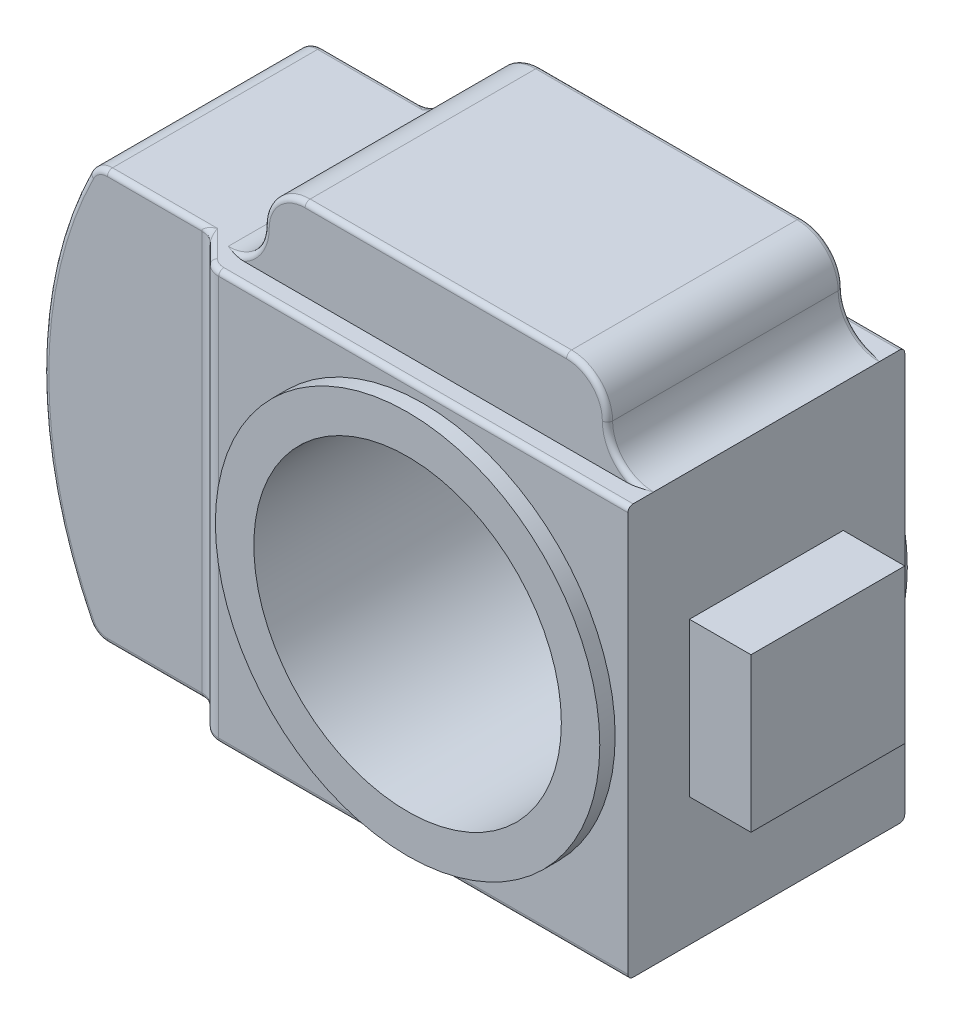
ISO-10303-21;
HEADER;
FILE_DESCRIPTION(('STEP AP214'),'2;1');
FILE_NAME('part.step','',(''),(''),'','','');
FILE_SCHEMA(('AUTOMOTIVE_DESIGN { 1 0 10303 214 1 1 1 1 }'));
ENDSEC;
DATA;
#1=APPLICATION_CONTEXT('core data for automotive mechanical design processes');
#2=APPLICATION_PROTOCOL_DEFINITION('international standard','automotive_design',2000,#1);
#3=PRODUCT_CONTEXT('',#1,'mechanical');
#4=PRODUCT('Part','Part','',(#3));
#5=PRODUCT_RELATED_PRODUCT_CATEGORY('part','',(#4));
#6=PRODUCT_DEFINITION_FORMATION('','',#4);
#7=PRODUCT_DEFINITION_CONTEXT('part definition',#1,'design');
#8=PRODUCT_DEFINITION('design','',#6,#7);
#9=PRODUCT_DEFINITION_SHAPE('','',#8);
#10=(LENGTH_UNIT() NAMED_UNIT(*) SI_UNIT(.MILLI.,.METRE.));
#11=(NAMED_UNIT(*) PLANE_ANGLE_UNIT() SI_UNIT($,.RADIAN.));
#12=(NAMED_UNIT(*) SI_UNIT($,.STERADIAN.) SOLID_ANGLE_UNIT());
#13=UNCERTAINTY_MEASURE_WITH_UNIT(LENGTH_MEASURE(1.E-05),#10,'distance_accuracy_value','');
#14=(GEOMETRIC_REPRESENTATION_CONTEXT(3) GLOBAL_UNCERTAINTY_ASSIGNED_CONTEXT((#13)) GLOBAL_UNIT_ASSIGNED_CONTEXT((#10,
#11,#12)) REPRESENTATION_CONTEXT('',''));
#15=CARTESIAN_POINT('',(0.,0.,0.));
#16=DIRECTION('',(0.,0.,1.));
#17=DIRECTION('',(1.,0.,0.));
#18=AXIS2_PLACEMENT_3D('',#15,#16,#17);
#19=CARTESIAN_POINT('',(-83.4861286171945,-40.,-21.));
#20=DIRECTION('',(0.,0.,1.));
#21=DIRECTION('',(1.,0.,0.));
#22=AXIS2_PLACEMENT_3D('',#19,#20,#21);
#23=PLANE('',#22);
#24=CARTESIAN_POINT('',(-47.5603197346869,36.,-21.));
#25=DIRECTION('',(0.,0.,1.));
#26=DIRECTION('',(1.,0.,0.));
#27=AXIS2_PLACEMENT_3D('',#24,#25,#26);
#28=CIRCLE('',#27,3.);
#29=CARTESIAN_POINT('',(-47.5603197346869,39.,-21.));
#30=VERTEX_POINT('',#29);
#31=CARTESIAN_POINT('',(-50.2477389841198,37.3333333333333,-21.));
#32=VERTEX_POINT('',#31);
#33=EDGE_CURVE('E905',#30,#32,#28,.T.);
#34=ORIENTED_EDGE('',*,*,#33,.F.);
#35=DIRECTION('',(1.,0.,0.));
#36=VECTOR('',#35,1.);
#37=CARTESIAN_POINT('',(-83.4861286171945,39.,-21.));
#38=LINE('',#37,#36);
#39=CARTESIAN_POINT('',(-29.1568542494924,39.,-21.));
#40=VERTEX_POINT('',#39);
#41=EDGE_CURVE('E479',#30,#40,#38,.T.);
#42=ORIENTED_EDGE('',*,*,#41,.T.);
#43=DIRECTION('',(0.,1.,0.));
#44=VECTOR('',#43,1.);
#45=CARTESIAN_POINT('',(-29.1568542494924,-39.,-21.));
#46=LINE('',#45,#44);
#47=CARTESIAN_POINT('',(-29.1568542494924,-39.,-21.));
#48=VERTEX_POINT('',#47);
#49=EDGE_CURVE('E944',#40,#48,#46,.F.);
#50=ORIENTED_EDGE('',*,*,#49,.T.);
#51=DIRECTION('',(1.,0.,0.));
#52=VECTOR('',#51,1.);
#53=CARTESIAN_POINT('',(-83.4861286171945,-39.,-21.));
#54=LINE('',#53,#52);
#55=CARTESIAN_POINT('',(-47.5603197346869,-39.,-21.));
#56=VERTEX_POINT('',#55);
#57=EDGE_CURVE('E473',#48,#56,#54,.F.);
#58=ORIENTED_EDGE('',*,*,#57,.T.);
#59=CARTESIAN_POINT('',(-47.5603197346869,-36.,-21.));
#60=DIRECTION('',(0.,0.,1.));
#61=DIRECTION('',(1.,0.,0.));
#62=AXIS2_PLACEMENT_3D('',#59,#60,#61);
#63=CIRCLE('',#62,3.);
#64=CARTESIAN_POINT('',(-50.2477389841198,-37.3333333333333,-21.));
#65=VERTEX_POINT('',#64);
#66=EDGE_CURVE('E946',#65,#56,#63,.T.);
#67=ORIENTED_EDGE('',*,*,#66,.F.);
#68=CARTESIAN_POINT('',(25.,0.,-21.));
#69=DIRECTION('',(0.,0.,1.));
#70=DIRECTION('',(1.,0.,0.));
#71=AXIS2_PLACEMENT_3D('',#68,#69,#70);
#72=CIRCLE('',#71,84.);
#73=EDGE_CURVE('E476',#65,#32,#72,.F.);
#74=ORIENTED_EDGE('',*,*,#73,.T.);
#75=EDGE_LOOP('',(#34,#42,#50,#58,#67,#74));
#76=FACE_BOUND('',#75,.T.);
#77=ADVANCED_FACE('F34',(#76),#23,.F.);
#78=CARTESIAN_POINT('',(-83.4861286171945,-40.,21.));
#79=DIRECTION('',(0.,0.,-1.));
#80=DIRECTION('',(-1.,0.,0.));
#81=AXIS2_PLACEMENT_3D('',#78,#79,#80);
#82=PLANE('',#81);
#83=CARTESIAN_POINT('',(-47.5603197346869,36.,21.));
#84=DIRECTION('',(0.,0.,-1.));
#85=DIRECTION('',(-1.,0.,0.));
#86=AXIS2_PLACEMENT_3D('',#83,#84,#85);
#87=CIRCLE('',#86,3.);
#88=CARTESIAN_POINT('',(-50.2477389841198,37.3333333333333,21.));
#89=VERTEX_POINT('',#88);
#90=CARTESIAN_POINT('',(-47.5603197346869,39.,21.));
#91=VERTEX_POINT('',#90);
#92=EDGE_CURVE('E933',#89,#91,#87,.T.);
#93=ORIENTED_EDGE('',*,*,#92,.F.);
#94=CARTESIAN_POINT('',(25.,0.,21.));
#95=DIRECTION('',(0.,0.,-1.));
#96=DIRECTION('',(-1.,0.,0.));
#97=AXIS2_PLACEMENT_3D('',#94,#95,#96);
#98=CIRCLE('',#97,84.);
#99=CARTESIAN_POINT('',(-50.2477389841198,-37.3333333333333,21.));
#100=VERTEX_POINT('',#99);
#101=EDGE_CURVE('E517',#89,#100,#98,.F.);
#102=ORIENTED_EDGE('',*,*,#101,.T.);
#103=CARTESIAN_POINT('',(-47.5603197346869,-36.,21.));
#104=DIRECTION('',(0.,0.,-1.));
#105=DIRECTION('',(-1.,0.,0.));
#106=AXIS2_PLACEMENT_3D('',#103,#104,#105);
#107=CIRCLE('',#106,3.);
#108=CARTESIAN_POINT('',(-47.5603197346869,-39.,21.));
#109=VERTEX_POINT('',#108);
#110=EDGE_CURVE('E896',#109,#100,#107,.T.);
#111=ORIENTED_EDGE('',*,*,#110,.F.);
#112=DIRECTION('',(-1.,0.,0.));
#113=VECTOR('',#112,1.);
#114=CARTESIAN_POINT('',(-83.4861286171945,-39.,21.));
#115=LINE('',#114,#113);
#116=CARTESIAN_POINT('',(-29.1568542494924,-39.,21.));
#117=VERTEX_POINT('',#116);
#118=EDGE_CURVE('E520',#109,#117,#115,.F.);
#119=ORIENTED_EDGE('',*,*,#118,.T.);
#120=DIRECTION('',(0.,1.,0.));
#121=VECTOR('',#120,1.);
#122=CARTESIAN_POINT('',(-29.1568542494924,39.,21.));
#123=LINE('',#122,#121);
#124=CARTESIAN_POINT('',(-29.1568542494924,39.,21.));
#125=VERTEX_POINT('',#124);
#126=EDGE_CURVE('E808',#117,#125,#123,.T.);
#127=ORIENTED_EDGE('',*,*,#126,.T.);
#128=DIRECTION('',(-1.,0.,0.));
#129=VECTOR('',#128,1.);
#130=CARTESIAN_POINT('',(-83.4861286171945,39.,21.));
#131=LINE('',#130,#129);
#132=EDGE_CURVE('E514',#125,#91,#131,.T.);
#133=ORIENTED_EDGE('',*,*,#132,.T.);
#134=EDGE_LOOP('',(#93,#102,#111,#119,#127,#133));
#135=FACE_BOUND('',#134,.T.);
#136=ADVANCED_FACE('F747',(#135),#82,.F.);
#137=CARTESIAN_POINT('',(-60.,-40.,30.));
#138=DIRECTION('',(0.,1.,0.));
#139=DIRECTION('',(0.,0.,1.));
#140=AXIS2_PLACEMENT_3D('',#137,#138,#139);
#141=PLANE('',#140);
#142=CARTESIAN_POINT('',(-19.8431457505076,-40.,23.));
#143=DIRECTION('',(0.,1.,0.));
#144=DIRECTION('',(0.,0.,1.));
#145=AXIS2_PLACEMENT_3D('',#142,#143,#144);
#146=CIRCLE('',#145,3.);
#147=CARTESIAN_POINT('',(-21.9644660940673,-40.,25.1213203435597));
#148=VERTEX_POINT('',#147);
#149=CARTESIAN_POINT('',(-19.8431457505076,-40.,26.));
#150=VERTEX_POINT('',#149);
#151=EDGE_CURVE('E803',#148,#150,#146,.T.);
#152=ORIENTED_EDGE('',*,*,#151,.F.);
#153=DIRECTION('',(-0.707106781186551,0.,-0.707106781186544));
#154=VECTOR('',#153,1.);
#155=CARTESIAN_POINT('',(-38.5428932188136,-40.,8.54289321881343));
#156=LINE('',#155,#154);
#157=CARTESIAN_POINT('',(-27.085786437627,-40.,20.));
#158=VERTEX_POINT('',#157);
#159=EDGE_CURVE('E491',#148,#158,#156,.T.);
#160=ORIENTED_EDGE('',*,*,#159,.T.);
#161=DIRECTION('',(-1.,0.,0.));
#162=VECTOR('',#161,1.);
#163=CARTESIAN_POINT('',(-60.,-40.,20.));
#164=LINE('',#163,#162);
#165=CARTESIAN_POINT('',(-47.5603197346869,-40.,20.));
#166=VERTEX_POINT('',#165);
#167=EDGE_CURVE('E488',#158,#166,#164,.T.);
#168=ORIENTED_EDGE('',*,*,#167,.T.);
#169=DIRECTION('',(0.,0.,1.));
#170=VECTOR('',#169,1.);
#171=CARTESIAN_POINT('',(-47.5603197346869,-40.,30.));
#172=LINE('',#171,#170);
#173=CARTESIAN_POINT('',(-47.5603197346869,-40.,-20.));
#174=VERTEX_POINT('',#173);
#175=EDGE_CURVE('E887',#166,#174,#172,.F.);
#176=ORIENTED_EDGE('',*,*,#175,.T.);
#177=DIRECTION('',(1.,0.,0.));
#178=VECTOR('',#177,1.);
#179=CARTESIAN_POINT('',(-60.,-40.,-20.));
#180=LINE('',#179,#178);
#181=CARTESIAN_POINT('',(-27.085786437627,-40.,-20.));
#182=VERTEX_POINT('',#181);
#183=EDGE_CURVE('E502',#174,#182,#180,.T.);
#184=ORIENTED_EDGE('',*,*,#183,.T.);
#185=DIRECTION('',(0.707106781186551,0.,-0.707106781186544));
#186=VECTOR('',#185,1.);
#187=CARTESIAN_POINT('',(-68.5428932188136,-40.,21.4571067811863));
#188=LINE('',#187,#186);
#189=CARTESIAN_POINT('',(-21.9644660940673,-40.,-25.1213203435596));
#190=VERTEX_POINT('',#189);
#191=EDGE_CURVE('E499',#182,#190,#188,.T.);
#192=ORIENTED_EDGE('',*,*,#191,.T.);
#193=CARTESIAN_POINT('',(-19.8431457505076,-40.,-23.));
#194=DIRECTION('',(0.,1.,0.));
#195=DIRECTION('',(0.,0.,1.));
#196=AXIS2_PLACEMENT_3D('',#193,#194,#195);
#197=CIRCLE('',#196,3.);
#198=CARTESIAN_POINT('',(-19.8431457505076,-40.,-26.));
#199=VERTEX_POINT('',#198);
#200=EDGE_CURVE('E809',#199,#190,#197,.T.);
#201=ORIENTED_EDGE('',*,*,#200,.F.);
#202=DIRECTION('',(-1.,0.,0.));
#203=VECTOR('',#202,1.);
#204=CARTESIAN_POINT('',(60.,-40.,-26.));
#205=LINE('',#204,#203);
#206=CARTESIAN_POINT('',(60.,-40.,-26.));
#207=VERTEX_POINT('',#206);
#208=EDGE_CURVE('E497',#199,#207,#205,.F.);
#209=ORIENTED_EDGE('',*,*,#208,.T.);
#210=DIRECTION('',(0.,0.,-1.));
#211=VECTOR('',#210,1.);
#212=CARTESIAN_POINT('',(60.,-40.,30.));
#213=LINE('',#212,#211);
#214=CARTESIAN_POINT('',(60.,-40.,26.));
#215=VERTEX_POINT('',#214);
#216=EDGE_CURVE('E369',#215,#207,#213,.T.);
#217=ORIENTED_EDGE('',*,*,#216,.F.);
#218=DIRECTION('',(1.,0.,0.));
#219=VECTOR('',#218,1.);
#220=CARTESIAN_POINT('',(-21.5,-40.,26.));
#221=LINE('',#220,#219);
#222=EDGE_CURVE('E494',#215,#150,#221,.F.);
#223=ORIENTED_EDGE('',*,*,#222,.T.);
#224=EDGE_LOOP('',(#152,#160,#168,#176,#184,#192,#201,#209,#217,#223));
#225=FACE_BOUND('',#224,.T.);
#226=ADVANCED_FACE('F753',(#225),#141,.F.);
#227=CARTESIAN_POINT('',(-60.,40.,30.));
#228=DIRECTION('',(0.,-1.,0.));
#229=DIRECTION('',(0.,0.,-1.));
#230=AXIS2_PLACEMENT_3D('',#227,#228,#229);
#231=PLANE('',#230);
#232=CARTESIAN_POINT('',(-19.8431457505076,40.,23.));
#233=DIRECTION('',(0.,-1.,0.));
#234=DIRECTION('',(0.,0.,-1.));
#235=AXIS2_PLACEMENT_3D('',#232,#233,#234);
#236=CIRCLE('',#235,3.);
#237=CARTESIAN_POINT('',(-19.8431457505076,40.,26.));
#238=VERTEX_POINT('',#237);
#239=CARTESIAN_POINT('',(-21.9644660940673,40.,25.1213203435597));
#240=VERTEX_POINT('',#239);
#241=EDGE_CURVE('E918',#238,#240,#236,.T.);
#242=ORIENTED_EDGE('',*,*,#241,.F.);
#243=DIRECTION('',(-1.,0.,0.));
#244=VECTOR('',#243,1.);
#245=CARTESIAN_POINT('',(60.,40.,26.));
#246=LINE('',#245,#244);
#247=CARTESIAN_POINT('',(60.,40.,26.));
#248=VERTEX_POINT('',#247);
#249=EDGE_CURVE('E456',#238,#248,#246,.F.);
#250=ORIENTED_EDGE('',*,*,#249,.T.);
#251=DIRECTION('',(0.,0.,-1.));
#252=VECTOR('',#251,1.);
#253=CARTESIAN_POINT('',(60.,40.,30.));
#254=LINE('',#253,#252);
#255=CARTESIAN_POINT('',(60.,40.,22.));
#256=VERTEX_POINT('',#255);
#257=EDGE_CURVE('E375',#248,#256,#254,.T.);
#258=ORIENTED_EDGE('',*,*,#257,.T.);
#259=CARTESIAN_POINT('',(55.8768943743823,40.,23.));
#260=CARTESIAN_POINT('',(55.9619751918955,40.,22.9999820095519));
#261=CARTESIAN_POINT('',(56.0470278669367,40.,22.9977221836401));
#262=CARTESIAN_POINT('',(56.216891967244,40.,22.9892488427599));
#263=CARTESIAN_POINT('',(56.3017035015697,40.,22.9830375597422));
#264=CARTESIAN_POINT('',(56.4707889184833,40.,22.9672095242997));
#265=CARTESIAN_POINT('',(56.5550636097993,40.,22.9576011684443));
#266=CARTESIAN_POINT('',(56.7232263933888,40.,22.9353940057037));
#267=CARTESIAN_POINT('',(56.8071144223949,40.,22.9227947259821));
#268=CARTESIAN_POINT('',(57.0568325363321,40.,22.8812911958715));
#269=CARTESIAN_POINT('',(57.2220275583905,40.,22.8485463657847));
#270=CARTESIAN_POINT('',(57.5507189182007,40.,22.7751309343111));
#271=CARTESIAN_POINT('',(57.7142139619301,40.,22.7344547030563));
#272=CARTESIAN_POINT('',(58.0550536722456,40.,22.6429396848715));
#273=CARTESIAN_POINT('',(58.2322359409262,40.,22.5915021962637));
#274=CARTESIAN_POINT('',(58.5850425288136,40.,22.4835137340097));
#275=CARTESIAN_POINT('',(58.7606666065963,40.,22.4269619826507));
#276=CARTESIAN_POINT('',(59.2863663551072,40.,22.2522326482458));
#277=CARTESIAN_POINT('',(59.6347802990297,40.,22.1291234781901));
#278=CARTESIAN_POINT('',(59.9887563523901,40.,22.0039752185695));
#279=CARTESIAN_POINT('',(59.9943781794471,40.,22.0019876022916));
#280=CARTESIAN_POINT('',(60.,40.,22.));
#281=B_SPLINE_CURVE_WITH_KNOTS('',3,(#259,#260,#261,#262,#263,#264,#265,#266,#267,#268,#269,
#270,#271,#272,#273,#274,#275,#276,#277,#278,#279,#280),.UNSPECIFIED.,.F.,.F.,(4,2,2,2,2,2,2,2,
2,2,4),(0.,0.255172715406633,0.510201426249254,0.764604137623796,1.01904709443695,
1.52398719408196,2.02928702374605,2.58266564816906,3.13612856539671,4.24458178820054,
4.26247033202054),.UNSPECIFIED.);
#282=CARTESIAN_POINT('',(55.8768943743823,40.,23.));
#283=VERTEX_POINT('',#282);
#284=EDGE_CURVE('E583',#256,#283,#281,.F.);
#285=ORIENTED_EDGE('',*,*,#284,.T.);
#286=DIRECTION('',(1.,0.,0.));
#287=VECTOR('',#286,1.);
#288=CARTESIAN_POINT('',(52.,40.,23.));
#289=LINE('',#288,#287);
#290=CARTESIAN_POINT('',(-18.8768943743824,40.,23.));
#291=VERTEX_POINT('',#290);
#292=EDGE_CURVE('E339',#291,#283,#289,.T.);
#293=ORIENTED_EDGE('',*,*,#292,.F.);
#294=CARTESIAN_POINT('',(-18.8768943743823,40.,23.));
#295=CARTESIAN_POINT('',(-18.9619751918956,40.,22.9999820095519));
#296=CARTESIAN_POINT('',(-19.0470278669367,40.,22.9977221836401));
#297=CARTESIAN_POINT('',(-19.216891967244,40.,22.9892488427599));
#298=CARTESIAN_POINT('',(-19.3017035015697,40.,22.9830375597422));
#299=CARTESIAN_POINT('',(-19.4707889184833,40.,22.9672095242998));
#300=CARTESIAN_POINT('',(-19.5550636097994,40.,22.9576011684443));
#301=CARTESIAN_POINT('',(-19.7232263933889,40.,22.9353940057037));
#302=CARTESIAN_POINT('',(-19.8071144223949,40.,22.9227947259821));
#303=CARTESIAN_POINT('',(-20.0568325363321,40.,22.8812911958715));
#304=CARTESIAN_POINT('',(-20.2220275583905,40.,22.8485463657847));
#305=CARTESIAN_POINT('',(-20.5507189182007,40.,22.7751309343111));
#306=CARTESIAN_POINT('',(-20.7142139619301,40.,22.7344547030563));
#307=CARTESIAN_POINT('',(-21.0550536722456,40.,22.6429396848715));
#308=CARTESIAN_POINT('',(-21.2322359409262,40.,22.5915021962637));
#309=CARTESIAN_POINT('',(-21.5850425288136,40.,22.4835137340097));
#310=CARTESIAN_POINT('',(-21.7606666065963,40.,22.4269619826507));
#311=CARTESIAN_POINT('',(-22.2863663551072,40.,22.2522326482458));
#312=CARTESIAN_POINT('',(-22.6347802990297,40.,22.1291234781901));
#313=CARTESIAN_POINT('',(-22.9887563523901,40.,22.0039752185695));
#314=CARTESIAN_POINT('',(-22.9943781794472,40.,22.0019876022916));
#315=CARTESIAN_POINT('',(-23.,40.,22.));
#316=B_SPLINE_CURVE_WITH_KNOTS('',3,(#294,#295,#296,#297,#298,#299,#300,#301,#302,#303,#304,
#305,#306,#307,#308,#309,#310,#311,#312,#313,#314,#315),.UNSPECIFIED.,.F.,.F.,(4,2,2,2,2,2,2,2,
2,2,4),(0.,0.255172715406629,0.510201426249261,0.76460413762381,1.01904709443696,
1.52398719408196,2.02928702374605,2.58266564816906,3.13612856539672,4.24458178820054,
4.26247033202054),.UNSPECIFIED.);
#317=CARTESIAN_POINT('',(-23.,40.,22.));
#318=VERTEX_POINT('',#317);
#319=EDGE_CURVE('E577',#291,#318,#316,.T.);
#320=ORIENTED_EDGE('',*,*,#319,.T.);
#321=DIRECTION('',(0.,0.,1.));
#322=VECTOR('',#321,1.);
#323=CARTESIAN_POINT('',(-23.,40.,-23.));
#324=LINE('',#323,#322);
#325=CARTESIAN_POINT('',(-23.,40.,-22.));
#326=VERTEX_POINT('',#325);
#327=EDGE_CURVE('E377',#318,#326,#324,.F.);
#328=ORIENTED_EDGE('',*,*,#327,.T.);
#329=CARTESIAN_POINT('',(-18.8768943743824,40.,-23.));
#330=CARTESIAN_POINT('',(-18.9619751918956,40.,-22.9999820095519));
#331=CARTESIAN_POINT('',(-19.0470278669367,40.,-22.9977221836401));
#332=CARTESIAN_POINT('',(-19.216891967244,40.,-22.9892488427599));
#333=CARTESIAN_POINT('',(-19.3017035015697,40.,-22.9830375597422));
#334=CARTESIAN_POINT('',(-19.4707889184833,40.,-22.9672095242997));
#335=CARTESIAN_POINT('',(-19.5550636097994,40.,-22.9576011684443));
#336=CARTESIAN_POINT('',(-19.7232263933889,40.,-22.9353940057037));
#337=CARTESIAN_POINT('',(-19.8071144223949,40.,-22.9227947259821));
#338=CARTESIAN_POINT('',(-20.0568325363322,40.,-22.8812911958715));
#339=CARTESIAN_POINT('',(-20.2220275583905,40.,-22.8485463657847));
#340=CARTESIAN_POINT('',(-20.5507189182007,40.,-22.7751309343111));
#341=CARTESIAN_POINT('',(-20.7142139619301,40.,-22.7344547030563));
#342=CARTESIAN_POINT('',(-21.0550536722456,40.,-22.6429396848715));
#343=CARTESIAN_POINT('',(-21.2322359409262,40.,-22.5915021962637));
#344=CARTESIAN_POINT('',(-21.5850425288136,40.,-22.4835137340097));
#345=CARTESIAN_POINT('',(-21.7606666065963,40.,-22.4269619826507));
#346=CARTESIAN_POINT('',(-22.2863663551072,40.,-22.2522326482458));
#347=CARTESIAN_POINT('',(-22.6347802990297,40.,-22.1291234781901));
#348=CARTESIAN_POINT('',(-22.9887563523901,40.,-22.0039752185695));
#349=CARTESIAN_POINT('',(-22.9943781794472,40.,-22.0019876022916));
#350=CARTESIAN_POINT('',(-23.,40.,-22.));
#351=B_SPLINE_CURVE_WITH_KNOTS('',3,(#329,#330,#331,#332,#333,#334,#335,#336,#337,#338,#339,
#340,#341,#342,#343,#344,#345,#346,#347,#348,#349,#350),.UNSPECIFIED.,.F.,.F.,(4,2,2,2,2,2,2,2,
2,2,4),(0.,0.255172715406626,0.510201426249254,0.764604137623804,1.01904709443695,
1.52398719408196,2.02928702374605,2.58266564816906,3.13612856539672,4.24458178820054,
4.26247033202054),.UNSPECIFIED.);
#352=CARTESIAN_POINT('',(-18.8768943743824,40.,-23.));
#353=VERTEX_POINT('',#352);
#354=EDGE_CURVE('E532',#326,#353,#351,.F.);
#355=ORIENTED_EDGE('',*,*,#354,.T.);
#356=DIRECTION('',(-1.,0.,0.));
#357=VECTOR('',#356,1.);
#358=CARTESIAN_POINT('',(52.,40.,-23.));
#359=LINE('',#358,#357);
#360=CARTESIAN_POINT('',(55.8768943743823,40.,-23.));
#361=VERTEX_POINT('',#360);
#362=EDGE_CURVE('E336',#361,#353,#359,.T.);
#363=ORIENTED_EDGE('',*,*,#362,.F.);
#364=CARTESIAN_POINT('',(55.8768943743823,40.,-23.));
#365=CARTESIAN_POINT('',(55.9619751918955,40.,-22.9999820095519));
#366=CARTESIAN_POINT('',(56.0470278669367,40.,-22.9977221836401));
#367=CARTESIAN_POINT('',(56.216891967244,40.,-22.9892488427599));
#368=CARTESIAN_POINT('',(56.3017035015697,40.,-22.9830375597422));
#369=CARTESIAN_POINT('',(56.4707889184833,40.,-22.9672095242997));
#370=CARTESIAN_POINT('',(56.5550636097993,40.,-22.9576011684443));
#371=CARTESIAN_POINT('',(56.7232263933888,40.,-22.9353940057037));
#372=CARTESIAN_POINT('',(56.8071144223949,40.,-22.9227947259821));
#373=CARTESIAN_POINT('',(57.0568325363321,40.,-22.8812911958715));
#374=CARTESIAN_POINT('',(57.2220275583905,40.,-22.8485463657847));
#375=CARTESIAN_POINT('',(57.5507189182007,40.,-22.7751309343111));
#376=CARTESIAN_POINT('',(57.7142139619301,40.,-22.7344547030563));
#377=CARTESIAN_POINT('',(58.0550536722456,40.,-22.6429396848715));
#378=CARTESIAN_POINT('',(58.2322359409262,40.,-22.5915021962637));
#379=CARTESIAN_POINT('',(58.5850425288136,40.,-22.4835137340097));
#380=CARTESIAN_POINT('',(58.7606666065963,40.,-22.4269619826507));
#381=CARTESIAN_POINT('',(59.2863663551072,40.,-22.2522326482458));
#382=CARTESIAN_POINT('',(59.6347802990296,40.,-22.1291234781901));
#383=CARTESIAN_POINT('',(59.9887563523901,40.,-22.0039752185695));
#384=CARTESIAN_POINT('',(59.9943781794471,40.,-22.0019876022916));
#385=CARTESIAN_POINT('',(60.,40.,-22.));
#386=B_SPLINE_CURVE_WITH_KNOTS('',3,(#364,#365,#366,#367,#368,#369,#370,#371,#372,#373,#374,
#375,#376,#377,#378,#379,#380,#381,#382,#383,#384,#385),.UNSPECIFIED.,.F.,.F.,(4,2,2,2,2,2,2,2,
2,2,4),(0.,0.255172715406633,0.510201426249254,0.76460413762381,1.01904709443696,
1.52398719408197,2.02928702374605,2.58266564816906,3.13612856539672,4.24458178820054,
4.26247033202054),.UNSPECIFIED.);
#387=CARTESIAN_POINT('',(60.,40.,-22.));
#388=VERTEX_POINT('',#387);
#389=EDGE_CURVE('E523',#361,#388,#386,.T.);
#390=ORIENTED_EDGE('',*,*,#389,.T.);
#391=CARTESIAN_POINT('',(60.,40.,-26.));
#392=VERTEX_POINT('',#391);
#393=EDGE_CURVE('E374',#388,#392,#254,.T.);
#394=ORIENTED_EDGE('',*,*,#393,.T.);
#395=DIRECTION('',(1.,0.,0.));
#396=VECTOR('',#395,1.);
#397=CARTESIAN_POINT('',(-21.5,40.,-26.));
#398=LINE('',#397,#396);
#399=CARTESIAN_POINT('',(-19.8431457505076,40.,-26.));
#400=VERTEX_POINT('',#399);
#401=EDGE_CURVE('E464',#392,#400,#398,.F.);
#402=ORIENTED_EDGE('',*,*,#401,.T.);
#403=CARTESIAN_POINT('',(-19.8431457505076,40.,-23.));
#404=DIRECTION('',(0.,-1.,0.));
#405=DIRECTION('',(0.,0.,-1.));
#406=AXIS2_PLACEMENT_3D('',#403,#404,#405);
#407=CIRCLE('',#406,3.);
#408=CARTESIAN_POINT('',(-21.9644660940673,40.,-25.1213203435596));
#409=VERTEX_POINT('',#408);
#410=EDGE_CURVE('E916',#409,#400,#407,.T.);
#411=ORIENTED_EDGE('',*,*,#410,.F.);
#412=DIRECTION('',(0.707106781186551,0.,-0.707106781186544));
#413=VECTOR('',#412,1.);
#414=CARTESIAN_POINT('',(-68.5428932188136,40.,21.4571067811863));
#415=LINE('',#414,#413);
#416=CARTESIAN_POINT('',(-27.085786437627,40.,-20.));
#417=VERTEX_POINT('',#416);
#418=EDGE_CURVE('E461',#409,#417,#415,.F.);
#419=ORIENTED_EDGE('',*,*,#418,.T.);
#420=DIRECTION('',(1.,0.,0.));
#421=VECTOR('',#420,1.);
#422=CARTESIAN_POINT('',(-60.,40.,-20.));
#423=LINE('',#422,#421);
#424=CARTESIAN_POINT('',(-47.5603197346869,40.,-20.));
#425=VERTEX_POINT('',#424);
#426=EDGE_CURVE('E458',#417,#425,#423,.F.);
#427=ORIENTED_EDGE('',*,*,#426,.T.);
#428=DIRECTION('',(0.,0.,1.));
#429=VECTOR('',#428,1.);
#430=CARTESIAN_POINT('',(-47.5603197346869,40.,30.));
#431=LINE('',#430,#429);
#432=CARTESIAN_POINT('',(-47.5603197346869,40.,20.));
#433=VERTEX_POINT('',#432);
#434=EDGE_CURVE('E590',#425,#433,#431,.T.);
#435=ORIENTED_EDGE('',*,*,#434,.T.);
#436=DIRECTION('',(-1.,0.,0.));
#437=VECTOR('',#436,1.);
#438=CARTESIAN_POINT('',(-60.,40.,20.));
#439=LINE('',#438,#437);
#440=CARTESIAN_POINT('',(-27.085786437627,40.,20.));
#441=VERTEX_POINT('',#440);
#442=EDGE_CURVE('E450',#433,#441,#439,.F.);
#443=ORIENTED_EDGE('',*,*,#442,.T.);
#444=DIRECTION('',(-0.707106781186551,0.,-0.707106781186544));
#445=VECTOR('',#444,1.);
#446=CARTESIAN_POINT('',(-38.5428932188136,40.,8.54289321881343));
#447=LINE('',#446,#445);
#448=EDGE_CURVE('E453',#441,#240,#447,.F.);
#449=ORIENTED_EDGE('',*,*,#448,.T.);
#450=EDGE_LOOP('',(#242,#250,#258,#285,#293,#320,#328,#355,#363,#390,#394,#402,#411,#419,#427,
#435,#443,#449));
#451=FACE_BOUND('',#450,.T.);
#452=ADVANCED_FACE('F539',(#451),#231,.F.);
#453=CARTESIAN_POINT('',(60.,-40.,30.));
#454=DIRECTION('',(-1.,0.,0.));
#455=DIRECTION('',(0.,0.,1.));
#456=AXIS2_PLACEMENT_3D('',#453,#454,#455);
#457=PLANE('',#456);
#458=DIRECTION('',(0.,-1.,0.));
#459=VECTOR('',#458,1.);
#460=CARTESIAN_POINT('',(60.,0.,-27.));
#461=LINE('',#460,#459);
#462=CARTESIAN_POINT('',(60.,39.,-27.));
#463=VERTEX_POINT('',#462);
#464=CARTESIAN_POINT('',(60.,-39.,-27.));
#465=VERTEX_POINT('',#464);
#466=EDGE_CURVE('E351',#463,#465,#461,.T.);
#467=ORIENTED_EDGE('',*,*,#466,.F.);
#468=CARTESIAN_POINT('',(60.,39.,-26.));
#469=DIRECTION('',(-1.,0.,0.));
#470=DIRECTION('',(0.,0.,1.));
#471=AXIS2_PLACEMENT_3D('',#468,#469,#470);
#472=CIRCLE('',#471,1.);
#473=EDGE_CURVE('E448',#463,#392,#472,.F.);
#474=ORIENTED_EDGE('',*,*,#473,.T.);
#475=ORIENTED_EDGE('',*,*,#393,.F.);
#476=EDGE_CURVE('E378',#256,#388,#254,.T.);
#477=ORIENTED_EDGE('',*,*,#476,.F.);
#478=ORIENTED_EDGE('',*,*,#257,.F.);
#479=CARTESIAN_POINT('',(60.,39.,26.));
#480=DIRECTION('',(-1.,0.,0.));
#481=DIRECTION('',(0.,0.,1.));
#482=AXIS2_PLACEMENT_3D('',#479,#480,#481);
#483=CIRCLE('',#482,1.);
#484=CARTESIAN_POINT('',(60.,39.,27.));
#485=VERTEX_POINT('',#484);
#486=EDGE_CURVE('E444',#248,#485,#483,.F.);
#487=ORIENTED_EDGE('',*,*,#486,.T.);
#488=DIRECTION('',(0.,1.,0.));
#489=VECTOR('',#488,1.);
#490=CARTESIAN_POINT('',(60.,40.,27.));
#491=LINE('',#490,#489);
#492=CARTESIAN_POINT('',(60.,-39.,27.));
#493=VERTEX_POINT('',#492);
#494=EDGE_CURVE('E360',#493,#485,#491,.T.);
#495=ORIENTED_EDGE('',*,*,#494,.F.);
#496=CARTESIAN_POINT('',(60.,-39.,26.));
#497=DIRECTION('',(-1.,0.,0.));
#498=DIRECTION('',(0.,0.,1.));
#499=AXIS2_PLACEMENT_3D('',#496,#497,#498);
#500=CIRCLE('',#499,1.);
#501=EDGE_CURVE('E442',#493,#215,#500,.F.);
#502=ORIENTED_EDGE('',*,*,#501,.T.);
#503=ORIENTED_EDGE('',*,*,#216,.T.);
#504=CARTESIAN_POINT('',(60.,-39.,-26.));
#505=DIRECTION('',(-1.,0.,0.));
#506=DIRECTION('',(0.,0.,1.));
#507=AXIS2_PLACEMENT_3D('',#504,#505,#506);
#508=CIRCLE('',#507,1.);
#509=EDGE_CURVE('E446',#207,#465,#508,.F.);
#510=ORIENTED_EDGE('',*,*,#509,.T.);
#511=EDGE_LOOP('',(#467,#474,#475,#477,#478,#487,#495,#502,#503,#510));
#512=FACE_BOUND('',#511,.T.);
#513=DIRECTION('',(0.,1.,0.));
#514=VECTOR('',#513,1.);
#515=CARTESIAN_POINT('',(60.,-15.,-15.));
#516=LINE('',#515,#514);
#517=CARTESIAN_POINT('',(60.,-15.,-15.));
#518=VERTEX_POINT('',#517);
#519=CARTESIAN_POINT('',(60.,15.,-15.));
#520=VERTEX_POINT('',#519);
#521=EDGE_CURVE('E335',#518,#520,#516,.T.);
#522=ORIENTED_EDGE('',*,*,#521,.F.);
#523=DIRECTION('',(0.,0.,-1.));
#524=VECTOR('',#523,1.);
#525=CARTESIAN_POINT('',(60.,-15.,15.));
#526=LINE('',#525,#524);
#527=CARTESIAN_POINT('',(60.,-15.,15.));
#528=VERTEX_POINT('',#527);
#529=EDGE_CURVE('E332',#528,#518,#526,.T.);
#530=ORIENTED_EDGE('',*,*,#529,.F.);
#531=DIRECTION('',(0.,-1.,0.));
#532=VECTOR('',#531,1.);
#533=CARTESIAN_POINT('',(60.,-15.,15.));
#534=LINE('',#533,#532);
#535=CARTESIAN_POINT('',(60.,15.,15.));
#536=VERTEX_POINT('',#535);
#537=EDGE_CURVE('E1544',#536,#528,#534,.T.);
#538=ORIENTED_EDGE('',*,*,#537,.F.);
#539=DIRECTION('',(0.,0.,1.));
#540=VECTOR('',#539,1.);
#541=CARTESIAN_POINT('',(60.,15.,15.));
#542=LINE('',#541,#540);
#543=EDGE_CURVE('E1546',#520,#536,#542,.T.);
#544=ORIENTED_EDGE('',*,*,#543,.F.);
#545=EDGE_LOOP('',(#522,#530,#538,#544));
#546=FACE_BOUND('',#545,.T.);
#547=ADVANCED_FACE('F785',(#512,#546),#457,.F.);
#548=CARTESIAN_POINT('',(0.,0.,27.));
#549=DIRECTION('',(0.,0.,1.));
#550=DIRECTION('',(1.,0.,0.));
#551=AXIS2_PLACEMENT_3D('',#548,#549,#550);
#552=PLANE('',#551);
#553=DIRECTION('',(-1.,0.,0.));
#554=VECTOR('',#553,1.);
#555=CARTESIAN_POINT('',(-21.5,39.,27.));
#556=LINE('',#555,#554);
#557=CARTESIAN_POINT('',(-19.8431457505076,39.,27.));
#558=VERTEX_POINT('',#557);
#559=EDGE_CURVE('E512',#485,#558,#556,.T.);
#560=ORIENTED_EDGE('',*,*,#559,.T.);
#561=DIRECTION('',(0.,1.,0.));
#562=VECTOR('',#561,1.);
#563=CARTESIAN_POINT('',(-19.8431457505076,-39.,27.));
#564=LINE('',#563,#562);
#565=CARTESIAN_POINT('',(-19.8431457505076,-39.,27.));
#566=VERTEX_POINT('',#565);
#567=EDGE_CURVE('E11',#558,#566,#564,.F.);
#568=ORIENTED_EDGE('',*,*,#567,.T.);
#569=DIRECTION('',(1.,0.,0.));
#570=VECTOR('',#569,1.);
#571=CARTESIAN_POINT('',(60.,-39.,27.));
#572=LINE('',#571,#570);
#573=EDGE_CURVE('E510',#566,#493,#572,.T.);
#574=ORIENTED_EDGE('',*,*,#573,.T.);
#575=ORIENTED_EDGE('',*,*,#494,.T.);
#576=EDGE_LOOP('',(#560,#568,#574,#575));
#577=FACE_BOUND('',#576,.T.);
#578=CARTESIAN_POINT('',(20.,0.,27.));
#579=DIRECTION('',(0.,0.,1.));
#580=DIRECTION('',(1.,0.,0.));
#581=AXIS2_PLACEMENT_3D('',#578,#579,#580);
#582=CIRCLE('',#581,37.5);
#583=CARTESIAN_POINT('',(57.5,0.,27.));
#584=VERTEX_POINT('',#583);
#585=EDGE_CURVE('E357',#584,#584,#582,.T.);
#586=ORIENTED_EDGE('',*,*,#585,.F.);
#587=EDGE_LOOP('',(#586));
#588=FACE_BOUND('',#587,.T.);
#589=ADVANCED_FACE('F777',(#577,#588),#552,.T.);
#590=CARTESIAN_POINT('',(0.,0.,-27.));
#591=DIRECTION('',(0.,0.,-1.));
#592=DIRECTION('',(-1.,0.,0.));
#593=AXIS2_PLACEMENT_3D('',#590,#591,#592);
#594=PLANE('',#593);
#595=DIRECTION('',(-1.,0.,0.));
#596=VECTOR('',#595,1.);
#597=CARTESIAN_POINT('',(-21.5,-39.,-27.));
#598=LINE('',#597,#596);
#599=CARTESIAN_POINT('',(-19.8431457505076,-39.,-27.));
#600=VERTEX_POINT('',#599);
#601=EDGE_CURVE('E437',#465,#600,#598,.T.);
#602=ORIENTED_EDGE('',*,*,#601,.T.);
#603=DIRECTION('',(0.,1.,0.));
#604=VECTOR('',#603,1.);
#605=CARTESIAN_POINT('',(-19.8431457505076,39.,-27.));
#606=LINE('',#605,#604);
#607=CARTESIAN_POINT('',(-19.8431457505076,39.,-27.));
#608=VERTEX_POINT('',#607);
#609=EDGE_CURVE('E827',#600,#608,#606,.T.);
#610=ORIENTED_EDGE('',*,*,#609,.T.);
#611=DIRECTION('',(1.,0.,0.));
#612=VECTOR('',#611,1.);
#613=CARTESIAN_POINT('',(60.,39.,-27.));
#614=LINE('',#613,#612);
#615=EDGE_CURVE('E440',#608,#463,#614,.T.);
#616=ORIENTED_EDGE('',*,*,#615,.T.);
#617=ORIENTED_EDGE('',*,*,#466,.T.);
#618=EDGE_LOOP('',(#602,#610,#616,#617));
#619=FACE_BOUND('',#618,.T.);
#620=CARTESIAN_POINT('',(20.,0.,-27.));
#621=DIRECTION('',(0.,0.,-1.));
#622=DIRECTION('',(-1.,0.,0.));
#623=AXIS2_PLACEMENT_3D('',#620,#621,#622);
#624=CIRCLE('',#623,37.5);
#625=CARTESIAN_POINT('',(-17.5,0.,-27.));
#626=VERTEX_POINT('',#625);
#627=EDGE_CURVE('E348',#626,#626,#624,.T.);
#628=ORIENTED_EDGE('',*,*,#627,.F.);
#629=EDGE_LOOP('',(#628));
#630=FACE_BOUND('',#629,.T.);
#631=ADVANCED_FACE('F773',(#619,#630),#594,.T.);
#632=CARTESIAN_POINT('',(0.,0.,-30.));
#633=DIRECTION('',(0.,0.,-1.));
#634=DIRECTION('',(-1.,0.,0.));
#635=AXIS2_PLACEMENT_3D('',#632,#633,#634);
#636=PLANE('',#635);
#637=CARTESIAN_POINT('',(20.,0.,-30.));
#638=DIRECTION('',(0.,0.,1.));
#639=DIRECTION('',(1.,0.,0.));
#640=AXIS2_PLACEMENT_3D('',#637,#638,#639);
#641=CIRCLE('',#640,30.);
#642=CARTESIAN_POINT('',(50.,0.,-30.));
#643=VERTEX_POINT('',#642);
#644=EDGE_CURVE('E366',#643,#643,#641,.T.);
#645=ORIENTED_EDGE('',*,*,#644,.T.);
#646=EDGE_LOOP('',(#645));
#647=FACE_BOUND('',#646,.T.);
#648=CARTESIAN_POINT('',(20.,0.,-30.));
#649=DIRECTION('',(0.,0.,-1.));
#650=DIRECTION('',(-1.,0.,0.));
#651=AXIS2_PLACEMENT_3D('',#648,#649,#650);
#652=CIRCLE('',#651,37.5);
#653=CARTESIAN_POINT('',(-17.5,0.,-30.));
#654=VERTEX_POINT('',#653);
#655=EDGE_CURVE('E347',#654,#654,#652,.T.);
#656=ORIENTED_EDGE('',*,*,#655,.T.);
#657=EDGE_LOOP('',(#656));
#658=FACE_BOUND('',#657,.T.);
#659=ADVANCED_FACE('F776',(#647,#658),#636,.T.);
#660=CARTESIAN_POINT('',(0.,0.,30.));
#661=DIRECTION('',(0.,0.,-1.));
#662=DIRECTION('',(-1.,0.,0.));
#663=AXIS2_PLACEMENT_3D('',#660,#661,#662);
#664=PLANE('',#663);
#665=CARTESIAN_POINT('',(20.,0.,30.));
#666=DIRECTION('',(0.,0.,1.));
#667=DIRECTION('',(1.,0.,0.));
#668=AXIS2_PLACEMENT_3D('',#665,#666,#667);
#669=CIRCLE('',#668,30.);
#670=CARTESIAN_POINT('',(50.,0.,30.));
#671=VERTEX_POINT('',#670);
#672=EDGE_CURVE('E365',#671,#671,#669,.T.);
#673=ORIENTED_EDGE('',*,*,#672,.F.);
#674=EDGE_LOOP('',(#673));
#675=FACE_BOUND('',#674,.T.);
#676=CARTESIAN_POINT('',(20.,0.,30.));
#677=DIRECTION('',(0.,0.,1.));
#678=DIRECTION('',(1.,0.,0.));
#679=AXIS2_PLACEMENT_3D('',#676,#677,#678);
#680=CIRCLE('',#679,37.5);
#681=CARTESIAN_POINT('',(57.5,0.,30.));
#682=VERTEX_POINT('',#681);
#683=EDGE_CURVE('E356',#682,#682,#680,.T.);
#684=ORIENTED_EDGE('',*,*,#683,.T.);
#685=EDGE_LOOP('',(#684));
#686=FACE_BOUND('',#685,.T.);
#687=ADVANCED_FACE('F789',(#675,#686),#664,.F.);
#688=CARTESIAN_POINT('',(20.,0.,-30.));
#689=DIRECTION('',(0.,0.,1.));
#690=DIRECTION('',(1.,0.,0.));
#691=AXIS2_PLACEMENT_3D('',#688,#689,#690);
#692=CYLINDRICAL_SURFACE('',#691,30.);
#693=ORIENTED_EDGE('',*,*,#644,.F.);
#694=EDGE_LOOP('',(#693));
#695=FACE_BOUND('',#694,.T.);
#696=ORIENTED_EDGE('',*,*,#672,.T.);
#697=EDGE_LOOP('',(#696));
#698=FACE_BOUND('',#697,.T.);
#699=ADVANCED_FACE('F781',(#695,#698),#692,.F.);
#700=CARTESIAN_POINT('',(20.,0.,27.));
#701=DIRECTION('',(0.,0.,1.));
#702=DIRECTION('',(1.,0.,0.));
#703=AXIS2_PLACEMENT_3D('',#700,#701,#702);
#704=CYLINDRICAL_SURFACE('',#703,37.5);
#705=ORIENTED_EDGE('',*,*,#585,.T.);
#706=EDGE_LOOP('',(#705));
#707=FACE_BOUND('',#706,.T.);
#708=ORIENTED_EDGE('',*,*,#683,.F.);
#709=EDGE_LOOP('',(#708));
#710=FACE_BOUND('',#709,.T.);
#711=ADVANCED_FACE('F771',(#707,#710),#704,.T.);
#712=CARTESIAN_POINT('',(20.,0.,-27.));
#713=DIRECTION('',(0.,0.,-1.));
#714=DIRECTION('',(-1.,0.,0.));
#715=AXIS2_PLACEMENT_3D('',#712,#713,#714);
#716=CYLINDRICAL_SURFACE('',#715,37.5);
#717=ORIENTED_EDGE('',*,*,#627,.T.);
#718=EDGE_LOOP('',(#717));
#719=FACE_BOUND('',#718,.T.);
#720=ORIENTED_EDGE('',*,*,#655,.F.);
#721=EDGE_LOOP('',(#720));
#722=FACE_BOUND('',#721,.T.);
#723=ADVANCED_FACE('F767',(#719,#722),#716,.T.);
#724=CARTESIAN_POINT('',(25.,0.,-30.));
#725=DIRECTION('',(0.,0.,1.));
#726=DIRECTION('',(1.,0.,0.));
#727=AXIS2_PLACEMENT_3D('',#724,#725,#726);
#728=CYLINDRICAL_SURFACE('',#727,85.);
#729=CARTESIAN_POINT('',(25.,0.,-20.));
#730=DIRECTION('',(0.,0.,1.));
#731=DIRECTION('',(1.,0.,0.));
#732=AXIS2_PLACEMENT_3D('',#729,#730,#731);
#733=CIRCLE('',#732,85.);
#734=CARTESIAN_POINT('',(-51.1435454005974,37.7777777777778,-20.));
#735=VERTEX_POINT('',#734);
#736=CARTESIAN_POINT('',(-51.1435454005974,-37.7777777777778,-20.));
#737=VERTEX_POINT('',#736);
#738=EDGE_CURVE('E485',#735,#737,#733,.T.);
#739=ORIENTED_EDGE('',*,*,#738,.T.);
#740=DIRECTION('',(0.,0.,1.));
#741=VECTOR('',#740,1.);
#742=CARTESIAN_POINT('',(-51.1435454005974,-37.7777777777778,-30.));
#743=LINE('',#742,#741);
#744=CARTESIAN_POINT('',(-51.1435454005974,-37.7777777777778,20.));
#745=VERTEX_POINT('',#744);
#746=EDGE_CURVE('E831',#737,#745,#743,.T.);
#747=ORIENTED_EDGE('',*,*,#746,.T.);
#748=CARTESIAN_POINT('',(25.,0.,20.));
#749=DIRECTION('',(0.,0.,-1.));
#750=DIRECTION('',(-1.,0.,0.));
#751=AXIS2_PLACEMENT_3D('',#748,#749,#750);
#752=CIRCLE('',#751,85.);
#753=CARTESIAN_POINT('',(-51.1435454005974,37.7777777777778,20.));
#754=VERTEX_POINT('',#753);
#755=EDGE_CURVE('E482',#745,#754,#752,.T.);
#756=ORIENTED_EDGE('',*,*,#755,.T.);
#757=DIRECTION('',(0.,0.,1.));
#758=VECTOR('',#757,1.);
#759=CARTESIAN_POINT('',(-51.1435454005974,37.7777777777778,-30.));
#760=LINE('',#759,#758);
#761=EDGE_CURVE('E829',#754,#735,#760,.F.);
#762=ORIENTED_EDGE('',*,*,#761,.T.);
#763=EDGE_LOOP('',(#739,#747,#756,#762));
#764=FACE_BOUND('',#763,.T.);
#765=ADVANCED_FACE('F763',(#764),#728,.T.);
#766=CARTESIAN_POINT('',(-27.5000000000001,-40.,21.));
#767=DIRECTION('',(0.707106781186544,0.,-0.707106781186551));
#768=DIRECTION('',(-0.707106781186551,0.,-0.707106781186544));
#769=AXIS2_PLACEMENT_3D('',#766,#767,#768);
#770=PLANE('',#769);
#771=DIRECTION('',(-0.707106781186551,0.,-0.707106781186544));
#772=VECTOR('',#771,1.);
#773=CARTESIAN_POINT('',(-27.5000000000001,-39.,21.));
#774=LINE('',#773,#772);
#775=CARTESIAN_POINT('',(-26.3284271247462,-39.,22.1715728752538));
#776=VERTEX_POINT('',#775);
#777=CARTESIAN_POINT('',(-22.6715728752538,-39.,25.8284271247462));
#778=VERTEX_POINT('',#777);
#779=EDGE_CURVE('E505',#776,#778,#774,.F.);
#780=ORIENTED_EDGE('',*,*,#779,.T.);
#781=DIRECTION('',(0.,1.,0.));
#782=VECTOR('',#781,1.);
#783=CARTESIAN_POINT('',(-22.6715728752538,39.,25.8284271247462));
#784=LINE('',#783,#782);
#785=CARTESIAN_POINT('',(-22.6715728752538,39.,25.8284271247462));
#786=VERTEX_POINT('',#785);
#787=EDGE_CURVE('E47',#778,#786,#784,.T.);
#788=ORIENTED_EDGE('',*,*,#787,.T.);
#789=DIRECTION('',(-0.707106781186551,0.,-0.707106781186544));
#790=VECTOR('',#789,1.);
#791=CARTESIAN_POINT('',(-27.5000000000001,39.,21.));
#792=LINE('',#791,#790);
#793=CARTESIAN_POINT('',(-26.3284271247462,39.,22.1715728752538));
#794=VERTEX_POINT('',#793);
#795=EDGE_CURVE('E507',#786,#794,#792,.T.);
#796=ORIENTED_EDGE('',*,*,#795,.T.);
#797=DIRECTION('',(0.,1.,0.));
#798=VECTOR('',#797,1.);
#799=CARTESIAN_POINT('',(-26.3284271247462,-39.,22.1715728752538));
#800=LINE('',#799,#798);
#801=EDGE_CURVE('E833',#794,#776,#800,.F.);
#802=ORIENTED_EDGE('',*,*,#801,.T.);
#803=EDGE_LOOP('',(#780,#788,#796,#802));
#804=FACE_BOUND('',#803,.T.);
#805=ADVANCED_FACE('F760',(#804),#770,.F.);
#806=CARTESIAN_POINT('',(-27.5000000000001,-40.,-21.));
#807=DIRECTION('',(0.707106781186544,0.,0.707106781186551));
#808=DIRECTION('',(0.707106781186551,0.,-0.707106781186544));
#809=AXIS2_PLACEMENT_3D('',#806,#807,#808);
#810=PLANE('',#809);
#811=DIRECTION('',(0.707106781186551,0.,-0.707106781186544));
#812=VECTOR('',#811,1.);
#813=CARTESIAN_POINT('',(-27.5000000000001,-39.,-21.));
#814=LINE('',#813,#812);
#815=CARTESIAN_POINT('',(-22.6715728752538,-39.,-25.8284271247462));
#816=VERTEX_POINT('',#815);
#817=CARTESIAN_POINT('',(-26.3284271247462,-39.,-22.1715728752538));
#818=VERTEX_POINT('',#817);
#819=EDGE_CURVE('E467',#816,#818,#814,.F.);
#820=ORIENTED_EDGE('',*,*,#819,.T.);
#821=DIRECTION('',(0.,1.,0.));
#822=VECTOR('',#821,1.);
#823=CARTESIAN_POINT('',(-26.3284271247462,39.,-22.1715728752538));
#824=LINE('',#823,#822);
#825=CARTESIAN_POINT('',(-26.3284271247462,39.,-22.1715728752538));
#826=VERTEX_POINT('',#825);
#827=EDGE_CURVE('E825',#818,#826,#824,.T.);
#828=ORIENTED_EDGE('',*,*,#827,.T.);
#829=DIRECTION('',(0.707106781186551,0.,-0.707106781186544));
#830=VECTOR('',#829,1.);
#831=CARTESIAN_POINT('',(-27.5000000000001,39.,-21.));
#832=LINE('',#831,#830);
#833=CARTESIAN_POINT('',(-22.6715728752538,39.,-25.8284271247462));
#834=VERTEX_POINT('',#833);
#835=EDGE_CURVE('E470',#826,#834,#832,.T.);
#836=ORIENTED_EDGE('',*,*,#835,.T.);
#837=DIRECTION('',(0.,1.,0.));
#838=VECTOR('',#837,1.);
#839=CARTESIAN_POINT('',(-22.6715728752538,-39.,-25.8284271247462));
#840=LINE('',#839,#838);
#841=EDGE_CURVE('E818',#834,#816,#840,.F.);
#842=ORIENTED_EDGE('',*,*,#841,.T.);
#843=EDGE_LOOP('',(#820,#828,#836,#842));
#844=FACE_BOUND('',#843,.T.);
#845=ADVANCED_FACE('F757',(#844),#810,.F.);
#846=CARTESIAN_POINT('',(52.,56.,-23.));
#847=DIRECTION('',(0.,0.,1.));
#848=DIRECTION('',(1.,0.,0.));
#849=AXIS2_PLACEMENT_3D('',#846,#847,#848);
#850=PLANE('',#849);
#851=CARTESIAN_POINT('',(44.,48.,-23.));
#852=DIRECTION('',(0.,0.,1.));
#853=DIRECTION('',(1.,0.,0.));
#854=AXIS2_PLACEMENT_3D('',#851,#852,#853);
#855=CIRCLE('',#854,7.);
#856=CARTESIAN_POINT('',(44.,55.,-23.));
#857=VERTEX_POINT('',#856);
#858=CARTESIAN_POINT('',(51.,48.,-23.));
#859=VERTEX_POINT('',#858);
#860=EDGE_CURVE('E400',#857,#859,#855,.F.);
#861=ORIENTED_EDGE('',*,*,#860,.T.);
#862=CARTESIAN_POINT('',(60.,48.,-23.));
#863=DIRECTION('',(0.,0.,1.));
#864=DIRECTION('',(1.,0.,0.));
#865=AXIS2_PLACEMENT_3D('',#862,#863,#864);
#866=CIRCLE('',#865,9.);
#867=EDGE_CURVE('E402',#859,#361,#866,.T.);
#868=ORIENTED_EDGE('',*,*,#867,.T.);
#869=ORIENTED_EDGE('',*,*,#362,.T.);
#870=CARTESIAN_POINT('',(-23.,48.,-23.));
#871=DIRECTION('',(0.,0.,1.));
#872=DIRECTION('',(1.,0.,0.));
#873=AXIS2_PLACEMENT_3D('',#870,#871,#872);
#874=CIRCLE('',#873,9.);
#875=CARTESIAN_POINT('',(-14.,48.,-23.));
#876=VERTEX_POINT('',#875);
#877=EDGE_CURVE('E398',#353,#876,#874,.T.);
#878=ORIENTED_EDGE('',*,*,#877,.T.);
#879=CARTESIAN_POINT('',(-7.00000000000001,48.,-23.));
#880=DIRECTION('',(0.,0.,1.));
#881=DIRECTION('',(1.,0.,0.));
#882=AXIS2_PLACEMENT_3D('',#879,#880,#881);
#883=CIRCLE('',#882,7.);
#884=CARTESIAN_POINT('',(-7.00000000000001,55.,-23.));
#885=VERTEX_POINT('',#884);
#886=EDGE_CURVE('E396',#876,#885,#883,.F.);
#887=ORIENTED_EDGE('',*,*,#886,.T.);
#888=DIRECTION('',(-1.,0.,0.));
#889=VECTOR('',#888,1.);
#890=CARTESIAN_POINT('',(52.,55.,-23.));
#891=LINE('',#890,#889);
#892=EDGE_CURVE('E387',#885,#857,#891,.F.);
#893=ORIENTED_EDGE('',*,*,#892,.T.);
#894=EDGE_LOOP('',(#861,#868,#869,#878,#887,#893));
#895=FACE_BOUND('',#894,.T.);
#896=ADVANCED_FACE('F1058',(#895),#850,.F.);
#897=CARTESIAN_POINT('',(52.,56.,23.));
#898=DIRECTION('',(0.,0.,-1.));
#899=DIRECTION('',(-1.,0.,0.));
#900=AXIS2_PLACEMENT_3D('',#897,#898,#899);
#901=PLANE('',#900);
#902=CARTESIAN_POINT('',(-7.00000000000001,48.,23.));
#903=DIRECTION('',(0.,0.,-1.));
#904=DIRECTION('',(-1.,0.,0.));
#905=AXIS2_PLACEMENT_3D('',#902,#903,#904);
#906=CIRCLE('',#905,7.);
#907=CARTESIAN_POINT('',(-7.00000000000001,55.,23.));
#908=VERTEX_POINT('',#907);
#909=CARTESIAN_POINT('',(-14.,48.,23.));
#910=VERTEX_POINT('',#909);
#911=EDGE_CURVE('E428',#908,#910,#906,.F.);
#912=ORIENTED_EDGE('',*,*,#911,.T.);
#913=CARTESIAN_POINT('',(-23.,48.,23.));
#914=DIRECTION('',(0.,0.,-1.));
#915=DIRECTION('',(-1.,0.,0.));
#916=AXIS2_PLACEMENT_3D('',#913,#914,#915);
#917=CIRCLE('',#916,9.);
#918=EDGE_CURVE('E430',#910,#291,#917,.T.);
#919=ORIENTED_EDGE('',*,*,#918,.T.);
#920=ORIENTED_EDGE('',*,*,#292,.T.);
#921=CARTESIAN_POINT('',(60.,48.,23.));
#922=DIRECTION('',(0.,0.,-1.));
#923=DIRECTION('',(-1.,0.,0.));
#924=AXIS2_PLACEMENT_3D('',#921,#922,#923);
#925=CIRCLE('',#924,9.);
#926=CARTESIAN_POINT('',(51.,48.,23.));
#927=VERTEX_POINT('',#926);
#928=EDGE_CURVE('E426',#283,#927,#925,.T.);
#929=ORIENTED_EDGE('',*,*,#928,.T.);
#930=CARTESIAN_POINT('',(44.,48.,23.));
#931=DIRECTION('',(0.,0.,-1.));
#932=DIRECTION('',(-1.,0.,0.));
#933=AXIS2_PLACEMENT_3D('',#930,#931,#932);
#934=CIRCLE('',#933,7.);
#935=CARTESIAN_POINT('',(44.,55.,23.));
#936=VERTEX_POINT('',#935);
#937=EDGE_CURVE('E424',#927,#936,#934,.F.);
#938=ORIENTED_EDGE('',*,*,#937,.T.);
#939=DIRECTION('',(1.,0.,0.));
#940=VECTOR('',#939,1.);
#941=CARTESIAN_POINT('',(52.,55.,23.));
#942=LINE('',#941,#940);
#943=EDGE_CURVE('E422',#936,#908,#942,.F.);
#944=ORIENTED_EDGE('',*,*,#943,.T.);
#945=EDGE_LOOP('',(#912,#919,#920,#929,#938,#944));
#946=FACE_BOUND('',#945,.T.);
#947=ADVANCED_FACE('F1075',(#946),#901,.F.);
#948=CARTESIAN_POINT('',(0.,56.,0.));
#949=DIRECTION('',(0.,-1.,0.));
#950=DIRECTION('',(0.,0.,-1.));
#951=AXIS2_PLACEMENT_3D('',#948,#949,#950);
#952=PLANE('',#951);
#953=DIRECTION('',(0.,0.,-1.));
#954=VECTOR('',#953,1.);
#955=CARTESIAN_POINT('',(44.,56.,0.));
#956=LINE('',#955,#954);
#957=CARTESIAN_POINT('',(44.,56.,22.));
#958=VERTEX_POINT('',#957);
#959=CARTESIAN_POINT('',(44.,56.,-22.));
#960=VERTEX_POINT('',#959);
#961=EDGE_CURVE('E384',#958,#960,#956,.T.);
#962=ORIENTED_EDGE('',*,*,#961,.T.);
#963=DIRECTION('',(-1.,0.,0.));
#964=VECTOR('',#963,1.);
#965=CARTESIAN_POINT('',(0.,56.,-22.));
#966=LINE('',#965,#964);
#967=CARTESIAN_POINT('',(-7.00000000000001,56.,-22.));
#968=VERTEX_POINT('',#967);
#969=EDGE_CURVE('E435',#960,#968,#966,.T.);
#970=ORIENTED_EDGE('',*,*,#969,.T.);
#971=DIRECTION('',(0.,0.,1.));
#972=VECTOR('',#971,1.);
#973=CARTESIAN_POINT('',(-7.00000000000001,56.,0.));
#974=LINE('',#973,#972);
#975=CARTESIAN_POINT('',(-7.00000000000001,56.,22.));
#976=VERTEX_POINT('',#975);
#977=EDGE_CURVE('E381',#968,#976,#974,.T.);
#978=ORIENTED_EDGE('',*,*,#977,.T.);
#979=DIRECTION('',(1.,0.,0.));
#980=VECTOR('',#979,1.);
#981=CARTESIAN_POINT('',(0.,56.,22.));
#982=LINE('',#981,#980);
#983=EDGE_CURVE('E433',#976,#958,#982,.T.);
#984=ORIENTED_EDGE('',*,*,#983,.T.);
#985=EDGE_LOOP('',(#962,#970,#978,#984));
#986=FACE_BOUND('',#985,.T.);
#987=ADVANCED_FACE('F1063',(#986),#952,.F.);
#988=CARTESIAN_POINT('',(72.,-15.,-15.));
#989=DIRECTION('',(0.,0.,1.));
#990=DIRECTION('',(1.,0.,0.));
#991=AXIS2_PLACEMENT_3D('',#988,#989,#990);
#992=PLANE('',#991);
#993=ORIENTED_EDGE('',*,*,#521,.T.);
#994=DIRECTION('',(-1.,0.,0.));
#995=VECTOR('',#994,1.);
#996=CARTESIAN_POINT('',(72.,15.,-15.));
#997=LINE('',#996,#995);
#998=CARTESIAN_POINT('',(72.,15.,-15.));
#999=VERTEX_POINT('',#998);
#1000=EDGE_CURVE('E316',#999,#520,#997,.T.);
#1001=ORIENTED_EDGE('',*,*,#1000,.F.);
#1002=DIRECTION('',(0.,1.,0.));
#1003=VECTOR('',#1002,1.);
#1004=CARTESIAN_POINT('',(72.,-15.,-15.));
#1005=LINE('',#1004,#1003);
#1006=CARTESIAN_POINT('',(72.,-15.,-15.));
#1007=VERTEX_POINT('',#1006);
#1008=EDGE_CURVE('E323',#1007,#999,#1005,.T.);
#1009=ORIENTED_EDGE('',*,*,#1008,.F.);
#1010=DIRECTION('',(-1.,0.,0.));
#1011=VECTOR('',#1010,1.);
#1012=CARTESIAN_POINT('',(72.,-15.,-15.));
#1013=LINE('',#1012,#1011);
#1014=EDGE_CURVE('E1549',#1007,#518,#1013,.T.);
#1015=ORIENTED_EDGE('',*,*,#1014,.T.);
#1016=EDGE_LOOP('',(#993,#1001,#1009,#1015));
#1017=FACE_BOUND('',#1016,.T.);
#1018=ADVANCED_FACE('F334',(#1017),#992,.F.);
#1019=CARTESIAN_POINT('',(72.,15.,15.));
#1020=DIRECTION('',(0.,-1.,0.));
#1021=DIRECTION('',(0.,0.,-1.));
#1022=AXIS2_PLACEMENT_3D('',#1019,#1020,#1021);
#1023=PLANE('',#1022);
#1024=ORIENTED_EDGE('',*,*,#543,.T.);
#1025=DIRECTION('',(-1.,0.,0.));
#1026=VECTOR('',#1025,1.);
#1027=CARTESIAN_POINT('',(72.,15.,15.));
#1028=LINE('',#1027,#1026);
#1029=CARTESIAN_POINT('',(72.,15.,15.));
#1030=VERTEX_POINT('',#1029);
#1031=EDGE_CURVE('E319',#1030,#536,#1028,.T.);
#1032=ORIENTED_EDGE('',*,*,#1031,.F.);
#1033=DIRECTION('',(0.,0.,1.));
#1034=VECTOR('',#1033,1.);
#1035=CARTESIAN_POINT('',(72.,15.,15.));
#1036=LINE('',#1035,#1034);
#1037=EDGE_CURVE('E311',#999,#1030,#1036,.T.);
#1038=ORIENTED_EDGE('',*,*,#1037,.F.);
#1039=ORIENTED_EDGE('',*,*,#1000,.T.);
#1040=EDGE_LOOP('',(#1024,#1032,#1038,#1039));
#1041=FACE_BOUND('',#1040,.T.);
#1042=ADVANCED_FACE('F314',(#1041),#1023,.F.);
#1043=CARTESIAN_POINT('',(72.,-15.,15.));
#1044=DIRECTION('',(0.,0.,-1.));
#1045=DIRECTION('',(-1.,0.,0.));
#1046=AXIS2_PLACEMENT_3D('',#1043,#1044,#1045);
#1047=PLANE('',#1046);
#1048=ORIENTED_EDGE('',*,*,#537,.T.);
#1049=DIRECTION('',(-1.,0.,0.));
#1050=VECTOR('',#1049,1.);
#1051=CARTESIAN_POINT('',(72.,-15.,15.));
#1052=LINE('',#1051,#1050);
#1053=CARTESIAN_POINT('',(72.,-15.,15.));
#1054=VERTEX_POINT('',#1053);
#1055=EDGE_CURVE('E341',#1054,#528,#1052,.T.);
#1056=ORIENTED_EDGE('',*,*,#1055,.F.);
#1057=DIRECTION('',(0.,-1.,0.));
#1058=VECTOR('',#1057,1.);
#1059=CARTESIAN_POINT('',(72.,-15.,15.));
#1060=LINE('',#1059,#1058);
#1061=EDGE_CURVE('E322',#1030,#1054,#1060,.T.);
#1062=ORIENTED_EDGE('',*,*,#1061,.F.);
#1063=ORIENTED_EDGE('',*,*,#1031,.T.);
#1064=EDGE_LOOP('',(#1048,#1056,#1062,#1063));
#1065=FACE_BOUND('',#1064,.T.);
#1066=ADVANCED_FACE('F1414',(#1065),#1047,.F.);
#1067=CARTESIAN_POINT('',(72.,-15.,15.));
#1068=DIRECTION('',(0.,1.,0.));
#1069=DIRECTION('',(0.,0.,1.));
#1070=AXIS2_PLACEMENT_3D('',#1067,#1068,#1069);
#1071=PLANE('',#1070);
#1072=ORIENTED_EDGE('',*,*,#529,.T.);
#1073=ORIENTED_EDGE('',*,*,#1014,.F.);
#1074=DIRECTION('',(0.,0.,-1.));
#1075=VECTOR('',#1074,1.);
#1076=CARTESIAN_POINT('',(72.,-15.,15.));
#1077=LINE('',#1076,#1075);
#1078=EDGE_CURVE('E328',#1054,#1007,#1077,.T.);
#1079=ORIENTED_EDGE('',*,*,#1078,.F.);
#1080=ORIENTED_EDGE('',*,*,#1055,.T.);
#1081=EDGE_LOOP('',(#1072,#1073,#1079,#1080));
#1082=FACE_BOUND('',#1081,.T.);
#1083=ADVANCED_FACE('F1405',(#1082),#1071,.F.);
#1084=CARTESIAN_POINT('',(72.,0.,0.));
#1085=DIRECTION('',(-1.,0.,0.));
#1086=DIRECTION('',(0.,0.,1.));
#1087=AXIS2_PLACEMENT_3D('',#1084,#1085,#1086);
#1088=PLANE('',#1087);
#1089=ORIENTED_EDGE('',*,*,#1008,.T.);
#1090=ORIENTED_EDGE('',*,*,#1037,.T.);
#1091=ORIENTED_EDGE('',*,*,#1061,.T.);
#1092=ORIENTED_EDGE('',*,*,#1078,.T.);
#1093=EDGE_LOOP('',(#1089,#1090,#1091,#1092));
#1094=FACE_BOUND('',#1093,.T.);
#1095=ADVANCED_FACE('F326',(#1094),#1088,.F.);
#1096=CARTESIAN_POINT('',(44.,48.,0.));
#1097=DIRECTION('',(0.,0.,-1.));
#1098=DIRECTION('',(-1.,0.,0.));
#1099=AXIS2_PLACEMENT_3D('',#1096,#1097,#1098);
#1100=CYLINDRICAL_SURFACE('',#1099,8.);
#1101=DIRECTION('',(0.,0.,-1.));
#1102=VECTOR('',#1101,1.);
#1103=CARTESIAN_POINT('',(52.,48.,-23.));
#1104=LINE('',#1103,#1102);
#1105=CARTESIAN_POINT('',(52.,48.,-22.));
#1106=VERTEX_POINT('',#1105);
#1107=CARTESIAN_POINT('',(52.,48.,22.));
#1108=VERTEX_POINT('',#1107);
#1109=EDGE_CURVE('E388',#1106,#1108,#1104,.F.);
#1110=ORIENTED_EDGE('',*,*,#1109,.F.);
#1111=CARTESIAN_POINT('',(44.,48.,-22.));
#1112=DIRECTION('',(0.,0.,1.));
#1113=DIRECTION('',(1.,0.,0.));
#1114=AXIS2_PLACEMENT_3D('',#1111,#1112,#1113);
#1115=CIRCLE('',#1114,8.);
#1116=EDGE_CURVE('E412',#1106,#960,#1115,.T.);
#1117=ORIENTED_EDGE('',*,*,#1116,.T.);
#1118=ORIENTED_EDGE('',*,*,#961,.F.);
#1119=CARTESIAN_POINT('',(44.,48.,22.));
#1120=DIRECTION('',(0.,0.,-1.));
#1121=DIRECTION('',(-1.,0.,0.));
#1122=AXIS2_PLACEMENT_3D('',#1119,#1120,#1121);
#1123=CIRCLE('',#1122,8.);
#1124=EDGE_CURVE('E410',#958,#1108,#1123,.T.);
#1125=ORIENTED_EDGE('',*,*,#1124,.T.);
#1126=EDGE_LOOP('',(#1110,#1117,#1118,#1125));
#1127=FACE_BOUND('',#1126,.T.);
#1128=ADVANCED_FACE('F1061',(#1127),#1100,.T.);
#1129=CARTESIAN_POINT('',(60.,48.,-23.));
#1130=DIRECTION('',(0.,0.,1.));
#1131=DIRECTION('',(1.,0.,0.));
#1132=AXIS2_PLACEMENT_3D('',#1129,#1130,#1131);
#1133=CYLINDRICAL_SURFACE('',#1132,8.);
#1134=ORIENTED_EDGE('',*,*,#476,.T.);
#1135=CARTESIAN_POINT('',(60.,48.,-22.));
#1136=DIRECTION('',(0.,0.,1.));
#1137=DIRECTION('',(1.,0.,0.));
#1138=AXIS2_PLACEMENT_3D('',#1135,#1136,#1137);
#1139=CIRCLE('',#1138,8.);
#1140=EDGE_CURVE('E408',#388,#1106,#1139,.F.);
#1141=ORIENTED_EDGE('',*,*,#1140,.T.);
#1142=ORIENTED_EDGE('',*,*,#1109,.T.);
#1143=CARTESIAN_POINT('',(60.,48.,22.));
#1144=DIRECTION('',(0.,0.,-1.));
#1145=DIRECTION('',(-1.,0.,0.));
#1146=AXIS2_PLACEMENT_3D('',#1143,#1144,#1145);
#1147=CIRCLE('',#1146,8.);
#1148=EDGE_CURVE('E405',#1108,#256,#1147,.F.);
#1149=ORIENTED_EDGE('',*,*,#1148,.T.);
#1150=EDGE_LOOP('',(#1134,#1141,#1142,#1149));
#1151=FACE_BOUND('',#1150,.T.);
#1152=ADVANCED_FACE('F1009',(#1151),#1133,.F.);
#1153=CARTESIAN_POINT('',(-7.00000000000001,48.,0.));
#1154=DIRECTION('',(0.,0.,1.));
#1155=DIRECTION('',(1.,0.,0.));
#1156=AXIS2_PLACEMENT_3D('',#1153,#1154,#1155);
#1157=CYLINDRICAL_SURFACE('',#1156,8.);
#1158=ORIENTED_EDGE('',*,*,#977,.F.);
#1159=CARTESIAN_POINT('',(-7.00000000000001,48.,-22.));
#1160=DIRECTION('',(0.,0.,1.));
#1161=DIRECTION('',(1.,0.,0.));
#1162=AXIS2_PLACEMENT_3D('',#1159,#1160,#1161);
#1163=CIRCLE('',#1162,8.);
#1164=CARTESIAN_POINT('',(-15.,48.,-22.));
#1165=VERTEX_POINT('',#1164);
#1166=EDGE_CURVE('E420',#968,#1165,#1163,.T.);
#1167=ORIENTED_EDGE('',*,*,#1166,.T.);
#1168=DIRECTION('',(0.,0.,1.));
#1169=VECTOR('',#1168,1.);
#1170=CARTESIAN_POINT('',(-15.,48.,-23.));
#1171=LINE('',#1170,#1169);
#1172=CARTESIAN_POINT('',(-15.,48.,22.));
#1173=VERTEX_POINT('',#1172);
#1174=EDGE_CURVE('E391',#1173,#1165,#1171,.F.);
#1175=ORIENTED_EDGE('',*,*,#1174,.F.);
#1176=CARTESIAN_POINT('',(-7.00000000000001,48.,22.));
#1177=DIRECTION('',(0.,0.,-1.));
#1178=DIRECTION('',(-1.,0.,0.));
#1179=AXIS2_PLACEMENT_3D('',#1176,#1177,#1178);
#1180=CIRCLE('',#1179,8.);
#1181=EDGE_CURVE('E418',#1173,#976,#1180,.T.);
#1182=ORIENTED_EDGE('',*,*,#1181,.T.);
#1183=EDGE_LOOP('',(#1158,#1167,#1175,#1182));
#1184=FACE_BOUND('',#1183,.T.);
#1185=ADVANCED_FACE('F551',(#1184),#1157,.T.);
#1186=CARTESIAN_POINT('',(-23.,48.,-23.));
#1187=DIRECTION('',(0.,0.,-1.));
#1188=DIRECTION('',(-1.,0.,0.));
#1189=AXIS2_PLACEMENT_3D('',#1186,#1187,#1188);
#1190=CYLINDRICAL_SURFACE('',#1189,8.);
#1191=ORIENTED_EDGE('',*,*,#1174,.T.);
#1192=CARTESIAN_POINT('',(-23.,48.,-22.));
#1193=DIRECTION('',(0.,0.,1.));
#1194=DIRECTION('',(1.,0.,0.));
#1195=AXIS2_PLACEMENT_3D('',#1192,#1193,#1194);
#1196=CIRCLE('',#1195,8.);
#1197=EDGE_CURVE('E416',#1165,#326,#1196,.F.);
#1198=ORIENTED_EDGE('',*,*,#1197,.T.);
#1199=ORIENTED_EDGE('',*,*,#327,.F.);
#1200=CARTESIAN_POINT('',(-23.,48.,22.));
#1201=DIRECTION('',(0.,0.,-1.));
#1202=DIRECTION('',(-1.,0.,0.));
#1203=AXIS2_PLACEMENT_3D('',#1200,#1201,#1202);
#1204=CIRCLE('',#1203,8.);
#1205=EDGE_CURVE('E414',#318,#1173,#1204,.F.);
#1206=ORIENTED_EDGE('',*,*,#1205,.T.);
#1207=EDGE_LOOP('',(#1191,#1198,#1199,#1206));
#1208=FACE_BOUND('',#1207,.T.);
#1209=ADVANCED_FACE('F567',(#1208),#1190,.F.);
#1210=CARTESIAN_POINT('',(-23.,48.,-22.));
#1211=DIRECTION('',(0.,0.,1.));
#1212=DIRECTION('',(1.,0.,0.));
#1213=AXIS2_PLACEMENT_3D('',#1210,#1211,#1212);
#1214=TOROIDAL_SURFACE('',#1213,9.,1.);
#1215=ORIENTED_EDGE('',*,*,#354,.F.);
#1216=ORIENTED_EDGE('',*,*,#1197,.F.);
#1217=CARTESIAN_POINT('',(-14.,48.,-22.));
#1218=DIRECTION('',(0.,1.,0.));
#1219=DIRECTION('',(0.,0.,1.));
#1220=AXIS2_PLACEMENT_3D('',#1217,#1218,#1219);
#1221=CIRCLE('',#1220,1.);
#1222=EDGE_CURVE('E394',#876,#1165,#1221,.T.);
#1223=ORIENTED_EDGE('',*,*,#1222,.F.);
#1224=ORIENTED_EDGE('',*,*,#877,.F.);
#1225=EDGE_LOOP('',(#1215,#1216,#1223,#1224));
#1226=FACE_BOUND('',#1225,.T.);
#1227=ADVANCED_FACE('F562',(#1226),#1214,.T.);
#1228=CARTESIAN_POINT('',(-7.00000000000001,48.,-22.));
#1229=DIRECTION('',(0.,0.,1.));
#1230=DIRECTION('',(1.,0.,0.));
#1231=AXIS2_PLACEMENT_3D('',#1228,#1229,#1230);
#1232=TOROIDAL_SURFACE('',#1231,7.,1.);
#1233=ORIENTED_EDGE('',*,*,#1222,.T.);
#1234=ORIENTED_EDGE('',*,*,#1166,.F.);
#1235=CARTESIAN_POINT('',(-7.00000000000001,55.,-22.));
#1236=DIRECTION('',(1.,0.,0.));
#1237=DIRECTION('',(0.,0.,-1.));
#1238=AXIS2_PLACEMENT_3D('',#1235,#1236,#1237);
#1239=CIRCLE('',#1238,1.);
#1240=EDGE_CURVE('E1022',#885,#968,#1239,.T.);
#1241=ORIENTED_EDGE('',*,*,#1240,.F.);
#1242=ORIENTED_EDGE('',*,*,#886,.F.);
#1243=EDGE_LOOP('',(#1233,#1234,#1241,#1242));
#1244=FACE_BOUND('',#1243,.T.);
#1245=ADVANCED_FACE('F559',(#1244),#1232,.T.);
#1246=CARTESIAN_POINT('',(0.,55.,-22.));
#1247=DIRECTION('',(-1.,0.,0.));
#1248=DIRECTION('',(0.,0.,1.));
#1249=AXIS2_PLACEMENT_3D('',#1246,#1247,#1248);
#1250=CYLINDRICAL_SURFACE('',#1249,1.);
#1251=ORIENTED_EDGE('',*,*,#1240,.T.);
#1252=ORIENTED_EDGE('',*,*,#969,.F.);
#1253=CARTESIAN_POINT('',(44.,55.,-22.));
#1254=DIRECTION('',(1.,0.,0.));
#1255=DIRECTION('',(0.,0.,-1.));
#1256=AXIS2_PLACEMENT_3D('',#1253,#1254,#1255);
#1257=CIRCLE('',#1256,1.);
#1258=EDGE_CURVE('E1019',#857,#960,#1257,.T.);
#1259=ORIENTED_EDGE('',*,*,#1258,.F.);
#1260=ORIENTED_EDGE('',*,*,#892,.F.);
#1261=EDGE_LOOP('',(#1251,#1252,#1259,#1260));
#1262=FACE_BOUND('',#1261,.T.);
#1263=ADVANCED_FACE('F555',(#1262),#1250,.T.);
#1264=CARTESIAN_POINT('',(44.,48.,-22.));
#1265=DIRECTION('',(0.,0.,1.));
#1266=DIRECTION('',(1.,0.,0.));
#1267=AXIS2_PLACEMENT_3D('',#1264,#1265,#1266);
#1268=TOROIDAL_SURFACE('',#1267,7.,1.);
#1269=ORIENTED_EDGE('',*,*,#1258,.T.);
#1270=ORIENTED_EDGE('',*,*,#1116,.F.);
#1271=CARTESIAN_POINT('',(51.,48.,-22.));
#1272=DIRECTION('',(0.,-1.,0.));
#1273=DIRECTION('',(0.,0.,-1.));
#1274=AXIS2_PLACEMENT_3D('',#1271,#1272,#1273);
#1275=CIRCLE('',#1274,1.);
#1276=EDGE_CURVE('E591',#859,#1106,#1275,.T.);
#1277=ORIENTED_EDGE('',*,*,#1276,.F.);
#1278=ORIENTED_EDGE('',*,*,#860,.F.);
#1279=EDGE_LOOP('',(#1269,#1270,#1277,#1278));
#1280=FACE_BOUND('',#1279,.T.);
#1281=ADVANCED_FACE('F549',(#1280),#1268,.T.);
#1282=CARTESIAN_POINT('',(60.,48.,-22.));
#1283=DIRECTION('',(0.,0.,1.));
#1284=DIRECTION('',(1.,0.,0.));
#1285=AXIS2_PLACEMENT_3D('',#1282,#1283,#1284);
#1286=TOROIDAL_SURFACE('',#1285,9.,1.);
#1287=ORIENTED_EDGE('',*,*,#1276,.T.);
#1288=ORIENTED_EDGE('',*,*,#1140,.F.);
#1289=ORIENTED_EDGE('',*,*,#389,.F.);
#1290=ORIENTED_EDGE('',*,*,#867,.F.);
#1291=EDGE_LOOP('',(#1287,#1288,#1289,#1290));
#1292=FACE_BOUND('',#1291,.T.);
#1293=ADVANCED_FACE('F543',(#1292),#1286,.T.);
#1294=CARTESIAN_POINT('',(60.,48.,22.));
#1295=DIRECTION('',(0.,0.,-1.));
#1296=DIRECTION('',(-1.,0.,0.));
#1297=AXIS2_PLACEMENT_3D('',#1294,#1295,#1296);
#1298=TOROIDAL_SURFACE('',#1297,9.,1.);
#1299=ORIENTED_EDGE('',*,*,#284,.F.);
#1300=ORIENTED_EDGE('',*,*,#1148,.F.);
#1301=CARTESIAN_POINT('',(51.,48.,22.));
#1302=DIRECTION('',(0.,1.,0.));
#1303=DIRECTION('',(0.,0.,1.));
#1304=AXIS2_PLACEMENT_3D('',#1301,#1302,#1303);
#1305=CIRCLE('',#1304,1.);
#1306=EDGE_CURVE('E1020',#927,#1108,#1305,.T.);
#1307=ORIENTED_EDGE('',*,*,#1306,.F.);
#1308=ORIENTED_EDGE('',*,*,#928,.F.);
#1309=EDGE_LOOP('',(#1299,#1300,#1307,#1308));
#1310=FACE_BOUND('',#1309,.T.);
#1311=ADVANCED_FACE('F548',(#1310),#1298,.T.);
#1312=CARTESIAN_POINT('',(44.,48.,22.));
#1313=DIRECTION('',(0.,0.,-1.));
#1314=DIRECTION('',(-1.,0.,0.));
#1315=AXIS2_PLACEMENT_3D('',#1312,#1313,#1314);
#1316=TOROIDAL_SURFACE('',#1315,7.,1.);
#1317=ORIENTED_EDGE('',*,*,#1306,.T.);
#1318=ORIENTED_EDGE('',*,*,#1124,.F.);
#1319=CARTESIAN_POINT('',(44.,55.,22.));
#1320=DIRECTION('',(-1.,0.,0.));
#1321=DIRECTION('',(0.,0.,1.));
#1322=AXIS2_PLACEMENT_3D('',#1319,#1320,#1321);
#1323=CIRCLE('',#1322,1.);
#1324=EDGE_CURVE('E1024',#936,#958,#1323,.T.);
#1325=ORIENTED_EDGE('',*,*,#1324,.F.);
#1326=ORIENTED_EDGE('',*,*,#937,.F.);
#1327=EDGE_LOOP('',(#1317,#1318,#1325,#1326));
#1328=FACE_BOUND('',#1327,.T.);
#1329=ADVANCED_FACE('F597',(#1328),#1316,.T.);
#1330=CARTESIAN_POINT('',(0.,55.,22.));
#1331=DIRECTION('',(1.,0.,0.));
#1332=DIRECTION('',(0.,0.,-1.));
#1333=AXIS2_PLACEMENT_3D('',#1330,#1331,#1332);
#1334=CYLINDRICAL_SURFACE('',#1333,1.);
#1335=ORIENTED_EDGE('',*,*,#1324,.T.);
#1336=ORIENTED_EDGE('',*,*,#983,.F.);
#1337=CARTESIAN_POINT('',(-7.00000000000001,55.,22.));
#1338=DIRECTION('',(-1.,0.,0.));
#1339=DIRECTION('',(0.,0.,1.));
#1340=AXIS2_PLACEMENT_3D('',#1337,#1338,#1339);
#1341=CIRCLE('',#1340,1.);
#1342=EDGE_CURVE('E1030',#908,#976,#1341,.T.);
#1343=ORIENTED_EDGE('',*,*,#1342,.F.);
#1344=ORIENTED_EDGE('',*,*,#943,.F.);
#1345=EDGE_LOOP('',(#1335,#1336,#1343,#1344));
#1346=FACE_BOUND('',#1345,.T.);
#1347=ADVANCED_FACE('F1067',(#1346),#1334,.T.);
#1348=CARTESIAN_POINT('',(-7.00000000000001,48.,22.));
#1349=DIRECTION('',(0.,0.,-1.));
#1350=DIRECTION('',(-1.,0.,0.));
#1351=AXIS2_PLACEMENT_3D('',#1348,#1349,#1350);
#1352=TOROIDAL_SURFACE('',#1351,7.,1.);
#1353=ORIENTED_EDGE('',*,*,#1342,.T.);
#1354=ORIENTED_EDGE('',*,*,#1181,.F.);
#1355=CARTESIAN_POINT('',(-14.,48.,22.));
#1356=DIRECTION('',(0.,-1.,0.));
#1357=DIRECTION('',(0.,0.,-1.));
#1358=AXIS2_PLACEMENT_3D('',#1355,#1356,#1357);
#1359=CIRCLE('',#1358,1.);
#1360=EDGE_CURVE('E841',#910,#1173,#1359,.T.);
#1361=ORIENTED_EDGE('',*,*,#1360,.F.);
#1362=ORIENTED_EDGE('',*,*,#911,.F.);
#1363=EDGE_LOOP('',(#1353,#1354,#1361,#1362));
#1364=FACE_BOUND('',#1363,.T.);
#1365=ADVANCED_FACE('F574',(#1364),#1352,.T.);
#1366=CARTESIAN_POINT('',(-23.,48.,22.));
#1367=DIRECTION('',(0.,0.,-1.));
#1368=DIRECTION('',(-1.,0.,0.));
#1369=AXIS2_PLACEMENT_3D('',#1366,#1367,#1368);
#1370=TOROIDAL_SURFACE('',#1369,9.,1.);
#1371=ORIENTED_EDGE('',*,*,#1360,.T.);
#1372=ORIENTED_EDGE('',*,*,#1205,.F.);
#1373=ORIENTED_EDGE('',*,*,#319,.F.);
#1374=ORIENTED_EDGE('',*,*,#918,.F.);
#1375=EDGE_LOOP('',(#1371,#1372,#1373,#1374));
#1376=FACE_BOUND('',#1375,.T.);
#1377=ADVANCED_FACE('F569',(#1376),#1370,.T.);
#1378=CARTESIAN_POINT('',(0.,-39.,-26.));
#1379=DIRECTION('',(1.,0.,0.));
#1380=DIRECTION('',(0.,0.,-1.));
#1381=AXIS2_PLACEMENT_3D('',#1378,#1379,#1380);
#1382=CYLINDRICAL_SURFACE('',#1381,1.);
#1383=ORIENTED_EDGE('',*,*,#208,.F.);
#1384=CARTESIAN_POINT('',(-19.8431457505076,-39.,-26.));
#1385=DIRECTION('',(1.,0.,0.));
#1386=DIRECTION('',(0.,0.,-1.));
#1387=AXIS2_PLACEMENT_3D('',#1384,#1385,#1386);
#1388=CIRCLE('',#1387,1.);
#1389=EDGE_CURVE('E861',#199,#600,#1388,.T.);
#1390=ORIENTED_EDGE('',*,*,#1389,.T.);
#1391=ORIENTED_EDGE('',*,*,#601,.F.);
#1392=ORIENTED_EDGE('',*,*,#509,.F.);
#1393=EDGE_LOOP('',(#1383,#1390,#1391,#1392));
#1394=FACE_BOUND('',#1393,.T.);
#1395=ADVANCED_FACE('F573',(#1394),#1382,.T.);
#1396=CARTESIAN_POINT('',(-68.5428932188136,-39.,21.4571067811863));
#1397=DIRECTION('',(0.707106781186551,0.,-0.707106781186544));
#1398=DIRECTION('',(-0.707106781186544,0.,-0.707106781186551));
#1399=AXIS2_PLACEMENT_3D('',#1396,#1397,#1398);
#1400=CYLINDRICAL_SURFACE('',#1399,1.);
#1401=ORIENTED_EDGE('',*,*,#819,.F.);
#1402=CARTESIAN_POINT('',(-21.9644660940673,-39.,-25.1213203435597));
#1403=DIRECTION('',(-0.707106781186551,0.,0.707106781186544));
#1404=DIRECTION('',(0.707106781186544,0.,0.707106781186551));
#1405=AXIS2_PLACEMENT_3D('',#1402,#1403,#1404);
#1406=CIRCLE('',#1405,1.);
#1407=EDGE_CURVE('E862',#816,#190,#1406,.T.);
#1408=ORIENTED_EDGE('',*,*,#1407,.T.);
#1409=ORIENTED_EDGE('',*,*,#191,.F.);
#1410=CARTESIAN_POINT('',(-27.085786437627,-39.,-20.));
#1411=DIRECTION('',(-0.944222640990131,0.,-0.329307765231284));
#1412=DIRECTION('',(-0.329307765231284,0.,0.944222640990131));
#1413=AXIS2_PLACEMENT_3D('',#1410,#1411,#1412);
#1414=ELLIPSE('',#1413,2.29985257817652,1.);
#1415=EDGE_CURVE('E866',#182,#818,#1414,.F.);
#1416=ORIENTED_EDGE('',*,*,#1415,.T.);
#1417=EDGE_LOOP('',(#1401,#1408,#1409,#1416));
#1418=FACE_BOUND('',#1417,.T.);
#1419=ADVANCED_FACE('F667',(#1418),#1400,.T.);
#1420=CARTESIAN_POINT('',(-60.,-39.,-20.));
#1421=DIRECTION('',(1.,0.,0.));
#1422=DIRECTION('',(0.,0.,-1.));
#1423=AXIS2_PLACEMENT_3D('',#1420,#1421,#1422);
#1424=CYLINDRICAL_SURFACE('',#1423,1.);
#1425=ORIENTED_EDGE('',*,*,#183,.F.);
#1426=CARTESIAN_POINT('',(-47.5603197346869,-39.,-20.));
#1427=DIRECTION('',(1.,0.,0.));
#1428=DIRECTION('',(0.,0.,-1.));
#1429=AXIS2_PLACEMENT_3D('',#1426,#1427,#1428);
#1430=CIRCLE('',#1429,1.);
#1431=EDGE_CURVE('E903',#174,#56,#1430,.T.);
#1432=ORIENTED_EDGE('',*,*,#1431,.T.);
#1433=ORIENTED_EDGE('',*,*,#57,.F.);
#1434=CARTESIAN_POINT('',(-27.085786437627,-39.,-20.));
#1435=DIRECTION('',(-0.434810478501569,0.,0.900521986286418));
#1436=DIRECTION('',(0.900521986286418,0.,0.434810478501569));
#1437=AXIS2_PLACEMENT_3D('',#1434,#1435,#1436);
#1438=ELLIPSE('',#1437,2.29985257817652,1.);
#1439=EDGE_CURVE('E899',#48,#182,#1438,.T.);
#1440=ORIENTED_EDGE('',*,*,#1439,.T.);
#1441=EDGE_LOOP('',(#1425,#1432,#1433,#1440));
#1442=FACE_BOUND('',#1441,.T.);
#1443=ADVANCED_FACE('F665',(#1442),#1424,.T.);
#1444=CARTESIAN_POINT('',(25.,0.,-20.));
#1445=DIRECTION('',(0.,0.,1.));
#1446=DIRECTION('',(1.,0.,0.));
#1447=AXIS2_PLACEMENT_3D('',#1444,#1445,#1446);
#1448=TOROIDAL_SURFACE('',#1447,84.,1.);
#1449=ORIENTED_EDGE('',*,*,#738,.F.);
#1450=CARTESIAN_POINT('',(-50.2477389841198,37.3333333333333,-20.));
#1451=DIRECTION('',(-0.444444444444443,-0.895806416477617,0.));
#1452=DIRECTION('',(0.895806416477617,-0.444444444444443,0.));
#1453=AXIS2_PLACEMENT_3D('',#1450,#1451,#1452);
#1454=CIRCLE('',#1453,1.);
#1455=EDGE_CURVE('E942',#735,#32,#1454,.T.);
#1456=ORIENTED_EDGE('',*,*,#1455,.T.);
#1457=ORIENTED_EDGE('',*,*,#73,.F.);
#1458=CARTESIAN_POINT('',(-50.2477389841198,-37.3333333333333,-20.));
#1459=DIRECTION('',(-0.444444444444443,0.895806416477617,0.));
#1460=DIRECTION('',(-0.895806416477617,-0.444444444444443,0.));
#1461=AXIS2_PLACEMENT_3D('',#1458,#1459,#1460);
#1462=CIRCLE('',#1461,1.);
#1463=EDGE_CURVE('E940',#65,#737,#1462,.T.);
#1464=ORIENTED_EDGE('',*,*,#1463,.T.);
#1465=EDGE_LOOP('',(#1449,#1456,#1457,#1464));
#1466=FACE_BOUND('',#1465,.T.);
#1467=ADVANCED_FACE('F610',(#1466),#1448,.T.);
#1468=CARTESIAN_POINT('',(-83.4861286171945,39.,-20.));
#1469=DIRECTION('',(1.,0.,0.));
#1470=DIRECTION('',(0.,0.,-1.));
#1471=AXIS2_PLACEMENT_3D('',#1468,#1469,#1470);
#1472=CYLINDRICAL_SURFACE('',#1471,1.);
#1473=ORIENTED_EDGE('',*,*,#426,.F.);
#1474=CARTESIAN_POINT('',(-27.085786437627,39.,-20.));
#1475=DIRECTION('',(-0.43481047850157,0.,0.900521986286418));
#1476=DIRECTION('',(-0.900521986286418,0.,-0.43481047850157));
#1477=AXIS2_PLACEMENT_3D('',#1474,#1475,#1476);
#1478=ELLIPSE('',#1477,2.29985257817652,1.);
#1479=EDGE_CURVE('E877',#417,#40,#1478,.T.);
#1480=ORIENTED_EDGE('',*,*,#1479,.T.);
#1481=ORIENTED_EDGE('',*,*,#41,.F.);
#1482=CARTESIAN_POINT('',(-47.5603197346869,39.,-20.));
#1483=DIRECTION('',(1.,0.,0.));
#1484=DIRECTION('',(0.,0.,-1.));
#1485=AXIS2_PLACEMENT_3D('',#1482,#1483,#1484);
#1486=CIRCLE('',#1485,1.);
#1487=EDGE_CURVE('E875',#30,#425,#1486,.T.);
#1488=ORIENTED_EDGE('',*,*,#1487,.T.);
#1489=EDGE_LOOP('',(#1473,#1480,#1481,#1488));
#1490=FACE_BOUND('',#1489,.T.);
#1491=ADVANCED_FACE('F608',(#1490),#1472,.T.);
#1492=CARTESIAN_POINT('',(-26.7928932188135,39.,-20.2928932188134));
#1493=DIRECTION('',(0.707106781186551,0.,-0.707106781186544));
#1494=DIRECTION('',(-0.707106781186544,0.,-0.707106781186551));
#1495=AXIS2_PLACEMENT_3D('',#1492,#1493,#1494);
#1496=CYLINDRICAL_SURFACE('',#1495,1.);
#1497=ORIENTED_EDGE('',*,*,#835,.F.);
#1498=CARTESIAN_POINT('',(-27.085786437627,39.,-20.));
#1499=DIRECTION('',(-0.944222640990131,0.,-0.329307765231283));
#1500=DIRECTION('',(0.329307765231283,0.,-0.944222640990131));
#1501=AXIS2_PLACEMENT_3D('',#1498,#1499,#1500);
#1502=ELLIPSE('',#1501,2.29985257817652,1.);
#1503=EDGE_CURVE('E868',#826,#417,#1502,.F.);
#1504=ORIENTED_EDGE('',*,*,#1503,.T.);
#1505=ORIENTED_EDGE('',*,*,#418,.F.);
#1506=CARTESIAN_POINT('',(-21.9644660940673,39.,-25.1213203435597));
#1507=DIRECTION('',(-0.707106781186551,0.,0.707106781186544));
#1508=DIRECTION('',(0.707106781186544,0.,0.707106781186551));
#1509=AXIS2_PLACEMENT_3D('',#1506,#1507,#1508);
#1510=CIRCLE('',#1509,1.);
#1511=EDGE_CURVE('E865',#409,#834,#1510,.T.);
#1512=ORIENTED_EDGE('',*,*,#1511,.T.);
#1513=EDGE_LOOP('',(#1497,#1504,#1505,#1512));
#1514=FACE_BOUND('',#1513,.T.);
#1515=ADVANCED_FACE('F603',(#1514),#1496,.T.);
#1516=CARTESIAN_POINT('',(0.,39.,-26.));
#1517=DIRECTION('',(-1.,0.,0.));
#1518=DIRECTION('',(0.,0.,1.));
#1519=AXIS2_PLACEMENT_3D('',#1516,#1517,#1518);
#1520=CYLINDRICAL_SURFACE('',#1519,1.);
#1521=ORIENTED_EDGE('',*,*,#615,.F.);
#1522=CARTESIAN_POINT('',(-19.8431457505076,39.,-26.));
#1523=DIRECTION('',(1.,0.,0.));
#1524=DIRECTION('',(0.,0.,-1.));
#1525=AXIS2_PLACEMENT_3D('',#1522,#1523,#1524);
#1526=CIRCLE('',#1525,1.);
#1527=EDGE_CURVE('E870',#608,#400,#1526,.T.);
#1528=ORIENTED_EDGE('',*,*,#1527,.T.);
#1529=ORIENTED_EDGE('',*,*,#401,.F.);
#1530=ORIENTED_EDGE('',*,*,#473,.F.);
#1531=EDGE_LOOP('',(#1521,#1528,#1529,#1530));
#1532=FACE_BOUND('',#1531,.T.);
#1533=ADVANCED_FACE('F599',(#1532),#1520,.T.);
#1534=CARTESIAN_POINT('',(0.,-39.,26.));
#1535=DIRECTION('',(-1.,0.,0.));
#1536=DIRECTION('',(0.,0.,1.));
#1537=AXIS2_PLACEMENT_3D('',#1534,#1535,#1536);
#1538=CYLINDRICAL_SURFACE('',#1537,1.);
#1539=ORIENTED_EDGE('',*,*,#573,.F.);
#1540=CARTESIAN_POINT('',(-19.8431457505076,-39.,26.));
#1541=DIRECTION('',(1.,0.,0.));
#1542=DIRECTION('',(0.,0.,-1.));
#1543=AXIS2_PLACEMENT_3D('',#1540,#1541,#1542);
#1544=CIRCLE('',#1543,1.);
#1545=EDGE_CURVE('E893',#566,#150,#1544,.T.);
#1546=ORIENTED_EDGE('',*,*,#1545,.T.);
#1547=ORIENTED_EDGE('',*,*,#222,.F.);
#1548=ORIENTED_EDGE('',*,*,#501,.F.);
#1549=EDGE_LOOP('',(#1539,#1546,#1547,#1548));
#1550=FACE_BOUND('',#1549,.T.);
#1551=ADVANCED_FACE('F602',(#1550),#1538,.T.);
#1552=CARTESIAN_POINT('',(-38.5428932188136,-39.,8.54289321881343));
#1553=DIRECTION('',(-0.707106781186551,0.,-0.707106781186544));
#1554=DIRECTION('',(-0.707106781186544,0.,0.707106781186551));
#1555=AXIS2_PLACEMENT_3D('',#1552,#1553,#1554);
#1556=CYLINDRICAL_SURFACE('',#1555,1.);
#1557=ORIENTED_EDGE('',*,*,#159,.F.);
#1558=CARTESIAN_POINT('',(-21.9644660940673,-39.,25.1213203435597));
#1559=DIRECTION('',(-0.707106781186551,0.,-0.707106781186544));
#1560=DIRECTION('',(-0.707106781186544,0.,0.707106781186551));
#1561=AXIS2_PLACEMENT_3D('',#1558,#1559,#1560);
#1562=CIRCLE('',#1561,1.);
#1563=EDGE_CURVE('E63',#148,#778,#1562,.T.);
#1564=ORIENTED_EDGE('',*,*,#1563,.T.);
#1565=ORIENTED_EDGE('',*,*,#779,.F.);
#1566=CARTESIAN_POINT('',(-27.085786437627,-39.,20.));
#1567=DIRECTION('',(0.944222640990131,0.,-0.329307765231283));
#1568=DIRECTION('',(0.329307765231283,0.,0.944222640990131));
#1569=AXIS2_PLACEMENT_3D('',#1566,#1567,#1568);
#1570=ELLIPSE('',#1569,2.29985257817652,1.);
#1571=EDGE_CURVE('E812',#776,#158,#1570,.T.);
#1572=ORIENTED_EDGE('',*,*,#1571,.T.);
#1573=EDGE_LOOP('',(#1557,#1564,#1565,#1572));
#1574=FACE_BOUND('',#1573,.T.);
#1575=ADVANCED_FACE('F693',(#1574),#1556,.T.);
#1576=CARTESIAN_POINT('',(-60.,-39.,20.));
#1577=DIRECTION('',(-1.,0.,0.));
#1578=DIRECTION('',(0.,0.,1.));
#1579=AXIS2_PLACEMENT_3D('',#1576,#1577,#1578);
#1580=CYLINDRICAL_SURFACE('',#1579,1.);
#1581=ORIENTED_EDGE('',*,*,#118,.F.);
#1582=CARTESIAN_POINT('',(-47.5603197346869,-39.,20.));
#1583=DIRECTION('',(1.,0.,0.));
#1584=DIRECTION('',(0.,0.,-1.));
#1585=AXIS2_PLACEMENT_3D('',#1582,#1583,#1584);
#1586=CIRCLE('',#1585,1.);
#1587=EDGE_CURVE('E820',#109,#166,#1586,.T.);
#1588=ORIENTED_EDGE('',*,*,#1587,.T.);
#1589=ORIENTED_EDGE('',*,*,#167,.F.);
#1590=CARTESIAN_POINT('',(-27.085786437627,-39.,20.));
#1591=DIRECTION('',(0.43481047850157,0.,0.900521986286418));
#1592=DIRECTION('',(-0.900521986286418,0.,0.43481047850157));
#1593=AXIS2_PLACEMENT_3D('',#1590,#1591,#1592);
#1594=ELLIPSE('',#1593,2.29985257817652,1.);
#1595=EDGE_CURVE('E880',#158,#117,#1594,.F.);
#1596=ORIENTED_EDGE('',*,*,#1595,.T.);
#1597=EDGE_LOOP('',(#1581,#1588,#1589,#1596));
#1598=FACE_BOUND('',#1597,.T.);
#1599=ADVANCED_FACE('F688',(#1598),#1580,.T.);
#1600=CARTESIAN_POINT('',(25.,0.,20.));
#1601=DIRECTION('',(0.,0.,-1.));
#1602=DIRECTION('',(-1.,0.,0.));
#1603=AXIS2_PLACEMENT_3D('',#1600,#1601,#1602);
#1604=TOROIDAL_SURFACE('',#1603,84.,1.);
#1605=ORIENTED_EDGE('',*,*,#755,.F.);
#1606=CARTESIAN_POINT('',(-50.2477389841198,-37.3333333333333,20.));
#1607=DIRECTION('',(-0.444444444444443,0.895806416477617,0.));
#1608=DIRECTION('',(-0.895806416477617,-0.444444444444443,0.));
#1609=AXIS2_PLACEMENT_3D('',#1606,#1607,#1608);
#1610=CIRCLE('',#1609,1.);
#1611=EDGE_CURVE('E895',#745,#100,#1610,.T.);
#1612=ORIENTED_EDGE('',*,*,#1611,.T.);
#1613=ORIENTED_EDGE('',*,*,#101,.F.);
#1614=CARTESIAN_POINT('',(-50.2477389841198,37.3333333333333,20.));
#1615=DIRECTION('',(-0.444444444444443,-0.895806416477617,0.));
#1616=DIRECTION('',(0.895806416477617,-0.444444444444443,0.));
#1617=AXIS2_PLACEMENT_3D('',#1614,#1615,#1616);
#1618=CIRCLE('',#1617,1.);
#1619=EDGE_CURVE('E900',#89,#754,#1618,.T.);
#1620=ORIENTED_EDGE('',*,*,#1619,.T.);
#1621=EDGE_LOOP('',(#1605,#1612,#1613,#1620));
#1622=FACE_BOUND('',#1621,.T.);
#1623=ADVANCED_FACE('F685',(#1622),#1604,.T.);
#1624=CARTESIAN_POINT('',(0.,39.,26.));
#1625=DIRECTION('',(1.,0.,0.));
#1626=DIRECTION('',(0.,0.,-1.));
#1627=AXIS2_PLACEMENT_3D('',#1624,#1625,#1626);
#1628=CYLINDRICAL_SURFACE('',#1627,1.);
#1629=ORIENTED_EDGE('',*,*,#249,.F.);
#1630=CARTESIAN_POINT('',(-19.8431457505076,39.,26.));
#1631=DIRECTION('',(1.,0.,0.));
#1632=DIRECTION('',(0.,0.,-1.));
#1633=AXIS2_PLACEMENT_3D('',#1630,#1631,#1632);
#1634=CIRCLE('',#1633,1.);
#1635=EDGE_CURVE('E55',#238,#558,#1634,.T.);
#1636=ORIENTED_EDGE('',*,*,#1635,.T.);
#1637=ORIENTED_EDGE('',*,*,#559,.F.);
#1638=ORIENTED_EDGE('',*,*,#486,.F.);
#1639=EDGE_LOOP('',(#1629,#1636,#1637,#1638));
#1640=FACE_BOUND('',#1639,.T.);
#1641=ADVANCED_FACE('F683',(#1640),#1628,.T.);
#1642=CARTESIAN_POINT('',(-83.4861286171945,39.,20.));
#1643=DIRECTION('',(-1.,0.,0.));
#1644=DIRECTION('',(0.,0.,1.));
#1645=AXIS2_PLACEMENT_3D('',#1642,#1643,#1644);
#1646=CYLINDRICAL_SURFACE('',#1645,1.);
#1647=ORIENTED_EDGE('',*,*,#442,.F.);
#1648=CARTESIAN_POINT('',(-47.5603197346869,39.,20.));
#1649=DIRECTION('',(1.,0.,0.));
#1650=DIRECTION('',(0.,0.,-1.));
#1651=AXIS2_PLACEMENT_3D('',#1648,#1649,#1650);
#1652=CIRCLE('',#1651,1.);
#1653=EDGE_CURVE('E938',#433,#91,#1652,.T.);
#1654=ORIENTED_EDGE('',*,*,#1653,.T.);
#1655=ORIENTED_EDGE('',*,*,#132,.F.);
#1656=CARTESIAN_POINT('',(-27.085786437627,39.,20.));
#1657=DIRECTION('',(0.43481047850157,0.,0.900521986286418));
#1658=DIRECTION('',(0.900521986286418,0.,-0.43481047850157));
#1659=AXIS2_PLACEMENT_3D('',#1656,#1657,#1658);
#1660=ELLIPSE('',#1659,2.29985257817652,1.);
#1661=EDGE_CURVE('E936',#125,#441,#1660,.F.);
#1662=ORIENTED_EDGE('',*,*,#1661,.T.);
#1663=EDGE_LOOP('',(#1647,#1654,#1655,#1662));
#1664=FACE_BOUND('',#1663,.T.);
#1665=ADVANCED_FACE('F678',(#1664),#1646,.T.);
#1666=CARTESIAN_POINT('',(-26.7928932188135,39.,20.2928932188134));
#1667=DIRECTION('',(-0.707106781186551,0.,-0.707106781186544));
#1668=DIRECTION('',(-0.707106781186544,0.,0.707106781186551));
#1669=AXIS2_PLACEMENT_3D('',#1666,#1667,#1668);
#1670=CYLINDRICAL_SURFACE('',#1669,1.);
#1671=ORIENTED_EDGE('',*,*,#795,.F.);
#1672=CARTESIAN_POINT('',(-21.9644660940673,39.,25.1213203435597));
#1673=DIRECTION('',(-0.707106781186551,0.,-0.707106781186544));
#1674=DIRECTION('',(-0.707106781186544,0.,0.707106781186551));
#1675=AXIS2_PLACEMENT_3D('',#1672,#1673,#1674);
#1676=CIRCLE('',#1675,1.);
#1677=EDGE_CURVE('E927',#786,#240,#1676,.T.);
#1678=ORIENTED_EDGE('',*,*,#1677,.T.);
#1679=ORIENTED_EDGE('',*,*,#448,.F.);
#1680=CARTESIAN_POINT('',(-27.085786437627,39.,20.));
#1681=DIRECTION('',(0.944222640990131,0.,-0.329307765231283));
#1682=DIRECTION('',(-0.329307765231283,0.,-0.944222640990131));
#1683=AXIS2_PLACEMENT_3D('',#1680,#1681,#1682);
#1684=ELLIPSE('',#1683,2.29985257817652,1.);
#1685=EDGE_CURVE('E921',#441,#794,#1684,.T.);
#1686=ORIENTED_EDGE('',*,*,#1685,.T.);
#1687=EDGE_LOOP('',(#1671,#1678,#1679,#1686));
#1688=FACE_BOUND('',#1687,.T.);
#1689=ADVANCED_FACE('F674',(#1688),#1670,.T.);
#1690=CARTESIAN_POINT('',(-19.8431457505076,-39.,23.));
#1691=DIRECTION('',(0.,1.,0.));
#1692=DIRECTION('',(0.,0.,1.));
#1693=AXIS2_PLACEMENT_3D('',#1690,#1691,#1692);
#1694=TOROIDAL_SURFACE('',#1693,3.,1.);
#1695=ORIENTED_EDGE('',*,*,#151,.T.);
#1696=ORIENTED_EDGE('',*,*,#1545,.F.);
#1697=CARTESIAN_POINT('',(-19.8431457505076,-39.,23.));
#1698=DIRECTION('',(0.,1.,0.));
#1699=DIRECTION('',(0.,0.,1.));
#1700=AXIS2_PLACEMENT_3D('',#1697,#1698,#1699);
#1701=CIRCLE('',#1700,4.);
#1702=EDGE_CURVE('E815',#778,#566,#1701,.T.);
#1703=ORIENTED_EDGE('',*,*,#1702,.F.);
#1704=ORIENTED_EDGE('',*,*,#1563,.F.);
#1705=EDGE_LOOP('',(#1695,#1696,#1703,#1704));
#1706=FACE_BOUND('',#1705,.T.);
#1707=ADVANCED_FACE('F677',(#1706),#1694,.T.);
#1708=CARTESIAN_POINT('',(-19.8431457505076,-40.,23.));
#1709=DIRECTION('',(0.,-1.,0.));
#1710=DIRECTION('',(0.,0.,-1.));
#1711=AXIS2_PLACEMENT_3D('',#1708,#1709,#1710);
#1712=CYLINDRICAL_SURFACE('',#1711,4.);
#1713=ORIENTED_EDGE('',*,*,#1702,.T.);
#1714=ORIENTED_EDGE('',*,*,#567,.F.);
#1715=CARTESIAN_POINT('',(-19.8431457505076,39.,23.));
#1716=DIRECTION('',(0.,-1.,0.));
#1717=DIRECTION('',(0.,0.,-1.));
#1718=AXIS2_PLACEMENT_3D('',#1715,#1716,#1717);
#1719=CIRCLE('',#1718,4.);
#1720=EDGE_CURVE('E836',#786,#558,#1719,.F.);
#1721=ORIENTED_EDGE('',*,*,#1720,.F.);
#1722=ORIENTED_EDGE('',*,*,#787,.F.);
#1723=EDGE_LOOP('',(#1713,#1714,#1721,#1722));
#1724=FACE_BOUND('',#1723,.T.);
#1725=ADVANCED_FACE('F705',(#1724),#1712,.T.);
#1726=CARTESIAN_POINT('',(-19.8431457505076,39.,23.));
#1727=DIRECTION('',(0.,-1.,0.));
#1728=DIRECTION('',(0.,0.,-1.));
#1729=AXIS2_PLACEMENT_3D('',#1726,#1727,#1728);
#1730=TOROIDAL_SURFACE('',#1729,3.,1.);
#1731=ORIENTED_EDGE('',*,*,#1635,.F.);
#1732=ORIENTED_EDGE('',*,*,#241,.T.);
#1733=ORIENTED_EDGE('',*,*,#1677,.F.);
#1734=ORIENTED_EDGE('',*,*,#1720,.T.);
#1735=EDGE_LOOP('',(#1731,#1732,#1733,#1734));
#1736=FACE_BOUND('',#1735,.T.);
#1737=ADVANCED_FACE('F701',(#1736),#1730,.T.);
#1738=CARTESIAN_POINT('',(-47.5603197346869,36.,-20.));
#1739=DIRECTION('',(0.,0.,1.));
#1740=DIRECTION('',(1.,0.,0.));
#1741=AXIS2_PLACEMENT_3D('',#1738,#1739,#1740);
#1742=TOROIDAL_SURFACE('',#1741,3.,1.);
#1743=ORIENTED_EDGE('',*,*,#33,.T.);
#1744=ORIENTED_EDGE('',*,*,#1455,.F.);
#1745=CARTESIAN_POINT('',(-47.5603197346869,36.,-20.));
#1746=DIRECTION('',(0.,0.,1.));
#1747=DIRECTION('',(1.,0.,0.));
#1748=AXIS2_PLACEMENT_3D('',#1745,#1746,#1747);
#1749=CIRCLE('',#1748,4.);
#1750=EDGE_CURVE('E839',#425,#735,#1749,.T.);
#1751=ORIENTED_EDGE('',*,*,#1750,.F.);
#1752=ORIENTED_EDGE('',*,*,#1487,.F.);
#1753=EDGE_LOOP('',(#1743,#1744,#1751,#1752));
#1754=FACE_BOUND('',#1753,.T.);
#1755=ADVANCED_FACE('F704',(#1754),#1742,.T.);
#1756=CARTESIAN_POINT('',(-47.5603197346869,36.,-30.));
#1757=DIRECTION('',(0.,0.,1.));
#1758=DIRECTION('',(1.,0.,0.));
#1759=AXIS2_PLACEMENT_3D('',#1756,#1757,#1758);
#1760=CYLINDRICAL_SURFACE('',#1759,4.);
#1761=ORIENTED_EDGE('',*,*,#1750,.T.);
#1762=ORIENTED_EDGE('',*,*,#761,.F.);
#1763=CARTESIAN_POINT('',(-47.5603197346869,36.,20.));
#1764=DIRECTION('',(0.,0.,-1.));
#1765=DIRECTION('',(-1.,0.,0.));
#1766=AXIS2_PLACEMENT_3D('',#1763,#1764,#1765);
#1767=CIRCLE('',#1766,4.);
#1768=EDGE_CURVE('E842',#433,#754,#1767,.F.);
#1769=ORIENTED_EDGE('',*,*,#1768,.F.);
#1770=ORIENTED_EDGE('',*,*,#434,.F.);
#1771=EDGE_LOOP('',(#1761,#1762,#1769,#1770));
#1772=FACE_BOUND('',#1771,.T.);
#1773=ADVANCED_FACE('F717',(#1772),#1760,.T.);
#1774=CARTESIAN_POINT('',(-47.5603197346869,36.,20.));
#1775=DIRECTION('',(0.,0.,-1.));
#1776=DIRECTION('',(-1.,0.,0.));
#1777=AXIS2_PLACEMENT_3D('',#1774,#1775,#1776);
#1778=TOROIDAL_SURFACE('',#1777,3.,1.);
#1779=ORIENTED_EDGE('',*,*,#1619,.F.);
#1780=ORIENTED_EDGE('',*,*,#92,.T.);
#1781=ORIENTED_EDGE('',*,*,#1653,.F.);
#1782=ORIENTED_EDGE('',*,*,#1768,.T.);
#1783=EDGE_LOOP('',(#1779,#1780,#1781,#1782));
#1784=FACE_BOUND('',#1783,.T.);
#1785=ADVANCED_FACE('F713',(#1784),#1778,.T.);
#1786=CARTESIAN_POINT('',(-47.5603197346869,-36.,-20.));
#1787=DIRECTION('',(0.,0.,1.));
#1788=DIRECTION('',(1.,0.,0.));
#1789=AXIS2_PLACEMENT_3D('',#1786,#1787,#1788);
#1790=TOROIDAL_SURFACE('',#1789,3.,1.);
#1791=ORIENTED_EDGE('',*,*,#66,.T.);
#1792=ORIENTED_EDGE('',*,*,#1431,.F.);
#1793=CARTESIAN_POINT('',(-47.5603197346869,-36.,-20.));
#1794=DIRECTION('',(0.,0.,1.));
#1795=DIRECTION('',(1.,0.,0.));
#1796=AXIS2_PLACEMENT_3D('',#1793,#1794,#1795);
#1797=CIRCLE('',#1796,4.);
#1798=EDGE_CURVE('E845',#737,#174,#1797,.T.);
#1799=ORIENTED_EDGE('',*,*,#1798,.F.);
#1800=ORIENTED_EDGE('',*,*,#1463,.F.);
#1801=EDGE_LOOP('',(#1791,#1792,#1799,#1800));
#1802=FACE_BOUND('',#1801,.T.);
#1803=ADVANCED_FACE('F716',(#1802),#1790,.T.);
#1804=CARTESIAN_POINT('',(-47.5603197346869,-36.,-30.));
#1805=DIRECTION('',(0.,0.,1.));
#1806=DIRECTION('',(1.,0.,0.));
#1807=AXIS2_PLACEMENT_3D('',#1804,#1805,#1806);
#1808=CYLINDRICAL_SURFACE('',#1807,4.);
#1809=ORIENTED_EDGE('',*,*,#1798,.T.);
#1810=ORIENTED_EDGE('',*,*,#175,.F.);
#1811=CARTESIAN_POINT('',(-47.5603197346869,-36.,20.));
#1812=DIRECTION('',(0.,0.,-1.));
#1813=DIRECTION('',(-1.,0.,0.));
#1814=AXIS2_PLACEMENT_3D('',#1811,#1812,#1813);
#1815=CIRCLE('',#1814,4.);
#1816=EDGE_CURVE('E848',#745,#166,#1815,.F.);
#1817=ORIENTED_EDGE('',*,*,#1816,.F.);
#1818=ORIENTED_EDGE('',*,*,#746,.F.);
#1819=EDGE_LOOP('',(#1809,#1810,#1817,#1818));
#1820=FACE_BOUND('',#1819,.T.);
#1821=ADVANCED_FACE('F728',(#1820),#1808,.T.);
#1822=CARTESIAN_POINT('',(-47.5603197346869,-36.,20.));
#1823=DIRECTION('',(0.,0.,-1.));
#1824=DIRECTION('',(-1.,0.,0.));
#1825=AXIS2_PLACEMENT_3D('',#1822,#1823,#1824);
#1826=TOROIDAL_SURFACE('',#1825,3.,1.);
#1827=ORIENTED_EDGE('',*,*,#1587,.F.);
#1828=ORIENTED_EDGE('',*,*,#110,.T.);
#1829=ORIENTED_EDGE('',*,*,#1611,.F.);
#1830=ORIENTED_EDGE('',*,*,#1816,.T.);
#1831=EDGE_LOOP('',(#1827,#1828,#1829,#1830));
#1832=FACE_BOUND('',#1831,.T.);
#1833=ADVANCED_FACE('F725',(#1832),#1826,.T.);
#1834=CARTESIAN_POINT('',(-19.8431457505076,-39.,-23.));
#1835=DIRECTION('',(0.,1.,0.));
#1836=DIRECTION('',(0.,0.,1.));
#1837=AXIS2_PLACEMENT_3D('',#1834,#1835,#1836);
#1838=TOROIDAL_SURFACE('',#1837,3.,1.);
#1839=ORIENTED_EDGE('',*,*,#200,.T.);
#1840=ORIENTED_EDGE('',*,*,#1407,.F.);
#1841=CARTESIAN_POINT('',(-19.8431457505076,-39.,-23.));
#1842=DIRECTION('',(0.,1.,0.));
#1843=DIRECTION('',(0.,0.,1.));
#1844=AXIS2_PLACEMENT_3D('',#1841,#1842,#1843);
#1845=CIRCLE('',#1844,4.);
#1846=EDGE_CURVE('E654',#600,#816,#1845,.T.);
#1847=ORIENTED_EDGE('',*,*,#1846,.F.);
#1848=ORIENTED_EDGE('',*,*,#1389,.F.);
#1849=EDGE_LOOP('',(#1839,#1840,#1847,#1848));
#1850=FACE_BOUND('',#1849,.T.);
#1851=ADVANCED_FACE('F663',(#1850),#1838,.T.);
#1852=CARTESIAN_POINT('',(-19.8431457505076,0.,-23.));
#1853=DIRECTION('',(0.,-1.,0.));
#1854=DIRECTION('',(0.,0.,-1.));
#1855=AXIS2_PLACEMENT_3D('',#1852,#1853,#1854);
#1856=CYLINDRICAL_SURFACE('',#1855,4.);
#1857=ORIENTED_EDGE('',*,*,#1846,.T.);
#1858=ORIENTED_EDGE('',*,*,#841,.F.);
#1859=CARTESIAN_POINT('',(-19.8431457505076,39.,-23.));
#1860=DIRECTION('',(0.,-1.,0.));
#1861=DIRECTION('',(0.,0.,-1.));
#1862=AXIS2_PLACEMENT_3D('',#1859,#1860,#1861);
#1863=CIRCLE('',#1862,4.);
#1864=EDGE_CURVE('E652',#608,#834,#1863,.F.);
#1865=ORIENTED_EDGE('',*,*,#1864,.F.);
#1866=ORIENTED_EDGE('',*,*,#609,.F.);
#1867=EDGE_LOOP('',(#1857,#1858,#1865,#1866));
#1868=FACE_BOUND('',#1867,.T.);
#1869=ADVANCED_FACE('F737',(#1868),#1856,.T.);
#1870=CARTESIAN_POINT('',(-19.8431457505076,39.,-23.));
#1871=DIRECTION('',(0.,-1.,0.));
#1872=DIRECTION('',(0.,0.,-1.));
#1873=AXIS2_PLACEMENT_3D('',#1870,#1871,#1872);
#1874=TOROIDAL_SURFACE('',#1873,3.,1.);
#1875=ORIENTED_EDGE('',*,*,#1511,.F.);
#1876=ORIENTED_EDGE('',*,*,#410,.T.);
#1877=ORIENTED_EDGE('',*,*,#1527,.F.);
#1878=ORIENTED_EDGE('',*,*,#1864,.T.);
#1879=EDGE_LOOP('',(#1875,#1876,#1877,#1878));
#1880=FACE_BOUND('',#1879,.T.);
#1881=ADVANCED_FACE('F621',(#1880),#1874,.T.);
#1882=CARTESIAN_POINT('',(-27.085786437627,38.,-20.));
#1883=CARTESIAN_POINT('',(-27.085786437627,38.,-20.));
#1884=CARTESIAN_POINT('',(-27.085786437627,38.,-20.));
#1885=CARTESIAN_POINT('',(-27.0527554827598,37.9999922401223,-20.0947095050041));
#1886=CARTESIAN_POINT('',(-27.1144582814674,37.999809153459,-20.0692199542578));
#1887=CARTESIAN_POINT('',(-27.1761125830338,37.9999922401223,-20.0436133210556));
#1888=CARTESIAN_POINT('',(-27.0197222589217,38.0028529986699,-20.1894255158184));
#1889=CARTESIAN_POINT('',(-27.1431127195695,38.0061939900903,-20.1383978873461));
#1890=CARTESIAN_POINT('',(-27.2664449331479,38.0028529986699,-20.0872296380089));
#1891=CARTESIAN_POINT('',(-26.9542214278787,38.0142431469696,-20.3772357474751));
#1892=CARTESIAN_POINT('',(-27.1989871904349,38.0307451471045,-20.2732907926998));
#1893=CARTESIAN_POINT('',(-27.4455629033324,38.0142431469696,-20.1737154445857));
#1894=CARTESIAN_POINT('',(-26.9217526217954,38.022758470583,-20.4703334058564));
#1895=CARTESIAN_POINT('',(-27.2262536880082,38.0489217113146,-20.3391179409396));
#1896=CARTESIAN_POINT('',(-27.5343518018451,38.022758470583,-20.2165865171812));
#1897=CARTESIAN_POINT('',(-26.8579363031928,38.0453353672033,-20.6533136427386));
#1898=CARTESIAN_POINT('',(-27.2780378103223,38.0957464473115,-20.4641358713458));
#1899=CARTESIAN_POINT('',(-27.7088633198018,38.0453353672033,-20.3008481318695));
#1900=CARTESIAN_POINT('',(-26.8265841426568,38.0593700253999,-20.7432095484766));
#1901=CARTESIAN_POINT('',(-27.302598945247,38.1244131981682,-20.5234316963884));
#1902=CARTESIAN_POINT('',(-27.7945986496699,38.0593700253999,-20.3422448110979));
#1903=CARTESIAN_POINT('',(-26.7655418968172,38.0927555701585,-20.9182356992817));
#1904=CARTESIAN_POINT('',(-27.3479340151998,38.1897395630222,-20.6328802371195));
#1905=CARTESIAN_POINT('',(-27.9615242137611,38.0927555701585,-20.4228436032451));
#1906=CARTESIAN_POINT('',(-26.7358418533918,38.1120691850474,-21.0033944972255));
#1907=CARTESIAN_POINT('',(-27.3687459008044,38.2264230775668,-20.6831245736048));
#1908=CARTESIAN_POINT('',(-28.0427416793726,38.1120691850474,-20.4620588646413));
#1909=CARTESIAN_POINT('',(-26.6786176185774,38.1556925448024,-21.1674732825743));
#1910=CARTESIAN_POINT('',(-27.4058839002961,38.304707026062,-20.7727836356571));
#1911=CARTESIAN_POINT('',(-28.199226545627,38.1556925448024,-20.5376164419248));
#1912=CARTESIAN_POINT('',(-26.651076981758,38.1799581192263,-21.2464404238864));
#1913=CARTESIAN_POINT('',(-27.4222412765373,38.3463324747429,-20.8122738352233));
#1914=CARTESIAN_POINT('',(-28.2745389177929,38.1799581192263,-20.5739804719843));
#1915=CARTESIAN_POINT('',(-26.5986495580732,38.2330758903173,-21.3967653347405));
#1916=CARTESIAN_POINT('',(-27.4502117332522,38.431043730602,-20.8798004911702));
#1917=CARTESIAN_POINT('',(-28.4179064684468,38.2330758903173,-20.6432044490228));
#1918=CARTESIAN_POINT('',(-26.5737395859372,38.2618812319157,-21.4681895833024));
#1919=CARTESIAN_POINT('',(-27.4618488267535,38.4741511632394,-20.9078949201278));
#1920=CARTESIAN_POINT('',(-28.4860250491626,38.2618812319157,-20.6760950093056));
#1921=CARTESIAN_POINT('',(-26.5270064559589,38.3235870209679,-21.602187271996));
#1922=CARTESIAN_POINT('',(-27.4806070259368,38.5584311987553,-20.9531812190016));
#1923=CARTESIAN_POINT('',(-28.6138210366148,38.3235870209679,-20.7378003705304));
#1924=CARTESIAN_POINT('',(-26.505154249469,38.3564424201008,-21.6648440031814));
#1925=CARTESIAN_POINT('',(-27.4877452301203,38.5996180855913,-20.9704143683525));
#1926=CARTESIAN_POINT('',(-28.6735778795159,38.3564424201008,-20.7666535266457));
#1927=CARTESIAN_POINT('',(-26.4649161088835,38.4256827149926,-21.7802186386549));
#1928=CARTESIAN_POINT('',(-27.4982091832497,38.6772070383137,-20.9956765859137));
#1929=CARTESIAN_POINT('',(-28.7836127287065,38.4256827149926,-20.8197830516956));
#1930=CARTESIAN_POINT('',(-26.4464973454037,38.462028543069,-21.8330306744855));
#1931=CARTESIAN_POINT('',(-27.5015461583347,38.7136135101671,-21.0037327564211));
#1932=CARTESIAN_POINT('',(-28.8339805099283,38.462028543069,-20.844102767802));
#1933=CARTESIAN_POINT('',(-26.4134443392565,38.5376201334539,-21.9278034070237));
#1934=CARTESIAN_POINT('',(-27.5054899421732,38.7798333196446,-21.0132538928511));
#1935=CARTESIAN_POINT('',(-28.9243669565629,38.5376201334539,-20.887745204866));
#1936=CARTESIAN_POINT('',(-26.3987766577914,38.5768359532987,-21.9698599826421));
#1937=CARTESIAN_POINT('',(-27.5061035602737,38.809640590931,-21.0147352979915));
#1938=CARTESIAN_POINT('',(-28.9644770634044,38.5768359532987,-20.907112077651));
#1939=CARTESIAN_POINT('',(-26.3734763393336,38.6574858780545,-22.0424034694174));
#1940=CARTESIAN_POINT('',(-27.5058742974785,38.8622778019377,-21.0141818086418));
#1941=CARTESIAN_POINT('',(-29.0336630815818,38.6574858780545,-20.9405180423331));
#1942=CARTESIAN_POINT('',(-26.3628135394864,38.6989006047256,-22.0729768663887));
#1943=CARTESIAN_POINT('',(-27.5050352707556,38.8850924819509,-21.0121562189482));
#1944=CARTESIAN_POINT('',(-29.0628214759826,38.6989006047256,-20.954596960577));
#1945=CARTESIAN_POINT('',(-26.3457008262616,38.7832280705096,-22.1220440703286));
#1946=CARTESIAN_POINT('',(-27.5031079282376,38.924920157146,-21.0075032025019));
#1947=CARTESIAN_POINT('',(-29.1096177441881,38.7832280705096,-20.977192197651));
#1948=CARTESIAN_POINT('',(-26.3392279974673,38.826131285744,-22.1406035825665));
#1949=CARTESIAN_POINT('',(-27.5020216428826,38.9419111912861,-21.0048806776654));
#1950=CARTESIAN_POINT('',(-29.1273182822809,38.826131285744,-20.985738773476));
#1951=CARTESIAN_POINT('',(-26.3305973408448,38.9126913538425,-22.1653502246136));
#1952=CARTESIAN_POINT('',(-27.5004672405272,38.9726141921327,-21.0011280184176));
#1953=CARTESIAN_POINT('',(-29.1509195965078,38.9126913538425,-20.9971344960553));
#1954=CARTESIAN_POINT('',(-26.3284271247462,38.9563456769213,-22.1715728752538));
#1955=CARTESIAN_POINT('',(-27.5000000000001,38.98630033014,-21.));
#1956=CARTESIAN_POINT('',(-29.1568542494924,38.9563456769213,-21.));
#1957=CARTESIAN_POINT('',(-26.3284271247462,39.0436543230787,-22.1715728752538));
#1958=CARTESIAN_POINT('',(-27.5000000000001,39.01369966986,-21.));
#1959=CARTESIAN_POINT('',(-29.1568542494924,39.0436543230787,-21.));
#1960=CARTESIAN_POINT('',(-26.3305973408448,39.0873086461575,-22.1653502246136));
#1961=CARTESIAN_POINT('',(-27.5004672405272,39.0273858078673,-21.0011280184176));
#1962=CARTESIAN_POINT('',(-29.1509195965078,39.0873086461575,-20.9971344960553));
#1963=CARTESIAN_POINT('',(-26.3392279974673,39.173868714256,-22.1406035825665));
#1964=CARTESIAN_POINT('',(-27.5020216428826,39.0580888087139,-21.0048806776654));
#1965=CARTESIAN_POINT('',(-29.1273182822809,39.173868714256,-20.985738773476));
#1966=CARTESIAN_POINT('',(-26.3457008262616,39.2167719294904,-22.1220440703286));
#1967=CARTESIAN_POINT('',(-27.5031079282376,39.075079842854,-21.0075032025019));
#1968=CARTESIAN_POINT('',(-29.1096177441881,39.2167719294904,-20.977192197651));
#1969=CARTESIAN_POINT('',(-26.3628135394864,39.3010993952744,-22.0729768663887));
#1970=CARTESIAN_POINT('',(-27.5050352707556,39.1149075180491,-21.0121562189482));
#1971=CARTESIAN_POINT('',(-29.0628214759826,39.3010993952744,-20.954596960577));
#1972=CARTESIAN_POINT('',(-26.3734763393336,39.3425141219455,-22.0424034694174));
#1973=CARTESIAN_POINT('',(-27.5058742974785,39.1377221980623,-21.0141818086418));
#1974=CARTESIAN_POINT('',(-29.0336630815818,39.3425141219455,-20.9405180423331));
#1975=CARTESIAN_POINT('',(-26.3987766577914,39.4231640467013,-21.9698599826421));
#1976=CARTESIAN_POINT('',(-27.5061035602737,39.190359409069,-21.0147352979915));
#1977=CARTESIAN_POINT('',(-28.9644770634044,39.4231640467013,-20.907112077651));
#1978=CARTESIAN_POINT('',(-26.4134443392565,39.4623798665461,-21.9278034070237));
#1979=CARTESIAN_POINT('',(-27.5054899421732,39.2201666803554,-21.0132538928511));
#1980=CARTESIAN_POINT('',(-28.9243669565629,39.4623798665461,-20.887745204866));
#1981=CARTESIAN_POINT('',(-26.4464973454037,39.537971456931,-21.8330306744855));
#1982=CARTESIAN_POINT('',(-27.5015461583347,39.2863864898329,-21.0037327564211));
#1983=CARTESIAN_POINT('',(-28.8339805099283,39.537971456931,-20.844102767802));
#1984=CARTESIAN_POINT('',(-26.4649161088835,39.5743172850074,-21.7802186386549));
#1985=CARTESIAN_POINT('',(-27.4982091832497,39.3227929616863,-20.9956765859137));
#1986=CARTESIAN_POINT('',(-28.7836127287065,39.5743172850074,-20.8197830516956));
#1987=CARTESIAN_POINT('',(-26.505154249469,39.6435575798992,-21.6648440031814));
#1988=CARTESIAN_POINT('',(-27.4877452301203,39.4003819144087,-20.9704143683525));
#1989=CARTESIAN_POINT('',(-28.6735778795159,39.6435575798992,-20.7666535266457));
#1990=CARTESIAN_POINT('',(-26.5270064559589,39.6764129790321,-21.602187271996));
#1991=CARTESIAN_POINT('',(-27.4806070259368,39.4415688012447,-20.9531812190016));
#1992=CARTESIAN_POINT('',(-28.6138210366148,39.6764129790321,-20.7378003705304));
#1993=CARTESIAN_POINT('',(-26.5737395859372,39.7381187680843,-21.4681895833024));
#1994=CARTESIAN_POINT('',(-27.4618488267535,39.5258488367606,-20.9078949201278));
#1995=CARTESIAN_POINT('',(-28.4860250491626,39.7381187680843,-20.6760950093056));
#1996=CARTESIAN_POINT('',(-26.5986495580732,39.7669241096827,-21.3967653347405));
#1997=CARTESIAN_POINT('',(-27.4502117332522,39.5689562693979,-20.8798004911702));
#1998=CARTESIAN_POINT('',(-28.4179064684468,39.7669241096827,-20.6432044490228));
#1999=CARTESIAN_POINT('',(-26.651076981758,39.8200418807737,-21.2464404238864));
#2000=CARTESIAN_POINT('',(-27.4222412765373,39.6536675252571,-20.8122738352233));
#2001=CARTESIAN_POINT('',(-28.2745389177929,39.8200418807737,-20.5739804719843));
#2002=CARTESIAN_POINT('',(-26.6786176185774,39.8443074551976,-21.1674732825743));
#2003=CARTESIAN_POINT('',(-27.4058839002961,39.695292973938,-20.7727836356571));
#2004=CARTESIAN_POINT('',(-28.199226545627,39.8443074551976,-20.5376164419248));
#2005=CARTESIAN_POINT('',(-26.7358418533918,39.8879308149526,-21.0033944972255));
#2006=CARTESIAN_POINT('',(-27.3687459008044,39.7735769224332,-20.6831245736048));
#2007=CARTESIAN_POINT('',(-28.0427416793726,39.8879308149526,-20.4620588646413));
#2008=CARTESIAN_POINT('',(-26.7655418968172,39.9072444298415,-20.9182356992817));
#2009=CARTESIAN_POINT('',(-27.3479340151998,39.8102604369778,-20.6328802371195));
#2010=CARTESIAN_POINT('',(-27.9615242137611,39.9072444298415,-20.4228436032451));
#2011=CARTESIAN_POINT('',(-26.8265841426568,39.9406299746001,-20.7432095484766));
#2012=CARTESIAN_POINT('',(-27.302598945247,39.8755868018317,-20.5234316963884));
#2013=CARTESIAN_POINT('',(-27.7945986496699,39.9406299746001,-20.3422448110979));
#2014=CARTESIAN_POINT('',(-26.8579363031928,39.9546646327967,-20.6533136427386));
#2015=CARTESIAN_POINT('',(-27.2780378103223,39.9042535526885,-20.4641358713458));
#2016=CARTESIAN_POINT('',(-27.7088633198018,39.9546646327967,-20.3008481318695));
#2017=CARTESIAN_POINT('',(-26.9217526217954,39.977241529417,-20.4703334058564));
#2018=CARTESIAN_POINT('',(-27.2262536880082,39.9510782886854,-20.3391179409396));
#2019=CARTESIAN_POINT('',(-27.5343518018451,39.977241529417,-20.2165865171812));
#2020=CARTESIAN_POINT('',(-26.9542214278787,39.9857568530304,-20.3772357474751));
#2021=CARTESIAN_POINT('',(-27.1989871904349,39.9692548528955,-20.2732907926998));
#2022=CARTESIAN_POINT('',(-27.4455629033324,39.9857568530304,-20.1737154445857));
#2023=CARTESIAN_POINT('',(-27.0197222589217,39.9971470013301,-20.1894255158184));
#2024=CARTESIAN_POINT('',(-27.1431127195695,39.9938060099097,-20.1383978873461));
#2025=CARTESIAN_POINT('',(-27.2664449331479,39.9971470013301,-20.0872296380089));
#2026=CARTESIAN_POINT('',(-27.0527554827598,40.0000077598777,-20.0947095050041));
#2027=CARTESIAN_POINT('',(-27.1144582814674,40.000190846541,-20.0692199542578));
#2028=CARTESIAN_POINT('',(-27.1761125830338,40.0000077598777,-20.0436133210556));
#2029=CARTESIAN_POINT('',(-27.085786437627,40.,-20.));
#2030=CARTESIAN_POINT('',(-27.085786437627,40.,-20.));
#2031=CARTESIAN_POINT('',(-27.085786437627,40.,-20.));
#2032=(BOUNDED_SURFACE() B_SPLINE_SURFACE(3,2,((#1882,#1883,#1884),(#1885,#1886,#1887),(#1888,
#1889,#1890),(#1891,#1892,#1893),(#1894,#1895,#1896),(#1897,#1898,#1899),(#1900,#1901,#1902),
(#1903,#1904,#1905),(#1906,#1907,#1908),(#1909,#1910,#1911),(#1912,#1913,#1914),(#1915,#1916,
#1917),(#1918,#1919,#1920),(#1921,#1922,#1923),(#1924,#1925,#1926),(#1927,#1928,#1929),(#1930,
#1931,#1932),(#1933,#1934,#1935),(#1936,#1937,#1938),(#1939,#1940,#1941),(#1942,#1943,#1944),
(#1945,#1946,#1947),(#1948,#1949,#1950),(#1951,#1952,#1953),(#1954,#1955,#1956),(#1957,#1958,
#1959),(#1960,#1961,#1962),(#1963,#1964,#1965),(#1966,#1967,#1968),(#1969,#1970,#1971),(#1972,
#1973,#1974),(#1975,#1976,#1977),(#1978,#1979,#1980),(#1981,#1982,#1983),(#1984,#1985,#1986),
(#1987,#1988,#1989),(#1990,#1991,#1992),(#1993,#1994,#1995),(#1996,#1997,#1998),(#1999,#2000,
#2001),(#2002,#2003,#2004),(#2005,#2006,#2007),(#2008,#2009,#2010),(#2011,#2012,#2013),(#2014,
#2015,#2016),(#2017,#2018,#2019),(#2020,#2021,#2022),(#2023,#2024,#2025),(#2026,#2027,#2028),
(#2029,#2030,#2031)),.UNSPECIFIED.,.F.,.F.,.F.) B_SPLINE_SURFACE_WITH_KNOTS((4,2,2,2,2,2,2,2,2,
2,2,2,2,2,2,2,2,2,2,2,2,2,2,2,4),(3,3),(0.,0.707696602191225,1.41363931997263,2.11618139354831,
2.81388593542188,3.50561964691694,4.19063236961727,4.86861682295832,5.53974260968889,
6.20465893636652,6.86446192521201,7.52062518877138,8.17489643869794,8.8291676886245,
9.48533095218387,10.1451339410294,10.810050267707,11.4811760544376,12.1591605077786,
12.8441732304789,13.535906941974,14.2336114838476,14.9361535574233,15.6420962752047,
16.3497928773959),(0.,1.),
.UNSPECIFIED.) GEOMETRIC_REPRESENTATION_ITEM() RATIONAL_B_SPLINE_SURFACE(((1.,1.,1.),(1.,
1.00000770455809,1.),(1.,0.999582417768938,1.),(1.,0.997923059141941,1.),(1.,0.996690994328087,
1.),(1.,0.993482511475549,1.),(1.,0.991509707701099,1.),(1.,0.986943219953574,1.),(1.,
0.984353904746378,1.),(1.,0.978717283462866,1.),(1.,0.975674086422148,1.),(1.,0.969328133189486,
1.),(1.,0.966028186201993,1.),(1.,0.959390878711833,1.),(1.,0.95605424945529,1.),(1.,
0.949575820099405,1.),(1.,0.946432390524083,1.),(1.,0.940566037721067,1.),(1.,0.937839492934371,
1.),(1.,0.933007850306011,1.),(1.,0.930898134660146,1.),(1.,0.927458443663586,1.),(1.,
0.926124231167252,1.),(1.,0.924336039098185,1.),(1.,0.923879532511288,1.),(1.,0.923879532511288,
1.),(1.,0.924336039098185,1.),(1.,0.926124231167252,1.),(1.,0.927458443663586,1.),(1.,
0.930898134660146,1.),(1.,0.933007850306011,1.),(1.,0.937839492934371,1.),(1.,0.940566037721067,
1.),(1.,0.946432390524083,1.),(1.,0.949575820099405,1.),(1.,0.95605424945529,1.),(1.,
0.959390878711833,1.),(1.,0.966028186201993,1.),(1.,0.969328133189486,1.),(1.,0.975674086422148,
1.),(1.,0.978717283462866,1.),(1.,0.984353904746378,1.),(1.,0.986943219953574,1.),(1.,
0.991509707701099,1.),(1.,0.993482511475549,1.),(1.,0.996690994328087,1.),(1.,0.997923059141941,
1.),(1.,0.999582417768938,1.),(1.,1.00000770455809,1.),(1.,1.,1.))) REPRESENTATION_ITEM('') SURFACE());
#2033=ORIENTED_EDGE('',*,*,#1479,.F.);
#2034=ORIENTED_EDGE('',*,*,#1503,.F.);
#2035=CARTESIAN_POINT('',(-29.1568542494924,39.,-25.));
#2036=DIRECTION('',(0.,1.,0.));
#2037=DIRECTION('',(0.,0.,1.));
#2038=AXIS2_PLACEMENT_3D('',#2035,#2036,#2037);
#2039=CIRCLE('',#2038,4.);
#2040=EDGE_CURVE('E635',#40,#826,#2039,.T.);
#2041=ORIENTED_EDGE('',*,*,#2040,.F.);
#2042=EDGE_LOOP('',(#2033,#2034,#2041));
#2043=FACE_BOUND('',#2042,.T.);
#2044=ADVANCED_FACE('F613',(#2043),#2032,.F.);
#2045=CARTESIAN_POINT('',(-29.1568542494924,-40.,-25.));
#2046=DIRECTION('',(0.,-1.,0.));
#2047=DIRECTION('',(0.,0.,-1.));
#2048=AXIS2_PLACEMENT_3D('',#2045,#2046,#2047);
#2049=CYLINDRICAL_SURFACE('',#2048,4.);
#2050=ORIENTED_EDGE('',*,*,#2040,.T.);
#2051=ORIENTED_EDGE('',*,*,#827,.F.);
#2052=CARTESIAN_POINT('',(-29.1568542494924,-39.,-25.));
#2053=DIRECTION('',(0.,1.,0.));
#2054=DIRECTION('',(0.,0.,1.));
#2055=AXIS2_PLACEMENT_3D('',#2052,#2053,#2054);
#2056=CIRCLE('',#2055,4.);
#2057=EDGE_CURVE('E641',#48,#818,#2056,.T.);
#2058=ORIENTED_EDGE('',*,*,#2057,.F.);
#2059=ORIENTED_EDGE('',*,*,#49,.F.);
#2060=EDGE_LOOP('',(#2050,#2051,#2058,#2059));
#2061=FACE_BOUND('',#2060,.T.);
#2062=ADVANCED_FACE('F620',(#2061),#2049,.F.);
#2063=CARTESIAN_POINT('',(-27.085786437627,-40.,-20.));
#2064=CARTESIAN_POINT('',(-27.085786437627,-40.,-20.));
#2065=CARTESIAN_POINT('',(-27.085786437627,-40.,-20.));
#2066=CARTESIAN_POINT('',(-27.0527554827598,-40.0000077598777,-20.0947095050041));
#2067=CARTESIAN_POINT('',(-27.1144582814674,-40.000190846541,-20.0692199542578));
#2068=CARTESIAN_POINT('',(-27.1761125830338,-40.0000077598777,-20.0436133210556));
#2069=CARTESIAN_POINT('',(-27.0197222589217,-39.9971470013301,-20.1894255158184));
#2070=CARTESIAN_POINT('',(-27.1431127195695,-39.9938060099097,-20.1383978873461));
#2071=CARTESIAN_POINT('',(-27.2664449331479,-39.9971470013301,-20.0872296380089));
#2072=CARTESIAN_POINT('',(-26.9542214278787,-39.9857568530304,-20.3772357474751));
#2073=CARTESIAN_POINT('',(-27.1989871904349,-39.9692548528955,-20.2732907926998));
#2074=CARTESIAN_POINT('',(-27.4455629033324,-39.9857568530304,-20.1737154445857));
#2075=CARTESIAN_POINT('',(-26.9217526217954,-39.977241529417,-20.4703334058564));
#2076=CARTESIAN_POINT('',(-27.2262536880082,-39.9510782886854,-20.3391179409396));
#2077=CARTESIAN_POINT('',(-27.5343518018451,-39.977241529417,-20.2165865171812));
#2078=CARTESIAN_POINT('',(-26.8579363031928,-39.9546646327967,-20.6533136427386));
#2079=CARTESIAN_POINT('',(-27.2780378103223,-39.9042535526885,-20.4641358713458));
#2080=CARTESIAN_POINT('',(-27.7088633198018,-39.9546646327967,-20.3008481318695));
#2081=CARTESIAN_POINT('',(-26.8265841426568,-39.9406299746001,-20.7432095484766));
#2082=CARTESIAN_POINT('',(-27.302598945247,-39.8755868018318,-20.5234316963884));
#2083=CARTESIAN_POINT('',(-27.7945986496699,-39.9406299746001,-20.3422448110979));
#2084=CARTESIAN_POINT('',(-26.7655418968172,-39.9072444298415,-20.9182356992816));
#2085=CARTESIAN_POINT('',(-27.3479340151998,-39.8102604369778,-20.6328802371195));
#2086=CARTESIAN_POINT('',(-27.9615242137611,-39.9072444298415,-20.4228436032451));
#2087=CARTESIAN_POINT('',(-26.7358418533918,-39.8879308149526,-21.0033944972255));
#2088=CARTESIAN_POINT('',(-27.3687459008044,-39.7735769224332,-20.6831245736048));
#2089=CARTESIAN_POINT('',(-28.0427416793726,-39.8879308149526,-20.4620588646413));
#2090=CARTESIAN_POINT('',(-26.6786176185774,-39.8443074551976,-21.1674732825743));
#2091=CARTESIAN_POINT('',(-27.4058839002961,-39.695292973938,-20.7727836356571));
#2092=CARTESIAN_POINT('',(-28.199226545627,-39.8443074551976,-20.5376164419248));
#2093=CARTESIAN_POINT('',(-26.651076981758,-39.8200418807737,-21.2464404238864));
#2094=CARTESIAN_POINT('',(-27.4222412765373,-39.6536675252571,-20.8122738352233));
#2095=CARTESIAN_POINT('',(-28.2745389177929,-39.8200418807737,-20.5739804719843));
#2096=CARTESIAN_POINT('',(-26.5986495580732,-39.7669241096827,-21.3967653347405));
#2097=CARTESIAN_POINT('',(-27.4502117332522,-39.568956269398,-20.8798004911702));
#2098=CARTESIAN_POINT('',(-28.4179064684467,-39.7669241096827,-20.6432044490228));
#2099=CARTESIAN_POINT('',(-26.5737395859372,-39.7381187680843,-21.4681895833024));
#2100=CARTESIAN_POINT('',(-27.4618488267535,-39.5258488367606,-20.9078949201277));
#2101=CARTESIAN_POINT('',(-28.4860250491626,-39.7381187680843,-20.6760950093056));
#2102=CARTESIAN_POINT('',(-26.5270064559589,-39.6764129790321,-21.602187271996));
#2103=CARTESIAN_POINT('',(-27.4806070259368,-39.4415688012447,-20.9531812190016));
#2104=CARTESIAN_POINT('',(-28.6138210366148,-39.6764129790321,-20.7378003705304));
#2105=CARTESIAN_POINT('',(-26.505154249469,-39.6435575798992,-21.6648440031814));
#2106=CARTESIAN_POINT('',(-27.4877452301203,-39.4003819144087,-20.9704143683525));
#2107=CARTESIAN_POINT('',(-28.6735778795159,-39.6435575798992,-20.7666535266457));
#2108=CARTESIAN_POINT('',(-26.4649161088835,-39.5743172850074,-21.7802186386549));
#2109=CARTESIAN_POINT('',(-27.4982091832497,-39.3227929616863,-20.9956765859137));
#2110=CARTESIAN_POINT('',(-28.7836127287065,-39.5743172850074,-20.8197830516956));
#2111=CARTESIAN_POINT('',(-26.4464973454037,-39.537971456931,-21.8330306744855));
#2112=CARTESIAN_POINT('',(-27.5015461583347,-39.2863864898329,-21.0037327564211));
#2113=CARTESIAN_POINT('',(-28.8339805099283,-39.537971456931,-20.844102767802));
#2114=CARTESIAN_POINT('',(-26.4134443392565,-39.4623798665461,-21.9278034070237));
#2115=CARTESIAN_POINT('',(-27.5054899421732,-39.2201666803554,-21.0132538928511));
#2116=CARTESIAN_POINT('',(-28.9243669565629,-39.4623798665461,-20.887745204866));
#2117=CARTESIAN_POINT('',(-26.3987766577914,-39.4231640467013,-21.9698599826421));
#2118=CARTESIAN_POINT('',(-27.5061035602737,-39.190359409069,-21.0147352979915));
#2119=CARTESIAN_POINT('',(-28.9644770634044,-39.4231640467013,-20.907112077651));
#2120=CARTESIAN_POINT('',(-26.3734763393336,-39.3425141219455,-22.0424034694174));
#2121=CARTESIAN_POINT('',(-27.5058742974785,-39.1377221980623,-21.0141818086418));
#2122=CARTESIAN_POINT('',(-29.0336630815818,-39.3425141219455,-20.9405180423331));
#2123=CARTESIAN_POINT('',(-26.3628135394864,-39.3010993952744,-22.0729768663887));
#2124=CARTESIAN_POINT('',(-27.5050352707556,-39.1149075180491,-21.0121562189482));
#2125=CARTESIAN_POINT('',(-29.0628214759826,-39.3010993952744,-20.954596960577));
#2126=CARTESIAN_POINT('',(-26.3457008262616,-39.2167719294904,-22.1220440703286));
#2127=CARTESIAN_POINT('',(-27.5031079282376,-39.075079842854,-21.0075032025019));
#2128=CARTESIAN_POINT('',(-29.1096177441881,-39.2167719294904,-20.977192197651));
#2129=CARTESIAN_POINT('',(-26.3392279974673,-39.173868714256,-22.1406035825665));
#2130=CARTESIAN_POINT('',(-27.5020216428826,-39.0580888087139,-21.0048806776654));
#2131=CARTESIAN_POINT('',(-29.1273182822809,-39.173868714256,-20.985738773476));
#2132=CARTESIAN_POINT('',(-26.3305973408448,-39.0873086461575,-22.1653502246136));
#2133=CARTESIAN_POINT('',(-27.5004672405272,-39.0273858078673,-21.0011280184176));
#2134=CARTESIAN_POINT('',(-29.1509195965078,-39.0873086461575,-20.9971344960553));
#2135=CARTESIAN_POINT('',(-26.3284271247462,-39.0436543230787,-22.1715728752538));
#2136=CARTESIAN_POINT('',(-27.5000000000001,-39.01369966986,-21.));
#2137=CARTESIAN_POINT('',(-29.1568542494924,-39.0436543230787,-21.));
#2138=CARTESIAN_POINT('',(-26.3284271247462,-38.9563456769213,-22.1715728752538));
#2139=CARTESIAN_POINT('',(-27.5000000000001,-38.98630033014,-21.));
#2140=CARTESIAN_POINT('',(-29.1568542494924,-38.9563456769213,-21.));
#2141=CARTESIAN_POINT('',(-26.3305973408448,-38.9126913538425,-22.1653502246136));
#2142=CARTESIAN_POINT('',(-27.5004672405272,-38.9726141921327,-21.0011280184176));
#2143=CARTESIAN_POINT('',(-29.1509195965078,-38.9126913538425,-20.9971344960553));
#2144=CARTESIAN_POINT('',(-26.3392279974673,-38.826131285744,-22.1406035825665));
#2145=CARTESIAN_POINT('',(-27.5020216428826,-38.9419111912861,-21.0048806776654));
#2146=CARTESIAN_POINT('',(-29.1273182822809,-38.826131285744,-20.985738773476));
#2147=CARTESIAN_POINT('',(-26.3457008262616,-38.7832280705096,-22.1220440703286));
#2148=CARTESIAN_POINT('',(-27.5031079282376,-38.924920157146,-21.0075032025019));
#2149=CARTESIAN_POINT('',(-29.1096177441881,-38.7832280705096,-20.977192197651));
#2150=CARTESIAN_POINT('',(-26.3628135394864,-38.6989006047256,-22.0729768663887));
#2151=CARTESIAN_POINT('',(-27.5050352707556,-38.8850924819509,-21.0121562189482));
#2152=CARTESIAN_POINT('',(-29.0628214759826,-38.6989006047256,-20.954596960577));
#2153=CARTESIAN_POINT('',(-26.3734763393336,-38.6574858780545,-22.0424034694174));
#2154=CARTESIAN_POINT('',(-27.5058742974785,-38.8622778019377,-21.0141818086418));
#2155=CARTESIAN_POINT('',(-29.0336630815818,-38.6574858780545,-20.9405180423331));
#2156=CARTESIAN_POINT('',(-26.3987766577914,-38.5768359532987,-21.9698599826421));
#2157=CARTESIAN_POINT('',(-27.5061035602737,-38.809640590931,-21.0147352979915));
#2158=CARTESIAN_POINT('',(-28.9644770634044,-38.5768359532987,-20.907112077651));
#2159=CARTESIAN_POINT('',(-26.4134443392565,-38.5376201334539,-21.9278034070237));
#2160=CARTESIAN_POINT('',(-27.5054899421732,-38.7798333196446,-21.0132538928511));
#2161=CARTESIAN_POINT('',(-28.9243669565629,-38.5376201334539,-20.887745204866));
#2162=CARTESIAN_POINT('',(-26.4464973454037,-38.462028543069,-21.8330306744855));
#2163=CARTESIAN_POINT('',(-27.5015461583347,-38.7136135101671,-21.0037327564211));
#2164=CARTESIAN_POINT('',(-28.8339805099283,-38.462028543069,-20.844102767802));
#2165=CARTESIAN_POINT('',(-26.4649161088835,-38.4256827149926,-21.7802186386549));
#2166=CARTESIAN_POINT('',(-27.4982091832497,-38.6772070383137,-20.9956765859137));
#2167=CARTESIAN_POINT('',(-28.7836127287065,-38.4256827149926,-20.8197830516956));
#2168=CARTESIAN_POINT('',(-26.505154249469,-38.3564424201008,-21.6648440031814));
#2169=CARTESIAN_POINT('',(-27.4877452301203,-38.5996180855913,-20.9704143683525));
#2170=CARTESIAN_POINT('',(-28.6735778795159,-38.3564424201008,-20.7666535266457));
#2171=CARTESIAN_POINT('',(-26.5270064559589,-38.3235870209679,-21.602187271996));
#2172=CARTESIAN_POINT('',(-27.4806070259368,-38.5584311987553,-20.9531812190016));
#2173=CARTESIAN_POINT('',(-28.6138210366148,-38.3235870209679,-20.7378003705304));
#2174=CARTESIAN_POINT('',(-26.5737395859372,-38.2618812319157,-21.4681895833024));
#2175=CARTESIAN_POINT('',(-27.4618488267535,-38.4741511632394,-20.9078949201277));
#2176=CARTESIAN_POINT('',(-28.4860250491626,-38.2618812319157,-20.6760950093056));
#2177=CARTESIAN_POINT('',(-26.5986495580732,-38.2330758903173,-21.3967653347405));
#2178=CARTESIAN_POINT('',(-27.4502117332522,-38.4310437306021,-20.8798004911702));
#2179=CARTESIAN_POINT('',(-28.4179064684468,-38.2330758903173,-20.6432044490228));
#2180=CARTESIAN_POINT('',(-26.651076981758,-38.1799581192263,-21.2464404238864));
#2181=CARTESIAN_POINT('',(-27.4222412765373,-38.3463324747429,-20.8122738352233));
#2182=CARTESIAN_POINT('',(-28.2745389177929,-38.1799581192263,-20.5739804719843));
#2183=CARTESIAN_POINT('',(-26.6786176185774,-38.1556925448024,-21.1674732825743));
#2184=CARTESIAN_POINT('',(-27.4058839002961,-38.304707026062,-20.7727836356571));
#2185=CARTESIAN_POINT('',(-28.199226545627,-38.1556925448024,-20.5376164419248));
#2186=CARTESIAN_POINT('',(-26.7358418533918,-38.1120691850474,-21.0033944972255));
#2187=CARTESIAN_POINT('',(-27.3687459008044,-38.2264230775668,-20.6831245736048));
#2188=CARTESIAN_POINT('',(-28.0427416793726,-38.1120691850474,-20.4620588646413));
#2189=CARTESIAN_POINT('',(-26.7655418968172,-38.0927555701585,-20.9182356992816));
#2190=CARTESIAN_POINT('',(-27.3479340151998,-38.1897395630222,-20.6328802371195));
#2191=CARTESIAN_POINT('',(-27.9615242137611,-38.0927555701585,-20.4228436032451));
#2192=CARTESIAN_POINT('',(-26.8265841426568,-38.0593700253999,-20.7432095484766));
#2193=CARTESIAN_POINT('',(-27.302598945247,-38.1244131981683,-20.5234316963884));
#2194=CARTESIAN_POINT('',(-27.7945986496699,-38.0593700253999,-20.3422448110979));
#2195=CARTESIAN_POINT('',(-26.8579363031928,-38.0453353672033,-20.6533136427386));
#2196=CARTESIAN_POINT('',(-27.2780378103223,-38.0957464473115,-20.4641358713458));
#2197=CARTESIAN_POINT('',(-27.7088633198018,-38.0453353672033,-20.3008481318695));
#2198=CARTESIAN_POINT('',(-26.9217526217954,-38.022758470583,-20.4703334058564));
#2199=CARTESIAN_POINT('',(-27.2262536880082,-38.0489217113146,-20.3391179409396));
#2200=CARTESIAN_POINT('',(-27.5343518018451,-38.022758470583,-20.2165865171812));
#2201=CARTESIAN_POINT('',(-26.9542214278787,-38.0142431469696,-20.3772357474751));
#2202=CARTESIAN_POINT('',(-27.1989871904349,-38.0307451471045,-20.2732907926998));
#2203=CARTESIAN_POINT('',(-27.4455629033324,-38.0142431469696,-20.1737154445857));
#2204=CARTESIAN_POINT('',(-27.0197222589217,-38.0028529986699,-20.1894255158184));
#2205=CARTESIAN_POINT('',(-27.1431127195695,-38.0061939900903,-20.1383978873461));
#2206=CARTESIAN_POINT('',(-27.2664449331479,-38.0028529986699,-20.0872296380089));
#2207=CARTESIAN_POINT('',(-27.0527554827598,-37.9999922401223,-20.0947095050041));
#2208=CARTESIAN_POINT('',(-27.1144582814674,-37.999809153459,-20.0692199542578));
#2209=CARTESIAN_POINT('',(-27.1761125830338,-37.9999922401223,-20.0436133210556));
#2210=CARTESIAN_POINT('',(-27.085786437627,-38.,-20.));
#2211=CARTESIAN_POINT('',(-27.085786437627,-38.,-20.));
#2212=CARTESIAN_POINT('',(-27.085786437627,-38.,-20.));
#2213=(BOUNDED_SURFACE() B_SPLINE_SURFACE(3,2,((#2063,#2064,#2065),(#2066,#2067,#2068),(#2069,
#2070,#2071),(#2072,#2073,#2074),(#2075,#2076,#2077),(#2078,#2079,#2080),(#2081,#2082,#2083),
(#2084,#2085,#2086),(#2087,#2088,#2089),(#2090,#2091,#2092),(#2093,#2094,#2095),(#2096,#2097,
#2098),(#2099,#2100,#2101),(#2102,#2103,#2104),(#2105,#2106,#2107),(#2108,#2109,#2110),(#2111,
#2112,#2113),(#2114,#2115,#2116),(#2117,#2118,#2119),(#2120,#2121,#2122),(#2123,#2124,#2125),
(#2126,#2127,#2128),(#2129,#2130,#2131),(#2132,#2133,#2134),(#2135,#2136,#2137),(#2138,#2139,
#2140),(#2141,#2142,#2143),(#2144,#2145,#2146),(#2147,#2148,#2149),(#2150,#2151,#2152),(#2153,
#2154,#2155),(#2156,#2157,#2158),(#2159,#2160,#2161),(#2162,#2163,#2164),(#2165,#2166,#2167),
(#2168,#2169,#2170),(#2171,#2172,#2173),(#2174,#2175,#2176),(#2177,#2178,#2179),(#2180,#2181,
#2182),(#2183,#2184,#2185),(#2186,#2187,#2188),(#2189,#2190,#2191),(#2192,#2193,#2194),(#2195,
#2196,#2197),(#2198,#2199,#2200),(#2201,#2202,#2203),(#2204,#2205,#2206),(#2207,#2208,#2209),
(#2210,#2211,#2212)),.UNSPECIFIED.,.F.,.F.,.F.) B_SPLINE_SURFACE_WITH_KNOTS((4,2,2,2,2,2,2,2,2,
2,2,2,2,2,2,2,2,2,2,2,2,2,2,2,4),(3,3),(0.,0.707696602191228,1.41363931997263,2.11618139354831,
2.81388593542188,3.50561964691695,4.19063236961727,4.86861682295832,5.53974260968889,
6.20465893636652,6.86446192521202,7.52062518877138,8.17489643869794,8.8291676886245,
9.48533095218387,10.1451339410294,10.810050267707,11.4811760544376,12.1591605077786,
12.8441732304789,13.535906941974,14.2336114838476,14.9361535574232,15.6420962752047,
16.3497928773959),(0.,1.),
.UNSPECIFIED.) GEOMETRIC_REPRESENTATION_ITEM() RATIONAL_B_SPLINE_SURFACE(((1.,1.,1.),(1.,
1.00000770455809,1.),(1.,0.999582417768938,1.),(1.,0.997923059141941,1.),(1.,0.996690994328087,
1.),(1.,0.993482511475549,1.),(1.,0.991509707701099,1.),(1.,0.986943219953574,1.),(1.,
0.984353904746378,1.),(1.,0.978717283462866,1.),(1.,0.975674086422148,1.),(1.,0.969328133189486,
1.),(1.,0.966028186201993,1.),(1.,0.959390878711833,1.),(1.,0.95605424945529,1.),(1.,
0.949575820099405,1.),(1.,0.946432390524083,1.),(1.,0.940566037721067,1.),(1.,0.937839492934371,
1.),(1.,0.933007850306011,1.),(1.,0.930898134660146,1.),(1.,0.927458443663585,1.),(1.,
0.926124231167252,1.),(1.,0.924336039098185,1.),(1.,0.923879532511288,1.),(1.,0.923879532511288,
1.),(1.,0.924336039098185,1.),(1.,0.926124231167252,1.),(1.,0.927458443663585,1.),(1.,
0.930898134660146,1.),(1.,0.933007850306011,1.),(1.,0.937839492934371,1.),(1.,0.940566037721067,
1.),(1.,0.946432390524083,1.),(1.,0.949575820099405,1.),(1.,0.95605424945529,1.),(1.,
0.959390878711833,1.),(1.,0.966028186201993,1.),(1.,0.969328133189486,1.),(1.,0.975674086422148,
1.),(1.,0.978717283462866,1.),(1.,0.984353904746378,1.),(1.,0.986943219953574,1.),(1.,
0.991509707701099,1.),(1.,0.993482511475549,1.),(1.,0.996690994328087,1.),(1.,0.997923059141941,
1.),(1.,0.999582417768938,1.),(1.,1.00000770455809,1.),(1.,1.,1.))) REPRESENTATION_ITEM('') SURFACE());
#2214=ORIENTED_EDGE('',*,*,#2057,.T.);
#2215=ORIENTED_EDGE('',*,*,#1415,.F.);
#2216=ORIENTED_EDGE('',*,*,#1439,.F.);
#2217=EDGE_LOOP('',(#2214,#2215,#2216));
#2218=FACE_BOUND('',#2217,.T.);
#2219=ADVANCED_FACE('F657',(#2218),#2213,.F.);
#2220=CARTESIAN_POINT('',(-27.085786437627,38.,20.));
#2221=CARTESIAN_POINT('',(-27.085786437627,38.,20.));
#2222=CARTESIAN_POINT('',(-27.085786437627,38.,20.));
#2223=CARTESIAN_POINT('',(-27.1761125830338,37.9999922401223,20.0436133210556));
#2224=CARTESIAN_POINT('',(-27.1144582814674,37.999809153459,20.0692199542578));
#2225=CARTESIAN_POINT('',(-27.0527554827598,37.9999922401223,20.0947095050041));
#2226=CARTESIAN_POINT('',(-27.2664449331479,38.0028529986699,20.0872296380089));
#2227=CARTESIAN_POINT('',(-27.1431127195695,38.0061939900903,20.1383978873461));
#2228=CARTESIAN_POINT('',(-27.0197222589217,38.0028529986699,20.1894255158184));
#2229=CARTESIAN_POINT('',(-27.4455629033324,38.0142431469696,20.1737154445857));
#2230=CARTESIAN_POINT('',(-27.1989871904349,38.0307451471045,20.2732907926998));
#2231=CARTESIAN_POINT('',(-26.9542214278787,38.0142431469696,20.3772357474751));
#2232=CARTESIAN_POINT('',(-27.5343518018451,38.022758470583,20.2165865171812));
#2233=CARTESIAN_POINT('',(-27.2262536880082,38.0489217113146,20.3391179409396));
#2234=CARTESIAN_POINT('',(-26.9217526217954,38.022758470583,20.4703334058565));
#2235=CARTESIAN_POINT('',(-27.7088633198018,38.0453353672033,20.3008481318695));
#2236=CARTESIAN_POINT('',(-27.2780378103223,38.0957464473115,20.4641358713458));
#2237=CARTESIAN_POINT('',(-26.8579363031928,38.0453353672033,20.6533136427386));
#2238=CARTESIAN_POINT('',(-27.7945986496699,38.0593700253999,20.3422448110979));
#2239=CARTESIAN_POINT('',(-27.302598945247,38.1244131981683,20.5234316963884));
#2240=CARTESIAN_POINT('',(-26.8265841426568,38.0593700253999,20.7432095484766));
#2241=CARTESIAN_POINT('',(-27.9615242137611,38.0927555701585,20.4228436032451));
#2242=CARTESIAN_POINT('',(-27.3479340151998,38.1897395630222,20.6328802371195));
#2243=CARTESIAN_POINT('',(-26.7655418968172,38.0927555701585,20.9182356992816));
#2244=CARTESIAN_POINT('',(-28.0427416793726,38.1120691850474,20.4620588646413));
#2245=CARTESIAN_POINT('',(-27.3687459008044,38.2264230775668,20.6831245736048));
#2246=CARTESIAN_POINT('',(-26.7358418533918,38.1120691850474,21.0033944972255));
#2247=CARTESIAN_POINT('',(-28.199226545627,38.1556925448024,20.5376164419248));
#2248=CARTESIAN_POINT('',(-27.4058839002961,38.304707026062,20.7727836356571));
#2249=CARTESIAN_POINT('',(-26.6786176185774,38.1556925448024,21.1674732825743));
#2250=CARTESIAN_POINT('',(-28.2745389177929,38.1799581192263,20.5739804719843));
#2251=CARTESIAN_POINT('',(-27.4222412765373,38.3463324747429,20.8122738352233));
#2252=CARTESIAN_POINT('',(-26.651076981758,38.1799581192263,21.2464404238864));
#2253=CARTESIAN_POINT('',(-28.4179064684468,38.2330758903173,20.6432044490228));
#2254=CARTESIAN_POINT('',(-27.4502117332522,38.4310437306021,20.8798004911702));
#2255=CARTESIAN_POINT('',(-26.5986495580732,38.2330758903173,21.3967653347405));
#2256=CARTESIAN_POINT('',(-28.4860250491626,38.2618812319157,20.6760950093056));
#2257=CARTESIAN_POINT('',(-27.4618488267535,38.4741511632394,20.9078949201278));
#2258=CARTESIAN_POINT('',(-26.5737395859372,38.2618812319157,21.4681895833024));
#2259=CARTESIAN_POINT('',(-28.6138210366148,38.3235870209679,20.7378003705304));
#2260=CARTESIAN_POINT('',(-27.4806070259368,38.5584311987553,20.9531812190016));
#2261=CARTESIAN_POINT('',(-26.5270064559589,38.3235870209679,21.602187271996));
#2262=CARTESIAN_POINT('',(-28.6735778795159,38.3564424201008,20.7666535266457));
#2263=CARTESIAN_POINT('',(-27.4877452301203,38.5996180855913,20.9704143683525));
#2264=CARTESIAN_POINT('',(-26.505154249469,38.3564424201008,21.6648440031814));
#2265=CARTESIAN_POINT('',(-28.7836127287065,38.4256827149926,20.8197830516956));
#2266=CARTESIAN_POINT('',(-27.4982091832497,38.6772070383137,20.9956765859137));
#2267=CARTESIAN_POINT('',(-26.4649161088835,38.4256827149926,21.7802186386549));
#2268=CARTESIAN_POINT('',(-28.8339805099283,38.462028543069,20.844102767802));
#2269=CARTESIAN_POINT('',(-27.5015461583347,38.7136135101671,21.0037327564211));
#2270=CARTESIAN_POINT('',(-26.4464973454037,38.462028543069,21.8330306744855));
#2271=CARTESIAN_POINT('',(-28.9243669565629,38.5376201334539,20.887745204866));
#2272=CARTESIAN_POINT('',(-27.5054899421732,38.7798333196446,21.0132538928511));
#2273=CARTESIAN_POINT('',(-26.4134443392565,38.5376201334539,21.9278034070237));
#2274=CARTESIAN_POINT('',(-28.9644770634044,38.5768359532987,20.907112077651));
#2275=CARTESIAN_POINT('',(-27.5061035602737,38.809640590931,21.0147352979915));
#2276=CARTESIAN_POINT('',(-26.3987766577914,38.5768359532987,21.9698599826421));
#2277=CARTESIAN_POINT('',(-29.0336630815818,38.6574858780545,20.9405180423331));
#2278=CARTESIAN_POINT('',(-27.5058742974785,38.8622778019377,21.0141818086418));
#2279=CARTESIAN_POINT('',(-26.3734763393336,38.6574858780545,22.0424034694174));
#2280=CARTESIAN_POINT('',(-29.0628214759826,38.6989006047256,20.954596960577));
#2281=CARTESIAN_POINT('',(-27.5050352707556,38.8850924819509,21.0121562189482));
#2282=CARTESIAN_POINT('',(-26.3628135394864,38.6989006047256,22.0729768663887));
#2283=CARTESIAN_POINT('',(-29.1096177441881,38.7832280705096,20.977192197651));
#2284=CARTESIAN_POINT('',(-27.5031079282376,38.924920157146,21.0075032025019));
#2285=CARTESIAN_POINT('',(-26.3457008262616,38.7832280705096,22.1220440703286));
#2286=CARTESIAN_POINT('',(-29.1273182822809,38.826131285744,20.985738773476));
#2287=CARTESIAN_POINT('',(-27.5020216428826,38.9419111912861,21.0048806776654));
#2288=CARTESIAN_POINT('',(-26.3392279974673,38.826131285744,22.1406035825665));
#2289=CARTESIAN_POINT('',(-29.1509195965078,38.9126913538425,20.9971344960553));
#2290=CARTESIAN_POINT('',(-27.5004672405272,38.9726141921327,21.0011280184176));
#2291=CARTESIAN_POINT('',(-26.3305973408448,38.9126913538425,22.1653502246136));
#2292=CARTESIAN_POINT('',(-29.1568542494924,38.9563456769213,21.));
#2293=CARTESIAN_POINT('',(-27.5000000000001,38.98630033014,21.));
#2294=CARTESIAN_POINT('',(-26.3284271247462,38.9563456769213,22.1715728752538));
#2295=CARTESIAN_POINT('',(-29.1568542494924,39.0436543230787,21.));
#2296=CARTESIAN_POINT('',(-27.5000000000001,39.01369966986,21.));
#2297=CARTESIAN_POINT('',(-26.3284271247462,39.0436543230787,22.1715728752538));
#2298=CARTESIAN_POINT('',(-29.1509195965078,39.0873086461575,20.9971344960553));
#2299=CARTESIAN_POINT('',(-27.5004672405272,39.0273858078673,21.0011280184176));
#2300=CARTESIAN_POINT('',(-26.3305973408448,39.0873086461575,22.1653502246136));
#2301=CARTESIAN_POINT('',(-29.1273182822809,39.173868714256,20.985738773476));
#2302=CARTESIAN_POINT('',(-27.5020216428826,39.0580888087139,21.0048806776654));
#2303=CARTESIAN_POINT('',(-26.3392279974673,39.173868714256,22.1406035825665));
#2304=CARTESIAN_POINT('',(-29.1096177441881,39.2167719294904,20.977192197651));
#2305=CARTESIAN_POINT('',(-27.5031079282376,39.075079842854,21.0075032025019));
#2306=CARTESIAN_POINT('',(-26.3457008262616,39.2167719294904,22.1220440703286));
#2307=CARTESIAN_POINT('',(-29.0628214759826,39.3010993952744,20.954596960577));
#2308=CARTESIAN_POINT('',(-27.5050352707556,39.1149075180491,21.0121562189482));
#2309=CARTESIAN_POINT('',(-26.3628135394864,39.3010993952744,22.0729768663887));
#2310=CARTESIAN_POINT('',(-29.0336630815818,39.3425141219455,20.9405180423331));
#2311=CARTESIAN_POINT('',(-27.5058742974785,39.1377221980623,21.0141818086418));
#2312=CARTESIAN_POINT('',(-26.3734763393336,39.3425141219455,22.0424034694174));
#2313=CARTESIAN_POINT('',(-28.9644770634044,39.4231640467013,20.907112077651));
#2314=CARTESIAN_POINT('',(-27.5061035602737,39.190359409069,21.0147352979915));
#2315=CARTESIAN_POINT('',(-26.3987766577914,39.4231640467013,21.9698599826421));
#2316=CARTESIAN_POINT('',(-28.9243669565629,39.4623798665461,20.887745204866));
#2317=CARTESIAN_POINT('',(-27.5054899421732,39.2201666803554,21.0132538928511));
#2318=CARTESIAN_POINT('',(-26.4134443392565,39.4623798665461,21.9278034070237));
#2319=CARTESIAN_POINT('',(-28.8339805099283,39.537971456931,20.844102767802));
#2320=CARTESIAN_POINT('',(-27.5015461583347,39.2863864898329,21.0037327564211));
#2321=CARTESIAN_POINT('',(-26.4464973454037,39.537971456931,21.8330306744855));
#2322=CARTESIAN_POINT('',(-28.7836127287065,39.5743172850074,20.8197830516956));
#2323=CARTESIAN_POINT('',(-27.4982091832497,39.3227929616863,20.9956765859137));
#2324=CARTESIAN_POINT('',(-26.4649161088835,39.5743172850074,21.7802186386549));
#2325=CARTESIAN_POINT('',(-28.6735778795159,39.6435575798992,20.7666535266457));
#2326=CARTESIAN_POINT('',(-27.4877452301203,39.4003819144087,20.9704143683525));
#2327=CARTESIAN_POINT('',(-26.505154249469,39.6435575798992,21.6648440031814));
#2328=CARTESIAN_POINT('',(-28.6138210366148,39.6764129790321,20.7378003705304));
#2329=CARTESIAN_POINT('',(-27.4806070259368,39.4415688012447,20.9531812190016));
#2330=CARTESIAN_POINT('',(-26.5270064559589,39.6764129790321,21.602187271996));
#2331=CARTESIAN_POINT('',(-28.4860250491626,39.7381187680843,20.6760950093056));
#2332=CARTESIAN_POINT('',(-27.4618488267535,39.5258488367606,20.9078949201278));
#2333=CARTESIAN_POINT('',(-26.5737395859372,39.7381187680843,21.4681895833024));
#2334=CARTESIAN_POINT('',(-28.4179064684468,39.7669241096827,20.6432044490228));
#2335=CARTESIAN_POINT('',(-27.4502117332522,39.5689562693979,20.8798004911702));
#2336=CARTESIAN_POINT('',(-26.5986495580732,39.7669241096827,21.3967653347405));
#2337=CARTESIAN_POINT('',(-28.2745389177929,39.8200418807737,20.5739804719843));
#2338=CARTESIAN_POINT('',(-27.4222412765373,39.6536675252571,20.8122738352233));
#2339=CARTESIAN_POINT('',(-26.651076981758,39.8200418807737,21.2464404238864));
#2340=CARTESIAN_POINT('',(-28.199226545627,39.8443074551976,20.5376164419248));
#2341=CARTESIAN_POINT('',(-27.4058839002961,39.695292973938,20.7727836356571));
#2342=CARTESIAN_POINT('',(-26.6786176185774,39.8443074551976,21.1674732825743));
#2343=CARTESIAN_POINT('',(-28.0427416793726,39.8879308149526,20.4620588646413));
#2344=CARTESIAN_POINT('',(-27.3687459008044,39.7735769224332,20.6831245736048));
#2345=CARTESIAN_POINT('',(-26.7358418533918,39.8879308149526,21.0033944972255));
#2346=CARTESIAN_POINT('',(-27.9615242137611,39.9072444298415,20.4228436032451));
#2347=CARTESIAN_POINT('',(-27.3479340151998,39.8102604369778,20.6328802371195));
#2348=CARTESIAN_POINT('',(-26.7655418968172,39.9072444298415,20.9182356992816));
#2349=CARTESIAN_POINT('',(-27.7945986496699,39.9406299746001,20.3422448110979));
#2350=CARTESIAN_POINT('',(-27.302598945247,39.8755868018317,20.5234316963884));
#2351=CARTESIAN_POINT('',(-26.8265841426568,39.9406299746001,20.7432095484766));
#2352=CARTESIAN_POINT('',(-27.7088633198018,39.9546646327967,20.3008481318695));
#2353=CARTESIAN_POINT('',(-27.2780378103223,39.9042535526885,20.4641358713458));
#2354=CARTESIAN_POINT('',(-26.8579363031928,39.9546646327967,20.6533136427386));
#2355=CARTESIAN_POINT('',(-27.5343518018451,39.977241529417,20.2165865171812));
#2356=CARTESIAN_POINT('',(-27.2262536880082,39.9510782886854,20.3391179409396));
#2357=CARTESIAN_POINT('',(-26.9217526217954,39.977241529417,20.4703334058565));
#2358=CARTESIAN_POINT('',(-27.4455629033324,39.9857568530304,20.1737154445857));
#2359=CARTESIAN_POINT('',(-27.1989871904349,39.9692548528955,20.2732907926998));
#2360=CARTESIAN_POINT('',(-26.9542214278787,39.9857568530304,20.3772357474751));
#2361=CARTESIAN_POINT('',(-27.2664449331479,39.9971470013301,20.0872296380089));
#2362=CARTESIAN_POINT('',(-27.1431127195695,39.9938060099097,20.1383978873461));
#2363=CARTESIAN_POINT('',(-27.0197222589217,39.9971470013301,20.1894255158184));
#2364=CARTESIAN_POINT('',(-27.1761125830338,40.0000077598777,20.0436133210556));
#2365=CARTESIAN_POINT('',(-27.1144582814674,40.000190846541,20.0692199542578));
#2366=CARTESIAN_POINT('',(-27.0527554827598,40.0000077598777,20.0947095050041));
#2367=CARTESIAN_POINT('',(-27.085786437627,40.,20.));
#2368=CARTESIAN_POINT('',(-27.085786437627,40.,20.));
#2369=CARTESIAN_POINT('',(-27.085786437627,40.,20.));
#2370=(BOUNDED_SURFACE() B_SPLINE_SURFACE(3,2,((#2220,#2221,#2222),(#2223,#2224,#2225),(#2226,
#2227,#2228),(#2229,#2230,#2231),(#2232,#2233,#2234),(#2235,#2236,#2237),(#2238,#2239,#2240),
(#2241,#2242,#2243),(#2244,#2245,#2246),(#2247,#2248,#2249),(#2250,#2251,#2252),(#2253,#2254,
#2255),(#2256,#2257,#2258),(#2259,#2260,#2261),(#2262,#2263,#2264),(#2265,#2266,#2267),(#2268,
#2269,#2270),(#2271,#2272,#2273),(#2274,#2275,#2276),(#2277,#2278,#2279),(#2280,#2281,#2282),
(#2283,#2284,#2285),(#2286,#2287,#2288),(#2289,#2290,#2291),(#2292,#2293,#2294),(#2295,#2296,
#2297),(#2298,#2299,#2300),(#2301,#2302,#2303),(#2304,#2305,#2306),(#2307,#2308,#2309),(#2310,
#2311,#2312),(#2313,#2314,#2315),(#2316,#2317,#2318),(#2319,#2320,#2321),(#2322,#2323,#2324),
(#2325,#2326,#2327),(#2328,#2329,#2330),(#2331,#2332,#2333),(#2334,#2335,#2336),(#2337,#2338,
#2339),(#2340,#2341,#2342),(#2343,#2344,#2345),(#2346,#2347,#2348),(#2349,#2350,#2351),(#2352,
#2353,#2354),(#2355,#2356,#2357),(#2358,#2359,#2360),(#2361,#2362,#2363),(#2364,#2365,#2366),
(#2367,#2368,#2369)),.UNSPECIFIED.,.F.,.F.,.F.) B_SPLINE_SURFACE_WITH_KNOTS((4,2,2,2,2,2,2,2,2,
2,2,2,2,2,2,2,2,2,2,2,2,2,2,2,4),(3,3),(0.,0.707696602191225,1.41363931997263,2.11618139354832,
2.81388593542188,3.50561964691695,4.19063236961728,4.86861682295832,5.53974260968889,
6.20465893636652,6.86446192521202,7.52062518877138,8.17489643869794,8.8291676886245,
9.48533095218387,10.1451339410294,10.810050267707,11.4811760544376,12.1591605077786,
12.8441732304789,13.535906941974,14.2336114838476,14.9361535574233,15.6420962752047,
16.3497928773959),(0.,1.),
.UNSPECIFIED.) GEOMETRIC_REPRESENTATION_ITEM() RATIONAL_B_SPLINE_SURFACE(((1.,1.,1.),(1.,
1.00000770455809,1.),(1.,0.999582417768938,1.),(1.,0.997923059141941,1.),(1.,0.996690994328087,
1.),(1.,0.993482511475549,1.),(1.,0.991509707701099,1.),(1.,0.986943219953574,1.),(1.,
0.984353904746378,1.),(1.,0.978717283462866,1.),(1.,0.975674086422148,1.),(1.,0.969328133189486,
1.),(1.,0.966028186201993,1.),(1.,0.959390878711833,1.),(1.,0.95605424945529,1.),(1.,
0.949575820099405,1.),(1.,0.946432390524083,1.),(1.,0.940566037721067,1.),(1.,0.937839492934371,
1.),(1.,0.933007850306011,1.),(1.,0.930898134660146,1.),(1.,0.927458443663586,1.),(1.,
0.926124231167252,1.),(1.,0.924336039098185,1.),(1.,0.923879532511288,1.),(1.,0.923879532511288,
1.),(1.,0.924336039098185,1.),(1.,0.926124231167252,1.),(1.,0.927458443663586,1.),(1.,
0.930898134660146,1.),(1.,0.933007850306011,1.),(1.,0.937839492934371,1.),(1.,0.940566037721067,
1.),(1.,0.946432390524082,1.),(1.,0.949575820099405,1.),(1.,0.95605424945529,1.),(1.,
0.959390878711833,1.),(1.,0.966028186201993,1.),(1.,0.969328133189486,1.),(1.,0.975674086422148,
1.),(1.,0.978717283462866,1.),(1.,0.984353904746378,1.),(1.,0.986943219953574,1.),(1.,
0.991509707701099,1.),(1.,0.993482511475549,1.),(1.,0.996690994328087,1.),(1.,0.997923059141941,
1.),(1.,0.999582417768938,1.),(1.,1.00000770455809,1.),(1.,1.,1.))) REPRESENTATION_ITEM('') SURFACE());
#2371=ORIENTED_EDGE('',*,*,#1685,.F.);
#2372=ORIENTED_EDGE('',*,*,#1661,.F.);
#2373=CARTESIAN_POINT('',(-29.1568542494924,39.,25.));
#2374=DIRECTION('',(0.,1.,0.));
#2375=DIRECTION('',(0.,0.,1.));
#2376=AXIS2_PLACEMENT_3D('',#2373,#2374,#2375);
#2377=CIRCLE('',#2376,4.);
#2378=EDGE_CURVE('E638',#794,#125,#2377,.T.);
#2379=ORIENTED_EDGE('',*,*,#2378,.F.);
#2380=EDGE_LOOP('',(#2371,#2372,#2379));
#2381=FACE_BOUND('',#2380,.T.);
#2382=ADVANCED_FACE('F36',(#2381),#2370,.F.);
#2383=CARTESIAN_POINT('',(-29.1568542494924,-40.,25.));
#2384=DIRECTION('',(0.,-1.,0.));
#2385=DIRECTION('',(0.,0.,-1.));
#2386=AXIS2_PLACEMENT_3D('',#2383,#2384,#2385);
#2387=CYLINDRICAL_SURFACE('',#2386,4.);
#2388=ORIENTED_EDGE('',*,*,#2378,.T.);
#2389=ORIENTED_EDGE('',*,*,#126,.F.);
#2390=CARTESIAN_POINT('',(-29.1568542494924,-39.,25.));
#2391=DIRECTION('',(0.,1.,0.));
#2392=DIRECTION('',(0.,0.,1.));
#2393=AXIS2_PLACEMENT_3D('',#2390,#2391,#2392);
#2394=CIRCLE('',#2393,4.);
#2395=EDGE_CURVE('E637',#776,#117,#2394,.T.);
#2396=ORIENTED_EDGE('',*,*,#2395,.F.);
#2397=ORIENTED_EDGE('',*,*,#801,.F.);
#2398=EDGE_LOOP('',(#2388,#2389,#2396,#2397));
#2399=FACE_BOUND('',#2398,.T.);
#2400=ADVANCED_FACE('F977',(#2399),#2387,.F.);
#2401=CARTESIAN_POINT('',(-27.085786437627,-40.,20.));
#2402=CARTESIAN_POINT('',(-27.085786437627,-40.,20.));
#2403=CARTESIAN_POINT('',(-27.085786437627,-40.,20.));
#2404=CARTESIAN_POINT('',(-27.1761125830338,-40.0000077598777,20.0436133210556));
#2405=CARTESIAN_POINT('',(-27.1144582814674,-40.000190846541,20.0692199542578));
#2406=CARTESIAN_POINT('',(-27.0527554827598,-40.0000077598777,20.0947095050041));
#2407=CARTESIAN_POINT('',(-27.2664449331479,-39.9971470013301,20.0872296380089));
#2408=CARTESIAN_POINT('',(-27.1431127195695,-39.9938060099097,20.1383978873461));
#2409=CARTESIAN_POINT('',(-27.0197222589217,-39.9971470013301,20.1894255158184));
#2410=CARTESIAN_POINT('',(-27.4455629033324,-39.9857568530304,20.1737154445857));
#2411=CARTESIAN_POINT('',(-27.1989871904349,-39.9692548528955,20.2732907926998));
#2412=CARTESIAN_POINT('',(-26.9542214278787,-39.9857568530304,20.3772357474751));
#2413=CARTESIAN_POINT('',(-27.534351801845,-39.977241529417,20.2165865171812));
#2414=CARTESIAN_POINT('',(-27.2262536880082,-39.9510782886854,20.3391179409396));
#2415=CARTESIAN_POINT('',(-26.9217526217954,-39.977241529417,20.4703334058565));
#2416=CARTESIAN_POINT('',(-27.7088633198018,-39.9546646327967,20.3008481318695));
#2417=CARTESIAN_POINT('',(-27.2780378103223,-39.9042535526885,20.4641358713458));
#2418=CARTESIAN_POINT('',(-26.8579363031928,-39.9546646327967,20.6533136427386));
#2419=CARTESIAN_POINT('',(-27.7945986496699,-39.9406299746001,20.3422448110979));
#2420=CARTESIAN_POINT('',(-27.302598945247,-39.8755868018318,20.5234316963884));
#2421=CARTESIAN_POINT('',(-26.8265841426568,-39.9406299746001,20.7432095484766));
#2422=CARTESIAN_POINT('',(-27.9615242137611,-39.9072444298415,20.4228436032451));
#2423=CARTESIAN_POINT('',(-27.3479340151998,-39.8102604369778,20.6328802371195));
#2424=CARTESIAN_POINT('',(-26.7655418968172,-39.9072444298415,20.9182356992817));
#2425=CARTESIAN_POINT('',(-28.0427416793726,-39.8879308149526,20.4620588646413));
#2426=CARTESIAN_POINT('',(-27.3687459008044,-39.7735769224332,20.6831245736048));
#2427=CARTESIAN_POINT('',(-26.7358418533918,-39.8879308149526,21.0033944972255));
#2428=CARTESIAN_POINT('',(-28.199226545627,-39.8443074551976,20.5376164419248));
#2429=CARTESIAN_POINT('',(-27.4058839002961,-39.695292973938,20.7727836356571));
#2430=CARTESIAN_POINT('',(-26.6786176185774,-39.8443074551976,21.1674732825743));
#2431=CARTESIAN_POINT('',(-28.2745389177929,-39.8200418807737,20.5739804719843));
#2432=CARTESIAN_POINT('',(-27.4222412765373,-39.6536675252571,20.8122738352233));
#2433=CARTESIAN_POINT('',(-26.651076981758,-39.8200418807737,21.2464404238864));
#2434=CARTESIAN_POINT('',(-28.4179064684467,-39.7669241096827,20.6432044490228));
#2435=CARTESIAN_POINT('',(-27.4502117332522,-39.568956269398,20.8798004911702));
#2436=CARTESIAN_POINT('',(-26.5986495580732,-39.7669241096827,21.3967653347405));
#2437=CARTESIAN_POINT('',(-28.4860250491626,-39.7381187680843,20.6760950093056));
#2438=CARTESIAN_POINT('',(-27.4618488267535,-39.5258488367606,20.9078949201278));
#2439=CARTESIAN_POINT('',(-26.5737395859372,-39.7381187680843,21.4681895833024));
#2440=CARTESIAN_POINT('',(-28.6138210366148,-39.6764129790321,20.7378003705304));
#2441=CARTESIAN_POINT('',(-27.4806070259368,-39.4415688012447,20.9531812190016));
#2442=CARTESIAN_POINT('',(-26.5270064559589,-39.6764129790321,21.602187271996));
#2443=CARTESIAN_POINT('',(-28.6735778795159,-39.6435575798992,20.7666535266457));
#2444=CARTESIAN_POINT('',(-27.4877452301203,-39.4003819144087,20.9704143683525));
#2445=CARTESIAN_POINT('',(-26.505154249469,-39.6435575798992,21.6648440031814));
#2446=CARTESIAN_POINT('',(-28.7836127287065,-39.5743172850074,20.8197830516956));
#2447=CARTESIAN_POINT('',(-27.4982091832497,-39.3227929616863,20.9956765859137));
#2448=CARTESIAN_POINT('',(-26.4649161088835,-39.5743172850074,21.7802186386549));
#2449=CARTESIAN_POINT('',(-28.8339805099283,-39.537971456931,20.844102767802));
#2450=CARTESIAN_POINT('',(-27.5015461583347,-39.2863864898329,21.0037327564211));
#2451=CARTESIAN_POINT('',(-26.4464973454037,-39.537971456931,21.8330306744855));
#2452=CARTESIAN_POINT('',(-28.9243669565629,-39.4623798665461,20.887745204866));
#2453=CARTESIAN_POINT('',(-27.5054899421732,-39.2201666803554,21.0132538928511));
#2454=CARTESIAN_POINT('',(-26.4134443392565,-39.4623798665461,21.9278034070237));
#2455=CARTESIAN_POINT('',(-28.9644770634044,-39.4231640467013,20.907112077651));
#2456=CARTESIAN_POINT('',(-27.5061035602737,-39.190359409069,21.0147352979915));
#2457=CARTESIAN_POINT('',(-26.3987766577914,-39.4231640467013,21.9698599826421));
#2458=CARTESIAN_POINT('',(-29.0336630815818,-39.3425141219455,20.9405180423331));
#2459=CARTESIAN_POINT('',(-27.5058742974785,-39.1377221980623,21.0141818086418));
#2460=CARTESIAN_POINT('',(-26.3734763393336,-39.3425141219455,22.0424034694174));
#2461=CARTESIAN_POINT('',(-29.0628214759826,-39.3010993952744,20.954596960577));
#2462=CARTESIAN_POINT('',(-27.5050352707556,-39.1149075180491,21.0121562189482));
#2463=CARTESIAN_POINT('',(-26.3628135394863,-39.3010993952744,22.0729768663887));
#2464=CARTESIAN_POINT('',(-29.1096177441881,-39.2167719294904,20.977192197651));
#2465=CARTESIAN_POINT('',(-27.5031079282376,-39.075079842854,21.0075032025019));
#2466=CARTESIAN_POINT('',(-26.3457008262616,-39.2167719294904,22.1220440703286));
#2467=CARTESIAN_POINT('',(-29.1273182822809,-39.173868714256,20.985738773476));
#2468=CARTESIAN_POINT('',(-27.5020216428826,-39.0580888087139,21.0048806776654));
#2469=CARTESIAN_POINT('',(-26.3392279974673,-39.173868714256,22.1406035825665));
#2470=CARTESIAN_POINT('',(-29.1509195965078,-39.0873086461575,20.9971344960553));
#2471=CARTESIAN_POINT('',(-27.5004672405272,-39.0273858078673,21.0011280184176));
#2472=CARTESIAN_POINT('',(-26.3305973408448,-39.0873086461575,22.1653502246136));
#2473=CARTESIAN_POINT('',(-29.1568542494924,-39.0436543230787,21.));
#2474=CARTESIAN_POINT('',(-27.5,-39.01369966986,21.));
#2475=CARTESIAN_POINT('',(-26.3284271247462,-39.0436543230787,22.1715728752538));
#2476=CARTESIAN_POINT('',(-29.1568542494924,-38.9563456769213,21.));
#2477=CARTESIAN_POINT('',(-27.5,-38.98630033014,21.));
#2478=CARTESIAN_POINT('',(-26.3284271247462,-38.9563456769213,22.1715728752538));
#2479=CARTESIAN_POINT('',(-29.1509195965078,-38.9126913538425,20.9971344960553));
#2480=CARTESIAN_POINT('',(-27.5004672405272,-38.9726141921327,21.0011280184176));
#2481=CARTESIAN_POINT('',(-26.3305973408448,-38.9126913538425,22.1653502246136));
#2482=CARTESIAN_POINT('',(-29.1273182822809,-38.826131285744,20.985738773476));
#2483=CARTESIAN_POINT('',(-27.5020216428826,-38.9419111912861,21.0048806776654));
#2484=CARTESIAN_POINT('',(-26.3392279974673,-38.826131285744,22.1406035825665));
#2485=CARTESIAN_POINT('',(-29.1096177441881,-38.7832280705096,20.977192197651));
#2486=CARTESIAN_POINT('',(-27.5031079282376,-38.924920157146,21.0075032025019));
#2487=CARTESIAN_POINT('',(-26.3457008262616,-38.7832280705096,22.1220440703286));
#2488=CARTESIAN_POINT('',(-29.0628214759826,-38.6989006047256,20.954596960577));
#2489=CARTESIAN_POINT('',(-27.5050352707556,-38.8850924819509,21.0121562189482));
#2490=CARTESIAN_POINT('',(-26.3628135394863,-38.6989006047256,22.0729768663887));
#2491=CARTESIAN_POINT('',(-29.0336630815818,-38.6574858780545,20.9405180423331));
#2492=CARTESIAN_POINT('',(-27.5058742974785,-38.8622778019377,21.0141818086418));
#2493=CARTESIAN_POINT('',(-26.3734763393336,-38.6574858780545,22.0424034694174));
#2494=CARTESIAN_POINT('',(-28.9644770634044,-38.5768359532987,20.907112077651));
#2495=CARTESIAN_POINT('',(-27.5061035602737,-38.809640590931,21.0147352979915));
#2496=CARTESIAN_POINT('',(-26.3987766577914,-38.5768359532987,21.9698599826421));
#2497=CARTESIAN_POINT('',(-28.9243669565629,-38.5376201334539,20.887745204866));
#2498=CARTESIAN_POINT('',(-27.5054899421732,-38.7798333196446,21.0132538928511));
#2499=CARTESIAN_POINT('',(-26.4134443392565,-38.5376201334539,21.9278034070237));
#2500=CARTESIAN_POINT('',(-28.8339805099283,-38.462028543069,20.844102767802));
#2501=CARTESIAN_POINT('',(-27.5015461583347,-38.7136135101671,21.0037327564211));
#2502=CARTESIAN_POINT('',(-26.4464973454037,-38.462028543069,21.8330306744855));
#2503=CARTESIAN_POINT('',(-28.7836127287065,-38.4256827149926,20.8197830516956));
#2504=CARTESIAN_POINT('',(-27.4982091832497,-38.6772070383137,20.9956765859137));
#2505=CARTESIAN_POINT('',(-26.4649161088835,-38.4256827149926,21.7802186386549));
#2506=CARTESIAN_POINT('',(-28.6735778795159,-38.3564424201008,20.7666535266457));
#2507=CARTESIAN_POINT('',(-27.4877452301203,-38.5996180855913,20.9704143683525));
#2508=CARTESIAN_POINT('',(-26.505154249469,-38.3564424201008,21.6648440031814));
#2509=CARTESIAN_POINT('',(-28.6138210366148,-38.3235870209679,20.7378003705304));
#2510=CARTESIAN_POINT('',(-27.4806070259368,-38.5584311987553,20.9531812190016));
#2511=CARTESIAN_POINT('',(-26.5270064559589,-38.3235870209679,21.602187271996));
#2512=CARTESIAN_POINT('',(-28.4860250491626,-38.2618812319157,20.6760950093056));
#2513=CARTESIAN_POINT('',(-27.4618488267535,-38.4741511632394,20.9078949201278));
#2514=CARTESIAN_POINT('',(-26.5737395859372,-38.2618812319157,21.4681895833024));
#2515=CARTESIAN_POINT('',(-28.4179064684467,-38.2330758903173,20.6432044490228));
#2516=CARTESIAN_POINT('',(-27.4502117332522,-38.4310437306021,20.8798004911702));
#2517=CARTESIAN_POINT('',(-26.5986495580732,-38.2330758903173,21.3967653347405));
#2518=CARTESIAN_POINT('',(-28.2745389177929,-38.1799581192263,20.5739804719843));
#2519=CARTESIAN_POINT('',(-27.4222412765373,-38.3463324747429,20.8122738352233));
#2520=CARTESIAN_POINT('',(-26.651076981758,-38.1799581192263,21.2464404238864));
#2521=CARTESIAN_POINT('',(-28.199226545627,-38.1556925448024,20.5376164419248));
#2522=CARTESIAN_POINT('',(-27.4058839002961,-38.304707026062,20.7727836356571));
#2523=CARTESIAN_POINT('',(-26.6786176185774,-38.1556925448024,21.1674732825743));
#2524=CARTESIAN_POINT('',(-28.0427416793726,-38.1120691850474,20.4620588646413));
#2525=CARTESIAN_POINT('',(-27.3687459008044,-38.2264230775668,20.6831245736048));
#2526=CARTESIAN_POINT('',(-26.7358418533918,-38.1120691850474,21.0033944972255));
#2527=CARTESIAN_POINT('',(-27.9615242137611,-38.0927555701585,20.4228436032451));
#2528=CARTESIAN_POINT('',(-27.3479340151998,-38.1897395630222,20.6328802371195));
#2529=CARTESIAN_POINT('',(-26.7655418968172,-38.0927555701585,20.9182356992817));
#2530=CARTESIAN_POINT('',(-27.7945986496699,-38.0593700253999,20.3422448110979));
#2531=CARTESIAN_POINT('',(-27.302598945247,-38.1244131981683,20.5234316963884));
#2532=CARTESIAN_POINT('',(-26.8265841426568,-38.0593700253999,20.7432095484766));
#2533=CARTESIAN_POINT('',(-27.7088633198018,-38.0453353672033,20.3008481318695));
#2534=CARTESIAN_POINT('',(-27.2780378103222,-38.0957464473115,20.4641358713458));
#2535=CARTESIAN_POINT('',(-26.8579363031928,-38.0453353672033,20.6533136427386));
#2536=CARTESIAN_POINT('',(-27.5343518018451,-38.022758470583,20.2165865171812));
#2537=CARTESIAN_POINT('',(-27.2262536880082,-38.0489217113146,20.3391179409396));
#2538=CARTESIAN_POINT('',(-26.9217526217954,-38.022758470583,20.4703334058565));
#2539=CARTESIAN_POINT('',(-27.4455629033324,-38.0142431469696,20.1737154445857));
#2540=CARTESIAN_POINT('',(-27.1989871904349,-38.0307451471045,20.2732907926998));
#2541=CARTESIAN_POINT('',(-26.9542214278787,-38.0142431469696,20.3772357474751));
#2542=CARTESIAN_POINT('',(-27.2664449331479,-38.0028529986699,20.0872296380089));
#2543=CARTESIAN_POINT('',(-27.1431127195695,-38.0061939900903,20.1383978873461));
#2544=CARTESIAN_POINT('',(-27.0197222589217,-38.0028529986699,20.1894255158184));
#2545=CARTESIAN_POINT('',(-27.1761125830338,-37.9999922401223,20.0436133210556));
#2546=CARTESIAN_POINT('',(-27.1144582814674,-37.999809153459,20.0692199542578));
#2547=CARTESIAN_POINT('',(-27.0527554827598,-37.9999922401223,20.0947095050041));
#2548=CARTESIAN_POINT('',(-27.085786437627,-38.,20.));
#2549=CARTESIAN_POINT('',(-27.085786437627,-38.,20.));
#2550=CARTESIAN_POINT('',(-27.085786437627,-38.,20.));
#2551=(BOUNDED_SURFACE() B_SPLINE_SURFACE(3,2,((#2401,#2402,#2403),(#2404,#2405,#2406),(#2407,
#2408,#2409),(#2410,#2411,#2412),(#2413,#2414,#2415),(#2416,#2417,#2418),(#2419,#2420,#2421),
(#2422,#2423,#2424),(#2425,#2426,#2427),(#2428,#2429,#2430),(#2431,#2432,#2433),(#2434,#2435,
#2436),(#2437,#2438,#2439),(#2440,#2441,#2442),(#2443,#2444,#2445),(#2446,#2447,#2448),(#2449,
#2450,#2451),(#2452,#2453,#2454),(#2455,#2456,#2457),(#2458,#2459,#2460),(#2461,#2462,#2463),
(#2464,#2465,#2466),(#2467,#2468,#2469),(#2470,#2471,#2472),(#2473,#2474,#2475),(#2476,#2477,
#2478),(#2479,#2480,#2481),(#2482,#2483,#2484),(#2485,#2486,#2487),(#2488,#2489,#2490),(#2491,
#2492,#2493),(#2494,#2495,#2496),(#2497,#2498,#2499),(#2500,#2501,#2502),(#2503,#2504,#2505),
(#2506,#2507,#2508),(#2509,#2510,#2511),(#2512,#2513,#2514),(#2515,#2516,#2517),(#2518,#2519,
#2520),(#2521,#2522,#2523),(#2524,#2525,#2526),(#2527,#2528,#2529),(#2530,#2531,#2532),(#2533,
#2534,#2535),(#2536,#2537,#2538),(#2539,#2540,#2541),(#2542,#2543,#2544),(#2545,#2546,#2547),
(#2548,#2549,#2550)),.UNSPECIFIED.,.F.,.F.,.F.) B_SPLINE_SURFACE_WITH_KNOTS((4,2,2,2,2,2,2,2,2,
2,2,2,2,2,2,2,2,2,2,2,2,2,2,2,4),(3,3),(0.,0.707696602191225,1.41363931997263,2.11618139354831,
2.81388593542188,3.50561964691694,4.19063236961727,4.86861682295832,5.53974260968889,
6.20465893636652,6.86446192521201,7.52062518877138,8.17489643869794,8.8291676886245,
9.48533095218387,10.1451339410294,10.810050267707,11.4811760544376,12.1591605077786,
12.8441732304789,13.535906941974,14.2336114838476,14.9361535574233,15.6420962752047,
16.3497928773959),(0.,1.),
.UNSPECIFIED.) GEOMETRIC_REPRESENTATION_ITEM() RATIONAL_B_SPLINE_SURFACE(((1.,1.,1.),(1.,
1.00000770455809,1.),(1.,0.999582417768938,1.),(1.,0.997923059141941,1.),(1.,0.996690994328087,
1.),(1.,0.993482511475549,1.),(1.,0.991509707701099,1.),(1.,0.986943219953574,1.),(1.,
0.984353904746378,1.),(1.,0.978717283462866,1.),(1.,0.975674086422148,1.),(1.,0.969328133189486,
1.),(1.,0.966028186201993,1.),(1.,0.959390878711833,1.),(1.,0.95605424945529,1.),(1.,
0.949575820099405,1.),(1.,0.946432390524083,1.),(1.,0.940566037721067,1.),(1.,0.937839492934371,
1.),(1.,0.93300785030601,1.),(1.,0.930898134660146,1.),(1.,0.927458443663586,1.),(1.,
0.926124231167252,1.),(1.,0.924336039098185,1.),(1.,0.923879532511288,1.),(1.,0.923879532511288,
1.),(1.,0.924336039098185,1.),(1.,0.926124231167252,1.),(1.,0.927458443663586,1.),(1.,
0.930898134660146,1.),(1.,0.93300785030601,1.),(1.,0.937839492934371,1.),(1.,0.940566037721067,
1.),(1.,0.946432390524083,1.),(1.,0.949575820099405,1.),(1.,0.95605424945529,1.),(1.,
0.959390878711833,1.),(1.,0.966028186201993,1.),(1.,0.969328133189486,1.),(1.,0.975674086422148,
1.),(1.,0.978717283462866,1.),(1.,0.984353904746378,1.),(1.,0.986943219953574,1.),(1.,
0.991509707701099,1.),(1.,0.993482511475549,1.),(1.,0.996690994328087,1.),(1.,0.997923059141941,
1.),(1.,0.999582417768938,1.),(1.,1.00000770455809,1.),(1.,1.,1.))) REPRESENTATION_ITEM('') SURFACE());
#2552=ORIENTED_EDGE('',*,*,#1595,.F.);
#2553=ORIENTED_EDGE('',*,*,#1571,.F.);
#2554=ORIENTED_EDGE('',*,*,#2395,.T.);
#2555=EDGE_LOOP('',(#2552,#2553,#2554));
#2556=FACE_BOUND('',#2555,.T.);
#2557=ADVANCED_FACE('F624',(#2556),#2551,.F.);
#2558=CLOSED_SHELL('',(#77,#136,#226,#452,#547,#589,#631,#659,#687,#699,#711,#723,#765,#805,
#845,#896,#947,#987,#1018,#1042,#1066,#1083,#1095,#1128,#1152,#1185,#1209,#1227,#1245,#1263,
#1281,#1293,#1311,#1329,#1347,#1365,#1377,#1395,#1419,#1443,#1467,#1491,#1515,#1533,#1551,#1575,
#1599,#1623,#1641,#1665,#1689,#1707,#1725,#1737,#1755,#1773,#1785,#1803,#1821,#1833,#1851,#1869,
#1881,#2044,#2062,#2219,#2382,#2400,#2557));
#2559=MANIFOLD_SOLID_BREP('B2',#2558);
#2560=ADVANCED_BREP_SHAPE_REPRESENTATION('',(#18,#2559),#14);
#2561=SHAPE_DEFINITION_REPRESENTATION(#9,#2560);
ENDSEC;
END-ISO-10303-21;
